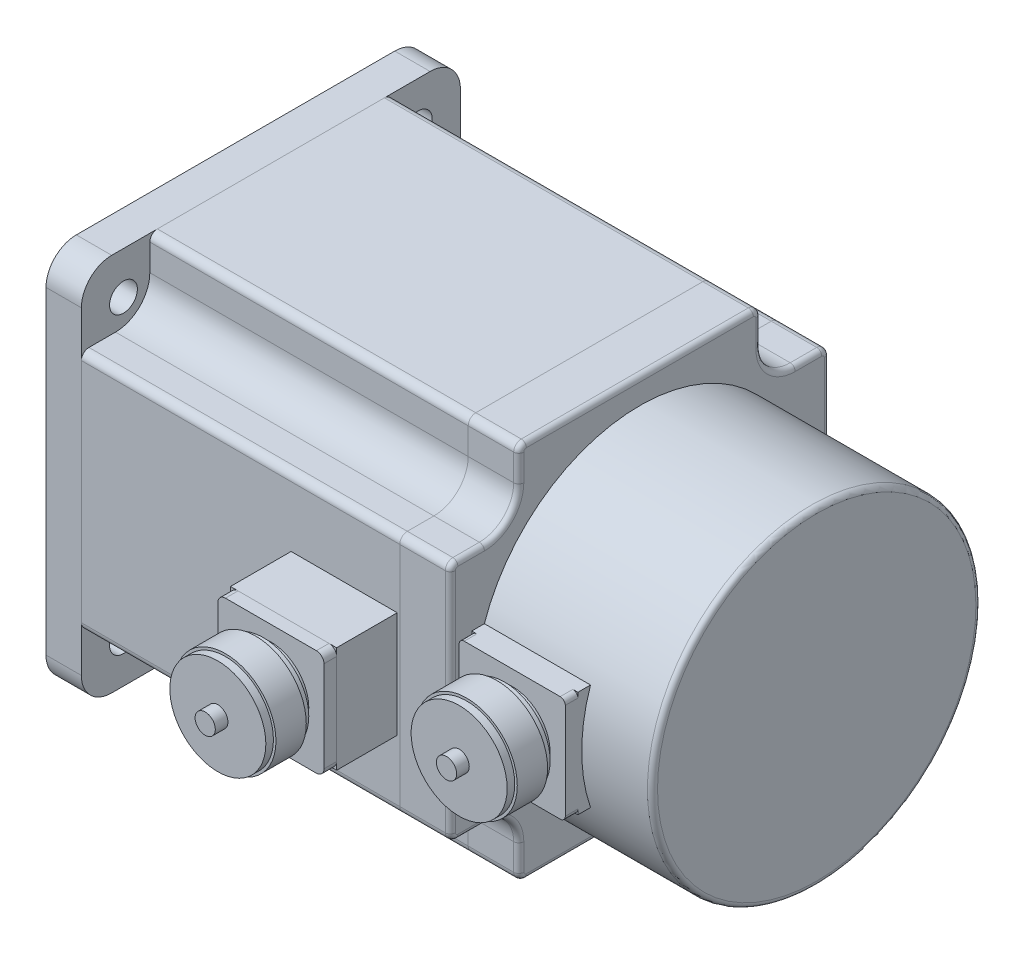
ISO-10303-21;
HEADER;
FILE_DESCRIPTION(('STEP AP214'),'2;1');
FILE_NAME('part.step','',(''),(''),'','','');
FILE_SCHEMA(('AUTOMOTIVE_DESIGN { 1 0 10303 214 1 1 1 1 }'));
ENDSEC;
DATA;
#1=APPLICATION_CONTEXT('core data for automotive mechanical design processes');
#2=APPLICATION_PROTOCOL_DEFINITION('international standard','automotive_design',2000,#1);
#3=PRODUCT_CONTEXT('',#1,'mechanical');
#4=PRODUCT('Part','Part','',(#3));
#5=PRODUCT_RELATED_PRODUCT_CATEGORY('part','',(#4));
#6=PRODUCT_DEFINITION_FORMATION('','',#4);
#7=PRODUCT_DEFINITION_CONTEXT('part definition',#1,'design');
#8=PRODUCT_DEFINITION('design','',#6,#7);
#9=PRODUCT_DEFINITION_SHAPE('','',#8);
#10=(LENGTH_UNIT() NAMED_UNIT(*) SI_UNIT(.MILLI.,.METRE.));
#11=(NAMED_UNIT(*) PLANE_ANGLE_UNIT() SI_UNIT($,.RADIAN.));
#12=(NAMED_UNIT(*) SI_UNIT($,.STERADIAN.) SOLID_ANGLE_UNIT());
#13=UNCERTAINTY_MEASURE_WITH_UNIT(LENGTH_MEASURE(1.E-05),#10,'distance_accuracy_value','');
#14=(GEOMETRIC_REPRESENTATION_CONTEXT(3) GLOBAL_UNCERTAINTY_ASSIGNED_CONTEXT((#13)) GLOBAL_UNIT_ASSIGNED_CONTEXT((#10,
#11,#12)) REPRESENTATION_CONTEXT('',''));
#15=CARTESIAN_POINT('',(0.,0.,0.));
#16=DIRECTION('',(0.,0.,1.));
#17=DIRECTION('',(1.,0.,0.));
#18=AXIS2_PLACEMENT_3D('',#15,#16,#17);
#19=CARTESIAN_POINT('',(-190.,-17.,0.));
#20=DIRECTION('',(0.,1.,0.));
#21=DIRECTION('',(0.,0.,1.));
#22=AXIS2_PLACEMENT_3D('',#19,#20,#21);
#23=CYLINDRICAL_SURFACE('',#22,3.99999999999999);
#24=CARTESIAN_POINT('',(-190.,-9.,0.));
#25=DIRECTION('',(0.,-1.,0.));
#26=DIRECTION('',(0.,0.,-1.));
#27=AXIS2_PLACEMENT_3D('',#24,#25,#26);
#28=CIRCLE('',#27,3.99999999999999);
#29=CARTESIAN_POINT('',(-190.,-9.,3.99999999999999));
#30=VERTEX_POINT('',#29);
#31=CARTESIAN_POINT('',(-190.,-9.,-3.99999999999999));
#32=VERTEX_POINT('',#31);
#33=EDGE_CURVE('E109',#30,#32,#28,.T.);
#34=ORIENTED_EDGE('',*,*,#33,.T.);
#35=DIRECTION('',(0.,1.,0.));
#36=VECTOR('',#35,1.);
#37=CARTESIAN_POINT('',(-190.,-17.,-3.99999999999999));
#38=LINE('',#37,#36);
#39=CARTESIAN_POINT('',(-190.,-17.,-3.99999999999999));
#40=VERTEX_POINT('',#39);
#41=EDGE_CURVE('E12',#40,#32,#38,.T.);
#42=ORIENTED_EDGE('',*,*,#41,.F.);
#43=CARTESIAN_POINT('',(-190.,-17.,0.));
#44=DIRECTION('',(0.,-1.,0.));
#45=DIRECTION('',(0.,0.,-1.));
#46=AXIS2_PLACEMENT_3D('',#43,#44,#45);
#47=CIRCLE('',#46,3.99999999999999);
#48=CARTESIAN_POINT('',(-190.,-17.,3.99999999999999));
#49=VERTEX_POINT('',#48);
#50=EDGE_CURVE('E97',#49,#40,#47,.T.);
#51=ORIENTED_EDGE('',*,*,#50,.F.);
#52=DIRECTION('',(0.,1.,0.));
#53=VECTOR('',#52,1.);
#54=CARTESIAN_POINT('',(-190.,-17.,3.99999999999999));
#55=LINE('',#54,#53);
#56=EDGE_CURVE('E105',#49,#30,#55,.T.);
#57=ORIENTED_EDGE('',*,*,#56,.T.);
#58=EDGE_LOOP('',(#34,#42,#51,#57));
#59=FACE_BOUND('',#58,.T.);
#60=ADVANCED_FACE('F46',(#59),#23,.T.);
#61=CARTESIAN_POINT('',(-153.,-17.,-3.99999999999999));
#62=DIRECTION('',(0.,0.,1.));
#63=DIRECTION('',(1.,0.,0.));
#64=AXIS2_PLACEMENT_3D('',#61,#62,#63);
#65=PLANE('',#64);
#66=DIRECTION('',(1.,0.,0.));
#67=VECTOR('',#66,1.);
#68=CARTESIAN_POINT('',(-153.,-9.,-3.99999999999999));
#69=LINE('',#68,#67);
#70=CARTESIAN_POINT('',(-153.,-9.,-3.99999999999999));
#71=VERTEX_POINT('',#70);
#72=EDGE_CURVE('E101',#32,#71,#69,.T.);
#73=ORIENTED_EDGE('',*,*,#72,.T.);
#74=DIRECTION('',(0.,1.,0.));
#75=VECTOR('',#74,1.);
#76=CARTESIAN_POINT('',(-153.,-17.,-3.99999999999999));
#77=LINE('',#76,#75);
#78=CARTESIAN_POINT('',(-153.,-17.,-3.99999999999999));
#79=VERTEX_POINT('',#78);
#80=EDGE_CURVE('E54',#79,#71,#77,.T.);
#81=ORIENTED_EDGE('',*,*,#80,.F.);
#82=DIRECTION('',(1.,0.,0.));
#83=VECTOR('',#82,1.);
#84=CARTESIAN_POINT('',(-153.,-17.,-3.99999999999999));
#85=LINE('',#84,#83);
#86=EDGE_CURVE('E92',#40,#79,#85,.T.);
#87=ORIENTED_EDGE('',*,*,#86,.F.);
#88=ORIENTED_EDGE('',*,*,#41,.T.);
#89=EDGE_LOOP('',(#73,#81,#87,#88));
#90=FACE_BOUND('',#89,.T.);
#91=ADVANCED_FACE('F100',(#90),#65,.F.);
#92=CARTESIAN_POINT('',(-153.,-17.,0.));
#93=DIRECTION('',(0.,1.,0.));
#94=DIRECTION('',(0.,0.,1.));
#95=AXIS2_PLACEMENT_3D('',#92,#93,#94);
#96=CYLINDRICAL_SURFACE('',#95,3.99999999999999);
#97=CARTESIAN_POINT('',(-153.,-9.,0.));
#98=DIRECTION('',(0.,-1.,0.));
#99=DIRECTION('',(0.,0.,-1.));
#100=AXIS2_PLACEMENT_3D('',#97,#98,#99);
#101=CIRCLE('',#100,3.99999999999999);
#102=CARTESIAN_POINT('',(-153.,-9.,3.99999999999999));
#103=VERTEX_POINT('',#102);
#104=EDGE_CURVE('E79',#71,#103,#101,.T.);
#105=ORIENTED_EDGE('',*,*,#104,.T.);
#106=DIRECTION('',(0.,1.,0.));
#107=VECTOR('',#106,1.);
#108=CARTESIAN_POINT('',(-153.,-17.,3.99999999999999));
#109=LINE('',#108,#107);
#110=CARTESIAN_POINT('',(-153.,-17.,3.99999999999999));
#111=VERTEX_POINT('',#110);
#112=EDGE_CURVE('E102',#111,#103,#109,.T.);
#113=ORIENTED_EDGE('',*,*,#112,.F.);
#114=CARTESIAN_POINT('',(-153.,-17.,0.));
#115=DIRECTION('',(0.,-1.,0.));
#116=DIRECTION('',(0.,0.,-1.));
#117=AXIS2_PLACEMENT_3D('',#114,#115,#116);
#118=CIRCLE('',#117,3.99999999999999);
#119=EDGE_CURVE('E95',#79,#111,#118,.T.);
#120=ORIENTED_EDGE('',*,*,#119,.F.);
#121=ORIENTED_EDGE('',*,*,#80,.T.);
#122=EDGE_LOOP('',(#105,#113,#120,#121));
#123=FACE_BOUND('',#122,.T.);
#124=ADVANCED_FACE('F103',(#123),#96,.T.);
#125=CARTESIAN_POINT('',(-190.,-17.,3.99999999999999));
#126=DIRECTION('',(0.,0.,-1.));
#127=DIRECTION('',(-1.,0.,0.));
#128=AXIS2_PLACEMENT_3D('',#125,#126,#127);
#129=PLANE('',#128);
#130=DIRECTION('',(-1.,0.,0.));
#131=VECTOR('',#130,1.);
#132=CARTESIAN_POINT('',(-190.,-9.,3.99999999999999));
#133=LINE('',#132,#131);
#134=EDGE_CURVE('E85',#103,#30,#133,.T.);
#135=ORIENTED_EDGE('',*,*,#134,.T.);
#136=ORIENTED_EDGE('',*,*,#56,.F.);
#137=DIRECTION('',(-1.,0.,0.));
#138=VECTOR('',#137,1.);
#139=CARTESIAN_POINT('',(-190.,-17.,3.99999999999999));
#140=LINE('',#139,#138);
#141=EDGE_CURVE('E62',#111,#49,#140,.T.);
#142=ORIENTED_EDGE('',*,*,#141,.F.);
#143=ORIENTED_EDGE('',*,*,#112,.T.);
#144=EDGE_LOOP('',(#135,#136,#142,#143));
#145=FACE_BOUND('',#144,.T.);
#146=ADVANCED_FACE('F116',(#145),#129,.F.);
#147=CARTESIAN_POINT('',(-190.,-17.,0.));
#148=DIRECTION('',(0.,-1.,0.));
#149=DIRECTION('',(0.,0.,-1.));
#150=AXIS2_PLACEMENT_3D('',#147,#148,#149);
#151=PLANE('',#150);
#152=ORIENTED_EDGE('',*,*,#50,.T.);
#153=ORIENTED_EDGE('',*,*,#86,.T.);
#154=ORIENTED_EDGE('',*,*,#119,.T.);
#155=ORIENTED_EDGE('',*,*,#141,.T.);
#156=EDGE_LOOP('',(#152,#153,#154,#155));
#157=FACE_BOUND('',#156,.T.);
#158=ADVANCED_FACE('F93',(#157),#151,.T.);
#159=CARTESIAN_POINT('',(-190.,-9.,0.));
#160=DIRECTION('',(0.,-1.,0.));
#161=DIRECTION('',(0.,0.,-1.));
#162=AXIS2_PLACEMENT_3D('',#159,#160,#161);
#163=PLANE('',#162);
#164=ORIENTED_EDGE('',*,*,#33,.F.);
#165=ORIENTED_EDGE('',*,*,#134,.F.);
#166=ORIENTED_EDGE('',*,*,#104,.F.);
#167=ORIENTED_EDGE('',*,*,#72,.F.);
#168=EDGE_LOOP('',(#164,#165,#166,#167));
#169=FACE_BOUND('',#168,.T.);
#170=ADVANCED_FACE('F119',(#169),#163,.F.);
#171=CLOSED_SHELL('',(#60,#91,#124,#146,#158,#170));
#172=MANIFOLD_SOLID_BREP('B2',#171);
#173=CARTESIAN_POINT('',(-198.,0.,0.));
#174=DIRECTION('',(1.,0.,0.));
#175=DIRECTION('',(0.,0.,-1.));
#176=AXIS2_PLACEMENT_3D('',#173,#174,#175);
#177=CYLINDRICAL_SURFACE('',#176,14.);
#178=CARTESIAN_POINT('',(-197.5,0.,0.));
#179=DIRECTION('',(-1.,0.,0.));
#180=DIRECTION('',(0.,0.,1.));
#181=AXIS2_PLACEMENT_3D('',#178,#179,#180);
#182=CIRCLE('',#181,14.);
#183=CARTESIAN_POINT('',(-197.5,0.,14.));
#184=VERTEX_POINT('',#183);
#185=EDGE_CURVE('E255',#184,#184,#182,.F.);
#186=ORIENTED_EDGE('',*,*,#185,.T.);
#187=EDGE_LOOP('',(#186));
#188=FACE_BOUND('',#187,.T.);
#189=CARTESIAN_POINT('',(-145.5,0.,0.));
#190=DIRECTION('',(-1.,0.,0.));
#191=DIRECTION('',(0.,0.,1.));
#192=AXIS2_PLACEMENT_3D('',#189,#190,#191);
#193=CIRCLE('',#192,14.);
#194=CARTESIAN_POINT('',(-145.5,0.,14.));
#195=VERTEX_POINT('',#194);
#196=EDGE_CURVE('E237',#195,#195,#193,.T.);
#197=ORIENTED_EDGE('',*,*,#196,.T.);
#198=EDGE_LOOP('',(#197));
#199=FACE_BOUND('',#198,.T.);
#200=CARTESIAN_POINT('',(-153.,-13.4164078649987,-3.99999999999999));
#201=CARTESIAN_POINT('',(-152.889963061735,-13.4163934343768,-4.00001343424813));
#202=CARTESIAN_POINT('',(-152.779934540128,-13.417761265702,-3.99545969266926));
#203=CARTESIAN_POINT('',(-152.560712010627,-13.4231542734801,-3.97732232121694));
#204=CARTESIAN_POINT('',(-152.451517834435,-13.4271788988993,-3.96374056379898));
#205=CARTESIAN_POINT('',(-152.234991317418,-13.4377658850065,-3.9276941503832));
#206=CARTESIAN_POINT('',(-152.127655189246,-13.4443222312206,-3.90525054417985));
#207=CARTESIAN_POINT('',(-151.915366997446,-13.4597622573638,-3.85169716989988));
#208=CARTESIAN_POINT('',(-151.810414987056,-13.4686459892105,-3.82058720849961));
#209=CARTESIAN_POINT('',(-151.500282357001,-13.4984072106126,-3.71462722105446));
#210=CARTESIAN_POINT('',(-151.299567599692,-13.5224082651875,-3.62710377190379));
#211=CARTESIAN_POINT('',(-150.915683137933,-13.5760110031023,-3.4209933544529));
#212=CARTESIAN_POINT('',(-150.732520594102,-13.6056149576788,-3.30239378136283));
#213=CARTESIAN_POINT('',(-150.383630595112,-13.6680345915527,-3.03385514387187));
#214=CARTESIAN_POINT('',(-150.21847497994,-13.7009134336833,-2.88318637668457));
#215=CARTESIAN_POINT('',(-149.91539864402,-13.7656378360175,-2.55635049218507));
#216=CARTESIAN_POINT('',(-149.777482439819,-13.7974832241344,-2.38017915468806));
#217=CARTESIAN_POINT('',(-149.53034061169,-13.8572672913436,-2.00328797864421));
#218=CARTESIAN_POINT('',(-149.42169609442,-13.885122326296,-1.80217262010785));
#219=CARTESIAN_POINT('',(-149.239992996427,-13.9330517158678,-1.38360719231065));
#220=CARTESIAN_POINT('',(-149.166925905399,-13.9531279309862,-1.16616104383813));
#221=CARTESIAN_POINT('',(-149.060331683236,-13.9827902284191,-0.727119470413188));
#222=CARTESIAN_POINT('',(-149.025822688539,-13.9926363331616,-0.505780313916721));
#223=CARTESIAN_POINT('',(-148.994226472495,-14.0016419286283,-0.0602449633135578));
#224=CARTESIAN_POINT('',(-148.997132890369,-14.0008032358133,0.163950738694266));
#225=CARTESIAN_POINT('',(-149.039612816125,-13.9887201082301,0.601961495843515));
#226=CARTESIAN_POINT('',(-149.078123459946,-13.9777773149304,0.815889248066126));
#227=CARTESIAN_POINT('',(-149.188991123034,-13.9470775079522,1.2341066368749));
#228=CARTESIAN_POINT('',(-149.261349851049,-13.9273200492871,1.43839578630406));
#229=CARTESIAN_POINT('',(-149.438618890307,-13.8807804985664,1.83414901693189));
#230=CARTESIAN_POINT('',(-149.543876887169,-13.853923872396,2.02544821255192));
#231=CARTESIAN_POINT('',(-149.783693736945,-13.7960546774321,2.38801825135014));
#232=CARTESIAN_POINT('',(-149.918258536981,-13.7650412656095,2.55928501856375));
#233=CARTESIAN_POINT('',(-150.218386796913,-13.7009177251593,2.88324485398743));
#234=CARTESIAN_POINT('',(-150.384870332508,-13.6677722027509,3.03507809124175));
#235=CARTESIAN_POINT('',(-150.741426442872,-13.6040627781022,3.30897556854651));
#236=CARTESIAN_POINT('',(-150.931505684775,-13.573499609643,3.43103136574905));
#237=CARTESIAN_POINT('',(-151.231158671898,-13.5321405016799,3.58945338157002));
#238=CARTESIAN_POINT('',(-151.333989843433,-13.5190503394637,3.63832313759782));
#239=CARTESIAN_POINT('',(-151.543626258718,-13.4948216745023,3.72718558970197));
#240=CARTESIAN_POINT('',(-151.650429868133,-13.4836823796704,3.76718189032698));
#241=CARTESIAN_POINT('',(-151.867138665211,-13.463719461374,3.83791732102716));
#242=CARTESIAN_POINT('',(-151.977040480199,-13.4548934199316,3.86866612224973));
#243=CARTESIAN_POINT('',(-152.199195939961,-13.4398293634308,3.92067829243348));
#244=CARTESIAN_POINT('',(-152.311448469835,-13.4335901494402,3.94194605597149));
#245=CARTESIAN_POINT('',(-152.519732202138,-13.4246640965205,3.97223001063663));
#246=CARTESIAN_POINT('',(-152.615545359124,-13.4215735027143,3.98264484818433));
#247=CARTESIAN_POINT('',(-152.807569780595,-13.4174428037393,3.99652828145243));
#248=CARTESIAN_POINT('',(-152.903780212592,-13.4163995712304,4.0000074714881));
#249=CARTESIAN_POINT('',(-153.,-13.4164078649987,3.99999999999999));
#250=B_SPLINE_CURVE_WITH_KNOTS('',3,(#200,#201,#202,#203,#204,#205,#206,#207,#208,#209,#210,
#211,#212,#213,#214,#215,#216,#217,#218,#219,#220,#221,#222,#223,#224,#225,#226,#227,#228,#229,
#230,#231,#232,#233,#234,#235,#236,#237,#238,#239,#240,#241,#242,#243,#244,#245,#246,#247,#248,
#249),.UNSPECIFIED.,.F.,.F.,(4,2,2,2,2,2,2,2,2,2,2,2,2,2,2,2,2,2,2,2,2,2,2,2,4),(0.,
0.329993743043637,0.65991906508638,0.98906537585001,1.31821902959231,1.97575167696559,
2.6335514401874,3.30832474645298,3.98320984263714,4.67064278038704,5.35791119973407,
6.02724874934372,6.6964725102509,7.34634193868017,7.99624417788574,8.65326120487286,
9.31041168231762,9.99056134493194,10.6709036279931,11.0143588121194,11.357674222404,
11.700629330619,12.0434253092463,12.3324405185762,12.6210139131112),.UNSPECIFIED.);
#251=CARTESIAN_POINT('',(-153.,-13.4164078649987,-3.99999999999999));
#252=VERTEX_POINT('',#251);
#253=CARTESIAN_POINT('',(-153.,-13.4164078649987,3.99999999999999));
#254=VERTEX_POINT('',#253);
#255=EDGE_CURVE('E258',#252,#254,#250,.T.);
#256=ORIENTED_EDGE('',*,*,#255,.F.);
#257=DIRECTION('',(1.,0.,0.));
#258=VECTOR('',#257,1.);
#259=CARTESIAN_POINT('',(-198.,-13.4164078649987,-3.99999999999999));
#260=LINE('',#259,#258);
#261=CARTESIAN_POINT('',(-190.,-13.4164078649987,-3.99999999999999));
#262=VERTEX_POINT('',#261);
#263=EDGE_CURVE('E44',#262,#252,#260,.T.);
#264=ORIENTED_EDGE('',*,*,#263,.F.);
#265=CARTESIAN_POINT('',(-190.,-13.4164078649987,3.99999999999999));
#266=CARTESIAN_POINT('',(-190.110036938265,-13.4163934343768,4.00001343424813));
#267=CARTESIAN_POINT('',(-190.220065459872,-13.417761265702,3.99545969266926));
#268=CARTESIAN_POINT('',(-190.439287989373,-13.4231542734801,3.97732232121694));
#269=CARTESIAN_POINT('',(-190.548482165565,-13.4271788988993,3.96374056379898));
#270=CARTESIAN_POINT('',(-190.765008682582,-13.4377658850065,3.92769415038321));
#271=CARTESIAN_POINT('',(-190.872344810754,-13.4443222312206,3.90525054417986));
#272=CARTESIAN_POINT('',(-191.084633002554,-13.4597622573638,3.85169716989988));
#273=CARTESIAN_POINT('',(-191.189585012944,-13.4686459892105,3.82058720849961));
#274=CARTESIAN_POINT('',(-191.499717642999,-13.4984072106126,3.71462722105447));
#275=CARTESIAN_POINT('',(-191.700432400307,-13.5224082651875,3.62710377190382));
#276=CARTESIAN_POINT('',(-192.084316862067,-13.5760110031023,3.42099335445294));
#277=CARTESIAN_POINT('',(-192.267479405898,-13.6056149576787,3.30239378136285));
#278=CARTESIAN_POINT('',(-192.616369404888,-13.6680345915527,3.03385514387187));
#279=CARTESIAN_POINT('',(-192.78152502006,-13.7009134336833,2.88318637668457));
#280=CARTESIAN_POINT('',(-193.08460135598,-13.7656378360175,2.55635049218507));
#281=CARTESIAN_POINT('',(-193.222517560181,-13.7974832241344,2.38017915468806));
#282=CARTESIAN_POINT('',(-193.46965938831,-13.8572672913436,2.00328797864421));
#283=CARTESIAN_POINT('',(-193.57830390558,-13.885122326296,1.80217262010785));
#284=CARTESIAN_POINT('',(-193.760007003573,-13.9330517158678,1.38360719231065));
#285=CARTESIAN_POINT('',(-193.833074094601,-13.9531279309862,1.16616104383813));
#286=CARTESIAN_POINT('',(-193.939668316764,-13.9827902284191,0.727119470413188));
#287=CARTESIAN_POINT('',(-193.974177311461,-13.9926363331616,0.505780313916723));
#288=CARTESIAN_POINT('',(-194.005773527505,-14.0016419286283,0.0602449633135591));
#289=CARTESIAN_POINT('',(-194.002867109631,-14.0008032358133,-0.163950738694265));
#290=CARTESIAN_POINT('',(-193.960387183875,-13.9887201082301,-0.601961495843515));
#291=CARTESIAN_POINT('',(-193.921876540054,-13.9777773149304,-0.815889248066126));
#292=CARTESIAN_POINT('',(-193.811008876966,-13.9470775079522,-1.2341066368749));
#293=CARTESIAN_POINT('',(-193.738650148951,-13.9273200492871,-1.43839578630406));
#294=CARTESIAN_POINT('',(-193.561381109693,-13.8807804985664,-1.83414901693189));
#295=CARTESIAN_POINT('',(-193.456123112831,-13.853923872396,-2.02544821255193));
#296=CARTESIAN_POINT('',(-193.216306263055,-13.7960546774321,-2.38801825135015));
#297=CARTESIAN_POINT('',(-193.081741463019,-13.7650412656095,-2.55928501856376));
#298=CARTESIAN_POINT('',(-192.781613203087,-13.7009177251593,-2.88324485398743));
#299=CARTESIAN_POINT('',(-192.615129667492,-13.6677722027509,-3.03507809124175));
#300=CARTESIAN_POINT('',(-192.258573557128,-13.6040627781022,-3.30897556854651));
#301=CARTESIAN_POINT('',(-192.068494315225,-13.573499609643,-3.43103136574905));
#302=CARTESIAN_POINT('',(-191.768841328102,-13.5321405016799,-3.58945338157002));
#303=CARTESIAN_POINT('',(-191.666010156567,-13.5190503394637,-3.63832313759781));
#304=CARTESIAN_POINT('',(-191.456373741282,-13.4948216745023,-3.72718558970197));
#305=CARTESIAN_POINT('',(-191.349570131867,-13.4836823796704,-3.76718189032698));
#306=CARTESIAN_POINT('',(-191.132861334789,-13.463719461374,-3.83791732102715));
#307=CARTESIAN_POINT('',(-191.022959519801,-13.4548934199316,-3.86866612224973));
#308=CARTESIAN_POINT('',(-190.800804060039,-13.4398293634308,-3.92067829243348));
#309=CARTESIAN_POINT('',(-190.688551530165,-13.4335901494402,-3.94194605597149));
#310=CARTESIAN_POINT('',(-190.480267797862,-13.4246640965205,-3.97223001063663));
#311=CARTESIAN_POINT('',(-190.384454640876,-13.4215735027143,-3.98264484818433));
#312=CARTESIAN_POINT('',(-190.192430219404,-13.4174428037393,-3.99652828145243));
#313=CARTESIAN_POINT('',(-190.096219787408,-13.4163995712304,-4.0000074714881));
#314=CARTESIAN_POINT('',(-190.,-13.4164078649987,-3.99999999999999));
#315=B_SPLINE_CURVE_WITH_KNOTS('',3,(#265,#266,#267,#268,#269,#270,#271,#272,#273,#274,#275,
#276,#277,#278,#279,#280,#281,#282,#283,#284,#285,#286,#287,#288,#289,#290,#291,#292,#293,#294,
#295,#296,#297,#298,#299,#300,#301,#302,#303,#304,#305,#306,#307,#308,#309,#310,#311,#312,#313,
#314),.UNSPECIFIED.,.F.,.F.,(4,2,2,2,2,2,2,2,2,2,2,2,2,2,2,2,2,2,2,2,2,2,2,2,4),(0.,
0.329993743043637,0.659919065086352,0.98906537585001,1.31821902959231,1.97575167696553,
2.6335514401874,3.30832474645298,3.98320984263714,4.67064278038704,5.35791119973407,
6.02724874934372,6.69647251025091,7.34634193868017,7.99624417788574,8.65326120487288,
9.31041168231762,9.99056134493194,10.6709036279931,11.0143588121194,11.357674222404,
11.700629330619,12.0434253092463,12.3324405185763,12.6210139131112),.UNSPECIFIED.);
#316=CARTESIAN_POINT('',(-190.,-13.4164078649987,3.99999999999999));
#317=VERTEX_POINT('',#316);
#318=EDGE_CURVE('E186',#317,#262,#315,.T.);
#319=ORIENTED_EDGE('',*,*,#318,.F.);
#320=DIRECTION('',(1.,0.,0.));
#321=VECTOR('',#320,1.);
#322=CARTESIAN_POINT('',(-198.,-13.4164078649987,3.99999999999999));
#323=LINE('',#322,#321);
#324=EDGE_CURVE('E236',#254,#317,#323,.F.);
#325=ORIENTED_EDGE('',*,*,#324,.F.);
#326=EDGE_LOOP('',(#256,#264,#319,#325));
#327=FACE_BOUND('',#326,.T.);
#328=ADVANCED_FACE('F178',(#188,#199,#327),#177,.T.);
#329=CARTESIAN_POINT('',(-145.5,0.,0.));
#330=DIRECTION('',(-1.,0.,0.));
#331=DIRECTION('',(0.,0.,1.));
#332=AXIS2_PLACEMENT_3D('',#329,#330,#331);
#333=PLANE('',#332);
#334=CARTESIAN_POINT('',(-145.5,0.,0.));
#335=DIRECTION('',(-1.,0.,0.));
#336=DIRECTION('',(0.,0.,1.));
#337=AXIS2_PLACEMENT_3D('',#334,#335,#336);
#338=CIRCLE('',#337,17.);
#339=CARTESIAN_POINT('',(-145.5,0.,17.));
#340=VERTEX_POINT('',#339);
#341=EDGE_CURVE('E249',#340,#340,#338,.T.);
#342=ORIENTED_EDGE('',*,*,#341,.T.);
#343=EDGE_LOOP('',(#342));
#344=FACE_BOUND('',#343,.T.);
#345=ORIENTED_EDGE('',*,*,#196,.F.);
#346=EDGE_LOOP('',(#345));
#347=FACE_BOUND('',#346,.T.);
#348=ADVANCED_FACE('F295',(#344,#347),#333,.T.);
#349=CARTESIAN_POINT('',(-145.,0.,0.));
#350=DIRECTION('',(-1.,0.,0.));
#351=DIRECTION('',(0.,0.,1.));
#352=AXIS2_PLACEMENT_3D('',#349,#350,#351);
#353=PLANE('',#352);
#354=CARTESIAN_POINT('',(-145.,0.,0.));
#355=DIRECTION('',(-1.,0.,0.));
#356=DIRECTION('',(0.,0.,1.));
#357=AXIS2_PLACEMENT_3D('',#354,#355,#356);
#358=CIRCLE('',#357,17.5);
#359=CARTESIAN_POINT('',(-145.,0.,17.5));
#360=VERTEX_POINT('',#359);
#361=EDGE_CURVE('E241',#360,#360,#358,.T.);
#362=ORIENTED_EDGE('',*,*,#361,.F.);
#363=EDGE_LOOP('',(#362));
#364=FACE_BOUND('',#363,.T.);
#365=ADVANCED_FACE('F300',(#364),#353,.F.);
#366=CARTESIAN_POINT('',(-145.,0.,0.));
#367=DIRECTION('',(-1.,0.,0.));
#368=DIRECTION('',(0.,0.,1.));
#369=AXIS2_PLACEMENT_3D('',#366,#367,#368);
#370=TOROIDAL_SURFACE('',#369,17.,0.5);
#371=ORIENTED_EDGE('',*,*,#361,.T.);
#372=EDGE_LOOP('',(#371));
#373=FACE_BOUND('',#372,.T.);
#374=ORIENTED_EDGE('',*,*,#341,.F.);
#375=EDGE_LOOP('',(#374));
#376=FACE_BOUND('',#375,.T.);
#377=ADVANCED_FACE('F312',(#373,#376),#370,.T.);
#378=CARTESIAN_POINT('',(-198.,0.,0.));
#379=DIRECTION('',(-1.,0.,0.));
#380=DIRECTION('',(0.,0.,1.));
#381=AXIS2_PLACEMENT_3D('',#378,#379,#380);
#382=PLANE('',#381);
#383=CARTESIAN_POINT('',(-198.,0.,0.));
#384=DIRECTION('',(-1.,0.,0.));
#385=DIRECTION('',(0.,0.,1.));
#386=AXIS2_PLACEMENT_3D('',#383,#384,#385);
#387=CIRCLE('',#386,13.5);
#388=CARTESIAN_POINT('',(-198.,0.,13.5));
#389=VERTEX_POINT('',#388);
#390=EDGE_CURVE('E252',#389,#389,#387,.T.);
#391=ORIENTED_EDGE('',*,*,#390,.T.);
#392=EDGE_LOOP('',(#391));
#393=FACE_BOUND('',#392,.T.);
#394=ADVANCED_FACE('F280',(#393),#382,.T.);
#395=CARTESIAN_POINT('',(-198.,0.,0.));
#396=DIRECTION('',(1.,0.,0.));
#397=DIRECTION('',(0.,0.,-1.));
#398=AXIS2_PLACEMENT_3D('',#395,#396,#397);
#399=CONICAL_SURFACE('',#398,13.5,0.785398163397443);
#400=ORIENTED_EDGE('',*,*,#185,.F.);
#401=EDGE_LOOP('',(#400));
#402=FACE_BOUND('',#401,.T.);
#403=ORIENTED_EDGE('',*,*,#390,.F.);
#404=EDGE_LOOP('',(#403));
#405=FACE_BOUND('',#404,.T.);
#406=ADVANCED_FACE('F180',(#402,#405),#399,.T.);
#407=CARTESIAN_POINT('',(-190.,-9.,0.));
#408=DIRECTION('',(0.,-1.,0.));
#409=DIRECTION('',(0.,0.,-1.));
#410=AXIS2_PLACEMENT_3D('',#407,#408,#409);
#411=CYLINDRICAL_SURFACE('',#410,3.99999999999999);
#412=DIRECTION('',(0.,-1.,0.));
#413=VECTOR('',#412,1.);
#414=CARTESIAN_POINT('',(-190.,-9.,3.99999999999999));
#415=LINE('',#414,#413);
#416=CARTESIAN_POINT('',(-190.,-9.,3.99999999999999));
#417=VERTEX_POINT('',#416);
#418=EDGE_CURVE('E233',#417,#317,#415,.T.);
#419=ORIENTED_EDGE('',*,*,#418,.T.);
#420=ORIENTED_EDGE('',*,*,#318,.T.);
#421=DIRECTION('',(0.,-1.,0.));
#422=VECTOR('',#421,1.);
#423=CARTESIAN_POINT('',(-190.,-9.,-3.99999999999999));
#424=LINE('',#423,#422);
#425=CARTESIAN_POINT('',(-190.,-9.,-3.99999999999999));
#426=VERTEX_POINT('',#425);
#427=EDGE_CURVE('E192',#426,#262,#424,.T.);
#428=ORIENTED_EDGE('',*,*,#427,.F.);
#429=CARTESIAN_POINT('',(-190.,-9.,0.));
#430=DIRECTION('',(0.,1.,0.));
#431=DIRECTION('',(0.,0.,1.));
#432=AXIS2_PLACEMENT_3D('',#429,#430,#431);
#433=CIRCLE('',#432,3.99999999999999);
#434=EDGE_CURVE('E223',#426,#417,#433,.T.);
#435=ORIENTED_EDGE('',*,*,#434,.T.);
#436=EDGE_LOOP('',(#419,#420,#428,#435));
#437=FACE_BOUND('',#436,.T.);
#438=ADVANCED_FACE('F232',(#437),#411,.F.);
#439=CARTESIAN_POINT('',(-190.,-9.,3.99999999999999));
#440=DIRECTION('',(0.,0.,-1.));
#441=DIRECTION('',(-1.,0.,0.));
#442=AXIS2_PLACEMENT_3D('',#439,#440,#441);
#443=PLANE('',#442);
#444=ORIENTED_EDGE('',*,*,#324,.T.);
#445=ORIENTED_EDGE('',*,*,#418,.F.);
#446=DIRECTION('',(1.,0.,0.));
#447=VECTOR('',#446,1.);
#448=CARTESIAN_POINT('',(-190.,-9.,3.99999999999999));
#449=LINE('',#448,#447);
#450=CARTESIAN_POINT('',(-153.,-9.,3.99999999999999));
#451=VERTEX_POINT('',#450);
#452=EDGE_CURVE('E219',#417,#451,#449,.T.);
#453=ORIENTED_EDGE('',*,*,#452,.T.);
#454=DIRECTION('',(0.,-1.,0.));
#455=VECTOR('',#454,1.);
#456=CARTESIAN_POINT('',(-153.,-9.,3.99999999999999));
#457=LINE('',#456,#455);
#458=EDGE_CURVE('E238',#451,#254,#457,.T.);
#459=ORIENTED_EDGE('',*,*,#458,.T.);
#460=EDGE_LOOP('',(#444,#445,#453,#459));
#461=FACE_BOUND('',#460,.T.);
#462=ADVANCED_FACE('F235',(#461),#443,.T.);
#463=CARTESIAN_POINT('',(-153.,-9.,0.));
#464=DIRECTION('',(0.,-1.,0.));
#465=DIRECTION('',(0.,0.,-1.));
#466=AXIS2_PLACEMENT_3D('',#463,#464,#465);
#467=CYLINDRICAL_SURFACE('',#466,3.99999999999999);
#468=DIRECTION('',(0.,-1.,0.));
#469=VECTOR('',#468,1.);
#470=CARTESIAN_POINT('',(-153.,-9.,-3.99999999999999));
#471=LINE('',#470,#469);
#472=CARTESIAN_POINT('',(-153.,-9.,-3.99999999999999));
#473=VERTEX_POINT('',#472);
#474=EDGE_CURVE('E243',#473,#252,#471,.T.);
#475=ORIENTED_EDGE('',*,*,#474,.T.);
#476=ORIENTED_EDGE('',*,*,#255,.T.);
#477=ORIENTED_EDGE('',*,*,#458,.F.);
#478=CARTESIAN_POINT('',(-153.,-9.,0.));
#479=DIRECTION('',(0.,1.,0.));
#480=DIRECTION('',(0.,0.,1.));
#481=AXIS2_PLACEMENT_3D('',#478,#479,#480);
#482=CIRCLE('',#481,3.99999999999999);
#483=EDGE_CURVE('E224',#451,#473,#482,.T.);
#484=ORIENTED_EDGE('',*,*,#483,.T.);
#485=EDGE_LOOP('',(#475,#476,#477,#484));
#486=FACE_BOUND('',#485,.T.);
#487=ADVANCED_FACE('F268',(#486),#467,.F.);
#488=CARTESIAN_POINT('',(-153.,-9.,-3.99999999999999));
#489=DIRECTION('',(0.,0.,1.));
#490=DIRECTION('',(1.,0.,0.));
#491=AXIS2_PLACEMENT_3D('',#488,#489,#490);
#492=PLANE('',#491);
#493=ORIENTED_EDGE('',*,*,#263,.T.);
#494=ORIENTED_EDGE('',*,*,#474,.F.);
#495=DIRECTION('',(-1.,0.,0.));
#496=VECTOR('',#495,1.);
#497=CARTESIAN_POINT('',(-153.,-9.,-3.99999999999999));
#498=LINE('',#497,#496);
#499=EDGE_CURVE('E286',#473,#426,#498,.T.);
#500=ORIENTED_EDGE('',*,*,#499,.T.);
#501=ORIENTED_EDGE('',*,*,#427,.T.);
#502=EDGE_LOOP('',(#493,#494,#500,#501));
#503=FACE_BOUND('',#502,.T.);
#504=ADVANCED_FACE('F273',(#503),#492,.T.);
#505=CARTESIAN_POINT('',(-190.,-9.,0.));
#506=DIRECTION('',(0.,1.,0.));
#507=DIRECTION('',(0.,0.,1.));
#508=AXIS2_PLACEMENT_3D('',#505,#506,#507);
#509=PLANE('',#508);
#510=ORIENTED_EDGE('',*,*,#434,.F.);
#511=ORIENTED_EDGE('',*,*,#499,.F.);
#512=ORIENTED_EDGE('',*,*,#483,.F.);
#513=ORIENTED_EDGE('',*,*,#452,.F.);
#514=EDGE_LOOP('',(#510,#511,#512,#513));
#515=FACE_BOUND('',#514,.T.);
#516=ADVANCED_FACE('F221',(#515),#509,.F.);
#517=CLOSED_SHELL('',(#328,#348,#365,#377,#394,#406,#438,#462,#487,#504,#516));
#518=MANIFOLD_SOLID_BREP('B6',#517);
#519=CARTESIAN_POINT('',(-22.,0.,125.));
#520=DIRECTION('',(0.,0.,1.));
#521=DIRECTION('',(1.,0.,0.));
#522=AXIS2_PLACEMENT_3D('',#519,#520,#521);
#523=PLANE('',#522);
#524=CARTESIAN_POINT('',(-22.,0.,125.));
#525=DIRECTION('',(0.,0.,1.));
#526=DIRECTION('',(1.,0.,0.));
#527=AXIS2_PLACEMENT_3D('',#524,#525,#526);
#528=CIRCLE('',#527,19.);
#529=CARTESIAN_POINT('',(-3.,0.,125.));
#530=VERTEX_POINT('',#529);
#531=EDGE_CURVE('E406',#530,#530,#528,.T.);
#532=ORIENTED_EDGE('',*,*,#531,.T.);
#533=EDGE_LOOP('',(#532));
#534=FACE_BOUND('',#533,.T.);
#535=CARTESIAN_POINT('',(-22.,0.,125.));
#536=DIRECTION('',(0.,0.,1.));
#537=DIRECTION('',(1.,0.,0.));
#538=AXIS2_PLACEMENT_3D('',#535,#536,#537);
#539=CIRCLE('',#538,4.);
#540=CARTESIAN_POINT('',(-18.,0.,125.));
#541=VERTEX_POINT('',#540);
#542=EDGE_CURVE('E414',#541,#541,#539,.T.);
#543=ORIENTED_EDGE('',*,*,#542,.F.);
#544=EDGE_LOOP('',(#543));
#545=FACE_BOUND('',#544,.T.);
#546=ADVANCED_FACE('F395',(#534,#545),#523,.T.);
#547=CARTESIAN_POINT('',(-22.,0.,122.));
#548=DIRECTION('',(0.,0.,1.));
#549=DIRECTION('',(1.,0.,0.));
#550=AXIS2_PLACEMENT_3D('',#547,#548,#549);
#551=PLANE('',#550);
#552=CARTESIAN_POINT('',(-22.,0.,122.));
#553=DIRECTION('',(0.,0.,1.));
#554=DIRECTION('',(1.,0.,0.));
#555=AXIS2_PLACEMENT_3D('',#552,#553,#554);
#556=CIRCLE('',#555,20.);
#557=CARTESIAN_POINT('',(-2.,0.,122.));
#558=VERTEX_POINT('',#557);
#559=EDGE_CURVE('E177',#558,#558,#556,.T.);
#560=ORIENTED_EDGE('',*,*,#559,.T.);
#561=EDGE_LOOP('',(#560));
#562=FACE_BOUND('',#561,.T.);
#563=CARTESIAN_POINT('',(-22.,0.,122.));
#564=DIRECTION('',(0.,0.,1.));
#565=DIRECTION('',(1.,0.,0.));
#566=AXIS2_PLACEMENT_3D('',#563,#564,#565);
#567=CIRCLE('',#566,19.);
#568=CARTESIAN_POINT('',(-3.,0.,122.));
#569=VERTEX_POINT('',#568);
#570=EDGE_CURVE('E408',#569,#569,#567,.T.);
#571=ORIENTED_EDGE('',*,*,#570,.F.);
#572=EDGE_LOOP('',(#571));
#573=FACE_BOUND('',#572,.T.);
#574=ADVANCED_FACE('F430',(#562,#573),#551,.T.);
#575=CARTESIAN_POINT('',(-22.,0.,122.));
#576=DIRECTION('',(0.,0.,-1.));
#577=DIRECTION('',(-1.,0.,0.));
#578=AXIS2_PLACEMENT_3D('',#575,#576,#577);
#579=CYLINDRICAL_SURFACE('',#578,20.);
#580=ORIENTED_EDGE('',*,*,#559,.F.);
#581=EDGE_LOOP('',(#580));
#582=FACE_BOUND('',#581,.T.);
#583=CARTESIAN_POINT('',(-22.,0.,110.));
#584=DIRECTION('',(0.,0.,1.));
#585=DIRECTION('',(1.,0.,0.));
#586=AXIS2_PLACEMENT_3D('',#583,#584,#585);
#587=CIRCLE('',#586,20.);
#588=CARTESIAN_POINT('',(-2.,0.,110.));
#589=VERTEX_POINT('',#588);
#590=EDGE_CURVE('E399',#589,#589,#587,.T.);
#591=ORIENTED_EDGE('',*,*,#590,.T.);
#592=EDGE_LOOP('',(#591));
#593=FACE_BOUND('',#592,.T.);
#594=ADVANCED_FACE('F397',(#582,#593),#579,.T.);
#595=CARTESIAN_POINT('',(-22.,0.,110.));
#596=DIRECTION('',(0.,0.,1.));
#597=DIRECTION('',(1.,0.,0.));
#598=AXIS2_PLACEMENT_3D('',#595,#596,#597);
#599=PLANE('',#598);
#600=ORIENTED_EDGE('',*,*,#590,.F.);
#601=EDGE_LOOP('',(#600));
#602=FACE_BOUND('',#601,.T.);
#603=ADVANCED_FACE('F440',(#602),#599,.F.);
#604=CARTESIAN_POINT('',(-22.,0.,125.));
#605=DIRECTION('',(0.,0.,-1.));
#606=DIRECTION('',(-1.,0.,0.));
#607=AXIS2_PLACEMENT_3D('',#604,#605,#606);
#608=CYLINDRICAL_SURFACE('',#607,19.);
#609=ORIENTED_EDGE('',*,*,#531,.F.);
#610=EDGE_LOOP('',(#609));
#611=FACE_BOUND('',#610,.T.);
#612=ORIENTED_EDGE('',*,*,#570,.T.);
#613=EDGE_LOOP('',(#612));
#614=FACE_BOUND('',#613,.T.);
#615=ADVANCED_FACE('F425',(#611,#614),#608,.T.);
#616=CARTESIAN_POINT('',(-22.,0.,130.));
#617=DIRECTION('',(0.,0.,-1.));
#618=DIRECTION('',(-1.,0.,0.));
#619=AXIS2_PLACEMENT_3D('',#616,#617,#618);
#620=CYLINDRICAL_SURFACE('',#619,4.);
#621=CARTESIAN_POINT('',(-22.,0.,130.));
#622=DIRECTION('',(0.,0.,1.));
#623=DIRECTION('',(1.,0.,0.));
#624=AXIS2_PLACEMENT_3D('',#621,#622,#623);
#625=CIRCLE('',#624,4.);
#626=CARTESIAN_POINT('',(-18.,0.,130.));
#627=VERTEX_POINT('',#626);
#628=EDGE_CURVE('E411',#627,#627,#625,.T.);
#629=ORIENTED_EDGE('',*,*,#628,.F.);
#630=EDGE_LOOP('',(#629));
#631=FACE_BOUND('',#630,.T.);
#632=ORIENTED_EDGE('',*,*,#542,.T.);
#633=EDGE_LOOP('',(#632));
#634=FACE_BOUND('',#633,.T.);
#635=ADVANCED_FACE('F422',(#631,#634),#620,.T.);
#636=CARTESIAN_POINT('',(-22.,0.,130.));
#637=DIRECTION('',(0.,0.,1.));
#638=DIRECTION('',(1.,0.,0.));
#639=AXIS2_PLACEMENT_3D('',#636,#637,#638);
#640=PLANE('',#639);
#641=ORIENTED_EDGE('',*,*,#628,.T.);
#642=EDGE_LOOP('',(#641));
#643=FACE_BOUND('',#642,.T.);
#644=ADVANCED_FACE('F420',(#643),#640,.T.);
#645=CLOSED_SHELL('',(#546,#574,#594,#603,#615,#635,#644));
#646=MANIFOLD_SOLID_BREP('B38',#645);
#647=CARTESIAN_POINT('',(-22.,0.,110.));
#648=DIRECTION('',(0.,0.,-1.));
#649=DIRECTION('',(-1.,0.,0.));
#650=AXIS2_PLACEMENT_3D('',#647,#648,#649);
#651=CYLINDRICAL_SURFACE('',#650,18.);
#652=CARTESIAN_POINT('',(-22.,0.,110.));
#653=DIRECTION('',(0.,0.,1.));
#654=DIRECTION('',(1.,0.,0.));
#655=AXIS2_PLACEMENT_3D('',#652,#653,#654);
#656=CIRCLE('',#655,18.);
#657=CARTESIAN_POINT('',(-4.,0.,110.));
#658=VERTEX_POINT('',#657);
#659=EDGE_CURVE('E394',#658,#658,#656,.T.);
#660=ORIENTED_EDGE('',*,*,#659,.F.);
#661=EDGE_LOOP('',(#660));
#662=FACE_BOUND('',#661,.T.);
#663=CARTESIAN_POINT('',(-22.,0.,107.));
#664=DIRECTION('',(0.,0.,1.));
#665=DIRECTION('',(1.,0.,0.));
#666=AXIS2_PLACEMENT_3D('',#663,#664,#665);
#667=CIRCLE('',#666,18.);
#668=CARTESIAN_POINT('',(-4.,0.,107.));
#669=VERTEX_POINT('',#668);
#670=EDGE_CURVE('E507',#669,#669,#667,.T.);
#671=ORIENTED_EDGE('',*,*,#670,.T.);
#672=EDGE_LOOP('',(#671));
#673=FACE_BOUND('',#672,.T.);
#674=ADVANCED_FACE('F504',(#662,#673),#651,.T.);
#675=CARTESIAN_POINT('',(-22.,0.,110.));
#676=DIRECTION('',(0.,0.,1.));
#677=DIRECTION('',(1.,0.,0.));
#678=AXIS2_PLACEMENT_3D('',#675,#676,#677);
#679=PLANE('',#678);
#680=ORIENTED_EDGE('',*,*,#659,.T.);
#681=EDGE_LOOP('',(#680));
#682=FACE_BOUND('',#681,.T.);
#683=ADVANCED_FACE('F519',(#682),#679,.T.);
#684=CARTESIAN_POINT('',(-22.,0.,107.));
#685=DIRECTION('',(0.,0.,1.));
#686=DIRECTION('',(1.,0.,0.));
#687=AXIS2_PLACEMENT_3D('',#684,#685,#686);
#688=PLANE('',#687);
#689=ORIENTED_EDGE('',*,*,#670,.F.);
#690=EDGE_LOOP('',(#689));
#691=FACE_BOUND('',#690,.T.);
#692=ADVANCED_FACE('F517',(#691),#688,.F.);
#693=CLOSED_SHELL('',(#674,#683,#692));
#694=MANIFOLD_SOLID_BREP('B172',#693);
#695=CARTESIAN_POINT('',(-22.,0.,107.));
#696=DIRECTION('',(0.,0.,-1.));
#697=DIRECTION('',(-1.,0.,0.));
#698=AXIS2_PLACEMENT_3D('',#695,#696,#697);
#699=CYLINDRICAL_SURFACE('',#698,15.);
#700=CARTESIAN_POINT('',(-22.,0.,107.));
#701=DIRECTION('',(0.,0.,1.));
#702=DIRECTION('',(1.,0.,0.));
#703=AXIS2_PLACEMENT_3D('',#700,#701,#702);
#704=CIRCLE('',#703,15.);
#705=CARTESIAN_POINT('',(-7.,0.,107.));
#706=VERTEX_POINT('',#705);
#707=EDGE_CURVE('E503',#706,#706,#704,.T.);
#708=ORIENTED_EDGE('',*,*,#707,.F.);
#709=EDGE_LOOP('',(#708));
#710=FACE_BOUND('',#709,.T.);
#711=CARTESIAN_POINT('',(-22.,0.,104.));
#712=DIRECTION('',(0.,0.,1.));
#713=DIRECTION('',(1.,0.,0.));
#714=AXIS2_PLACEMENT_3D('',#711,#712,#713);
#715=CIRCLE('',#714,15.);
#716=CARTESIAN_POINT('',(-7.,0.,104.));
#717=VERTEX_POINT('',#716);
#718=EDGE_CURVE('E558',#717,#717,#715,.T.);
#719=ORIENTED_EDGE('',*,*,#718,.T.);
#720=EDGE_LOOP('',(#719));
#721=FACE_BOUND('',#720,.T.);
#722=ADVANCED_FACE('F555',(#710,#721),#699,.T.);
#723=CARTESIAN_POINT('',(-22.,0.,107.));
#724=DIRECTION('',(0.,0.,1.));
#725=DIRECTION('',(1.,0.,0.));
#726=AXIS2_PLACEMENT_3D('',#723,#724,#725);
#727=PLANE('',#726);
#728=ORIENTED_EDGE('',*,*,#707,.T.);
#729=EDGE_LOOP('',(#728));
#730=FACE_BOUND('',#729,.T.);
#731=ADVANCED_FACE('F570',(#730),#727,.T.);
#732=CARTESIAN_POINT('',(-22.,0.,104.));
#733=DIRECTION('',(0.,0.,1.));
#734=DIRECTION('',(1.,0.,0.));
#735=AXIS2_PLACEMENT_3D('',#732,#733,#734);
#736=PLANE('',#735);
#737=ORIENTED_EDGE('',*,*,#718,.F.);
#738=EDGE_LOOP('',(#737));
#739=FACE_BOUND('',#738,.T.);
#740=ADVANCED_FACE('F568',(#739),#736,.F.);
#741=CLOSED_SHELL('',(#722,#731,#740));
#742=MANIFOLD_SOLID_BREP('B389',#741);
#743=CARTESIAN_POINT('',(-40.,-18.,104.));
#744=DIRECTION('',(0.,0.,-1.));
#745=DIRECTION('',(-1.,0.,0.));
#746=AXIS2_PLACEMENT_3D('',#743,#744,#745);
#747=CYLINDRICAL_SURFACE('',#746,3.);
#748=CARTESIAN_POINT('',(-40.,-18.,99.));
#749=DIRECTION('',(0.,0.,1.));
#750=DIRECTION('',(-1.,0.,0.));
#751=AXIS2_PLACEMENT_3D('',#748,#749,#750);
#752=CIRCLE('',#751,3.);
#753=CARTESIAN_POINT('',(-43.,-18.,99.));
#754=VERTEX_POINT('',#753);
#755=CARTESIAN_POINT('',(-40.,-21.,99.));
#756=VERTEX_POINT('',#755);
#757=EDGE_CURVE('E702',#754,#756,#752,.T.);
#758=ORIENTED_EDGE('',*,*,#757,.T.);
#759=DIRECTION('',(0.,0.,-1.));
#760=VECTOR('',#759,1.);
#761=CARTESIAN_POINT('',(-40.,-21.,104.));
#762=LINE('',#761,#760);
#763=CARTESIAN_POINT('',(-40.,-21.,104.));
#764=VERTEX_POINT('',#763);
#765=EDGE_CURVE('E553',#764,#756,#762,.T.);
#766=ORIENTED_EDGE('',*,*,#765,.F.);
#767=CARTESIAN_POINT('',(-40.,-18.,104.));
#768=DIRECTION('',(0.,0.,1.));
#769=DIRECTION('',(-1.,0.,0.));
#770=AXIS2_PLACEMENT_3D('',#767,#768,#769);
#771=CIRCLE('',#770,3.);
#772=CARTESIAN_POINT('',(-43.,-18.,104.));
#773=VERTEX_POINT('',#772);
#774=EDGE_CURVE('E716',#773,#764,#771,.T.);
#775=ORIENTED_EDGE('',*,*,#774,.F.);
#776=DIRECTION('',(0.,0.,-1.));
#777=VECTOR('',#776,1.);
#778=CARTESIAN_POINT('',(-43.,-18.,104.));
#779=LINE('',#778,#777);
#780=EDGE_CURVE('E698',#773,#754,#779,.T.);
#781=ORIENTED_EDGE('',*,*,#780,.T.);
#782=EDGE_LOOP('',(#758,#766,#775,#781));
#783=FACE_BOUND('',#782,.T.);
#784=ADVANCED_FACE('F606',(#783),#747,.T.);
#785=CARTESIAN_POINT('',(-40.,-21.,104.));
#786=DIRECTION('',(0.,1.,0.));
#787=DIRECTION('',(0.,0.,1.));
#788=AXIS2_PLACEMENT_3D('',#785,#786,#787);
#789=PLANE('',#788);
#790=DIRECTION('',(1.,0.,0.));
#791=VECTOR('',#790,1.);
#792=CARTESIAN_POINT('',(-40.,-21.,99.));
#793=LINE('',#792,#791);
#794=CARTESIAN_POINT('',(-4.00000000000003,-21.,99.));
#795=VERTEX_POINT('',#794);
#796=EDGE_CURVE('E705',#756,#795,#793,.T.);
#797=ORIENTED_EDGE('',*,*,#796,.T.);
#798=DIRECTION('',(0.,0.,-1.));
#799=VECTOR('',#798,1.);
#800=CARTESIAN_POINT('',(-4.00000000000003,-21.,104.));
#801=LINE('',#800,#799);
#802=CARTESIAN_POINT('',(-4.00000000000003,-21.,104.));
#803=VERTEX_POINT('',#802);
#804=EDGE_CURVE('E614',#803,#795,#801,.T.);
#805=ORIENTED_EDGE('',*,*,#804,.F.);
#806=DIRECTION('',(1.,0.,0.));
#807=VECTOR('',#806,1.);
#808=CARTESIAN_POINT('',(-40.,-21.,104.));
#809=LINE('',#808,#807);
#810=EDGE_CURVE('E665',#764,#803,#809,.T.);
#811=ORIENTED_EDGE('',*,*,#810,.F.);
#812=ORIENTED_EDGE('',*,*,#765,.T.);
#813=EDGE_LOOP('',(#797,#805,#811,#812));
#814=FACE_BOUND('',#813,.T.);
#815=ADVANCED_FACE('F751',(#814),#789,.F.);
#816=CARTESIAN_POINT('',(-4.00000000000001,-18.,104.));
#817=DIRECTION('',(0.,0.,-1.));
#818=DIRECTION('',(-1.,0.,0.));
#819=AXIS2_PLACEMENT_3D('',#816,#817,#818);
#820=CYLINDRICAL_SURFACE('',#819,3.);
#821=CARTESIAN_POINT('',(-4.00000000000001,-18.,99.));
#822=DIRECTION('',(0.,0.,1.));
#823=DIRECTION('',(1.,0.,0.));
#824=AXIS2_PLACEMENT_3D('',#821,#822,#823);
#825=CIRCLE('',#824,3.);
#826=CARTESIAN_POINT('',(-1.00000000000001,-18.,99.));
#827=VERTEX_POINT('',#826);
#828=EDGE_CURVE('E707',#795,#827,#825,.T.);
#829=ORIENTED_EDGE('',*,*,#828,.T.);
#830=DIRECTION('',(0.,0.,-1.));
#831=VECTOR('',#830,1.);
#832=CARTESIAN_POINT('',(-1.00000000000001,-18.,104.));
#833=LINE('',#832,#831);
#834=CARTESIAN_POINT('',(-1.00000000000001,-18.,104.));
#835=VERTEX_POINT('',#834);
#836=EDGE_CURVE('E723',#835,#827,#833,.T.);
#837=ORIENTED_EDGE('',*,*,#836,.F.);
#838=CARTESIAN_POINT('',(-4.00000000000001,-18.,104.));
#839=DIRECTION('',(0.,0.,1.));
#840=DIRECTION('',(1.,0.,0.));
#841=AXIS2_PLACEMENT_3D('',#838,#839,#840);
#842=CIRCLE('',#841,3.);
#843=EDGE_CURVE('E731',#803,#835,#842,.T.);
#844=ORIENTED_EDGE('',*,*,#843,.F.);
#845=ORIENTED_EDGE('',*,*,#804,.T.);
#846=EDGE_LOOP('',(#829,#837,#844,#845));
#847=FACE_BOUND('',#846,.T.);
#848=ADVANCED_FACE('F729',(#847),#820,.T.);
#849=CARTESIAN_POINT('',(-1.00000000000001,-18.,104.));
#850=DIRECTION('',(-1.,0.,0.));
#851=DIRECTION('',(0.,0.,1.));
#852=AXIS2_PLACEMENT_3D('',#849,#850,#851);
#853=PLANE('',#852);
#854=DIRECTION('',(0.,1.,0.));
#855=VECTOR('',#854,1.);
#856=CARTESIAN_POINT('',(-1.00000000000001,-18.,99.));
#857=LINE('',#856,#855);
#858=CARTESIAN_POINT('',(-1.00000000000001,18.,99.));
#859=VERTEX_POINT('',#858);
#860=EDGE_CURVE('E709',#827,#859,#857,.T.);
#861=ORIENTED_EDGE('',*,*,#860,.T.);
#862=DIRECTION('',(0.,0.,-1.));
#863=VECTOR('',#862,1.);
#864=CARTESIAN_POINT('',(-1.00000000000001,18.,104.));
#865=LINE('',#864,#863);
#866=CARTESIAN_POINT('',(-1.00000000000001,18.,104.));
#867=VERTEX_POINT('',#866);
#868=EDGE_CURVE('E720',#867,#859,#865,.T.);
#869=ORIENTED_EDGE('',*,*,#868,.F.);
#870=DIRECTION('',(0.,1.,0.));
#871=VECTOR('',#870,1.);
#872=CARTESIAN_POINT('',(-1.00000000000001,-18.,104.));
#873=LINE('',#872,#871);
#874=EDGE_CURVE('E743',#835,#867,#873,.T.);
#875=ORIENTED_EDGE('',*,*,#874,.F.);
#876=ORIENTED_EDGE('',*,*,#836,.T.);
#877=EDGE_LOOP('',(#861,#869,#875,#876));
#878=FACE_BOUND('',#877,.T.);
#879=ADVANCED_FACE('F739',(#878),#853,.F.);
#880=CARTESIAN_POINT('',(-4.00000000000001,18.,104.));
#881=DIRECTION('',(0.,0.,-1.));
#882=DIRECTION('',(-1.,0.,0.));
#883=AXIS2_PLACEMENT_3D('',#880,#881,#882);
#884=CYLINDRICAL_SURFACE('',#883,3.);
#885=CARTESIAN_POINT('',(-4.00000000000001,18.,99.));
#886=DIRECTION('',(0.,0.,1.));
#887=DIRECTION('',(-1.,0.,0.));
#888=AXIS2_PLACEMENT_3D('',#885,#886,#887);
#889=CIRCLE('',#888,3.);
#890=CARTESIAN_POINT('',(-4.00000000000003,21.,99.));
#891=VERTEX_POINT('',#890);
#892=EDGE_CURVE('E711',#859,#891,#889,.T.);
#893=ORIENTED_EDGE('',*,*,#892,.T.);
#894=DIRECTION('',(0.,0.,-1.));
#895=VECTOR('',#894,1.);
#896=CARTESIAN_POINT('',(-4.00000000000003,21.,104.));
#897=LINE('',#896,#895);
#898=CARTESIAN_POINT('',(-4.00000000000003,21.,104.));
#899=VERTEX_POINT('',#898);
#900=EDGE_CURVE('E693',#899,#891,#897,.T.);
#901=ORIENTED_EDGE('',*,*,#900,.F.);
#902=CARTESIAN_POINT('',(-4.00000000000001,18.,104.));
#903=DIRECTION('',(0.,0.,1.));
#904=DIRECTION('',(-1.,0.,0.));
#905=AXIS2_PLACEMENT_3D('',#902,#903,#904);
#906=CIRCLE('',#905,3.);
#907=EDGE_CURVE('E684',#867,#899,#906,.T.);
#908=ORIENTED_EDGE('',*,*,#907,.F.);
#909=ORIENTED_EDGE('',*,*,#868,.T.);
#910=EDGE_LOOP('',(#893,#901,#908,#909));
#911=FACE_BOUND('',#910,.T.);
#912=ADVANCED_FACE('F742',(#911),#884,.T.);
#913=CARTESIAN_POINT('',(-40.,21.,104.));
#914=DIRECTION('',(0.,-1.,0.));
#915=DIRECTION('',(0.,0.,-1.));
#916=AXIS2_PLACEMENT_3D('',#913,#914,#915);
#917=PLANE('',#916);
#918=DIRECTION('',(-1.,0.,0.));
#919=VECTOR('',#918,1.);
#920=CARTESIAN_POINT('',(-40.,21.,99.));
#921=LINE('',#920,#919);
#922=CARTESIAN_POINT('',(-40.,21.,99.));
#923=VERTEX_POINT('',#922);
#924=EDGE_CURVE('E692',#891,#923,#921,.T.);
#925=ORIENTED_EDGE('',*,*,#924,.T.);
#926=DIRECTION('',(0.,0.,-1.));
#927=VECTOR('',#926,1.);
#928=CARTESIAN_POINT('',(-40.,21.,104.));
#929=LINE('',#928,#927);
#930=CARTESIAN_POINT('',(-40.,21.,104.));
#931=VERTEX_POINT('',#930);
#932=EDGE_CURVE('E689',#931,#923,#929,.T.);
#933=ORIENTED_EDGE('',*,*,#932,.F.);
#934=DIRECTION('',(-1.,0.,0.));
#935=VECTOR('',#934,1.);
#936=CARTESIAN_POINT('',(-40.,21.,104.));
#937=LINE('',#936,#935);
#938=EDGE_CURVE('E678',#899,#931,#937,.T.);
#939=ORIENTED_EDGE('',*,*,#938,.F.);
#940=ORIENTED_EDGE('',*,*,#900,.T.);
#941=EDGE_LOOP('',(#925,#933,#939,#940));
#942=FACE_BOUND('',#941,.T.);
#943=ADVANCED_FACE('F690',(#942),#917,.F.);
#944=CARTESIAN_POINT('',(-40.,18.,104.));
#945=DIRECTION('',(0.,0.,-1.));
#946=DIRECTION('',(-1.,0.,0.));
#947=AXIS2_PLACEMENT_3D('',#944,#945,#946);
#948=CYLINDRICAL_SURFACE('',#947,3.);
#949=CARTESIAN_POINT('',(-40.,18.,99.));
#950=DIRECTION('',(0.,0.,1.));
#951=DIRECTION('',(-1.,0.,0.));
#952=AXIS2_PLACEMENT_3D('',#949,#950,#951);
#953=CIRCLE('',#952,3.);
#954=CARTESIAN_POINT('',(-43.,18.,99.));
#955=VERTEX_POINT('',#954);
#956=EDGE_CURVE('E651',#923,#955,#953,.T.);
#957=ORIENTED_EDGE('',*,*,#956,.T.);
#958=DIRECTION('',(0.,0.,-1.));
#959=VECTOR('',#958,1.);
#960=CARTESIAN_POINT('',(-43.,18.,104.));
#961=LINE('',#960,#959);
#962=CARTESIAN_POINT('',(-43.,18.,104.));
#963=VERTEX_POINT('',#962);
#964=EDGE_CURVE('E694',#963,#955,#961,.T.);
#965=ORIENTED_EDGE('',*,*,#964,.F.);
#966=CARTESIAN_POINT('',(-40.,18.,104.));
#967=DIRECTION('',(0.,0.,1.));
#968=DIRECTION('',(-1.,0.,0.));
#969=AXIS2_PLACEMENT_3D('',#966,#967,#968);
#970=CIRCLE('',#969,3.);
#971=EDGE_CURVE('E682',#931,#963,#970,.T.);
#972=ORIENTED_EDGE('',*,*,#971,.F.);
#973=ORIENTED_EDGE('',*,*,#932,.T.);
#974=EDGE_LOOP('',(#957,#965,#972,#973));
#975=FACE_BOUND('',#974,.T.);
#976=ADVANCED_FACE('F696',(#975),#948,.T.);
#977=CARTESIAN_POINT('',(-43.,-18.,104.));
#978=DIRECTION('',(1.,0.,0.));
#979=DIRECTION('',(0.,0.,-1.));
#980=AXIS2_PLACEMENT_3D('',#977,#978,#979);
#981=PLANE('',#980);
#982=DIRECTION('',(0.,-1.,0.));
#983=VECTOR('',#982,1.);
#984=CARTESIAN_POINT('',(-43.,-18.,99.));
#985=LINE('',#984,#983);
#986=EDGE_CURVE('E657',#955,#754,#985,.T.);
#987=ORIENTED_EDGE('',*,*,#986,.T.);
#988=ORIENTED_EDGE('',*,*,#780,.F.);
#989=DIRECTION('',(0.,-1.,0.));
#990=VECTOR('',#989,1.);
#991=CARTESIAN_POINT('',(-43.,-18.,104.));
#992=LINE('',#991,#990);
#993=EDGE_CURVE('E622',#963,#773,#992,.T.);
#994=ORIENTED_EDGE('',*,*,#993,.F.);
#995=ORIENTED_EDGE('',*,*,#964,.T.);
#996=EDGE_LOOP('',(#987,#988,#994,#995));
#997=FACE_BOUND('',#996,.T.);
#998=ADVANCED_FACE('F767',(#997),#981,.F.);
#999=CARTESIAN_POINT('',(-40.,-18.,104.));
#1000=DIRECTION('',(0.,0.,-1.));
#1001=DIRECTION('',(-1.,0.,0.));
#1002=AXIS2_PLACEMENT_3D('',#999,#1000,#1001);
#1003=PLANE('',#1002);
#1004=ORIENTED_EDGE('',*,*,#774,.T.);
#1005=ORIENTED_EDGE('',*,*,#810,.T.);
#1006=ORIENTED_EDGE('',*,*,#843,.T.);
#1007=ORIENTED_EDGE('',*,*,#874,.T.);
#1008=ORIENTED_EDGE('',*,*,#907,.T.);
#1009=ORIENTED_EDGE('',*,*,#938,.T.);
#1010=ORIENTED_EDGE('',*,*,#971,.T.);
#1011=ORIENTED_EDGE('',*,*,#993,.T.);
#1012=EDGE_LOOP('',(#1004,#1005,#1006,#1007,#1008,#1009,#1010,#1011));
#1013=FACE_BOUND('',#1012,.T.);
#1014=ADVANCED_FACE('F680',(#1013),#1003,.F.);
#1015=CARTESIAN_POINT('',(-40.,-18.,99.));
#1016=DIRECTION('',(0.,0.,-1.));
#1017=DIRECTION('',(-1.,0.,0.));
#1018=AXIS2_PLACEMENT_3D('',#1015,#1016,#1017);
#1019=PLANE('',#1018);
#1020=ORIENTED_EDGE('',*,*,#757,.F.);
#1021=ORIENTED_EDGE('',*,*,#986,.F.);
#1022=ORIENTED_EDGE('',*,*,#956,.F.);
#1023=ORIENTED_EDGE('',*,*,#924,.F.);
#1024=ORIENTED_EDGE('',*,*,#892,.F.);
#1025=ORIENTED_EDGE('',*,*,#860,.F.);
#1026=ORIENTED_EDGE('',*,*,#828,.F.);
#1027=ORIENTED_EDGE('',*,*,#796,.F.);
#1028=EDGE_LOOP('',(#1020,#1021,#1022,#1023,#1024,#1025,#1026,#1027));
#1029=FACE_BOUND('',#1028,.T.);
#1030=ADVANCED_FACE('F735',(#1029),#1019,.T.);
#1031=CLOSED_SHELL('',(#784,#815,#848,#879,#912,#943,#976,#998,#1014,#1030));
#1032=MANIFOLD_SOLID_BREP('B498',#1031);
#1033=CARTESIAN_POINT('',(-0.999999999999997,-21.,99.));
#1034=DIRECTION('',(-1.,0.,0.));
#1035=DIRECTION('',(0.,-1.,0.));
#1036=AXIS2_PLACEMENT_3D('',#1033,#1034,#1035);
#1037=PLANE('',#1036);
#1038=DIRECTION('',(0.,1.,0.));
#1039=VECTOR('',#1038,1.);
#1040=CARTESIAN_POINT('',(-0.999999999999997,-21.,75.));
#1041=LINE('',#1040,#1039);
#1042=CARTESIAN_POINT('',(-0.999999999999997,-21.,75.));
#1043=VERTEX_POINT('',#1042);
#1044=CARTESIAN_POINT('',(-1.00000000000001,21.,75.));
#1045=VERTEX_POINT('',#1044);
#1046=EDGE_CURVE('E907',#1043,#1045,#1041,.T.);
#1047=ORIENTED_EDGE('',*,*,#1046,.T.);
#1048=DIRECTION('',(0.,0.,-1.));
#1049=VECTOR('',#1048,1.);
#1050=CARTESIAN_POINT('',(-1.00000000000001,21.,99.));
#1051=LINE('',#1050,#1049);
#1052=CARTESIAN_POINT('',(-1.00000000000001,21.,99.));
#1053=VERTEX_POINT('',#1052);
#1054=EDGE_CURVE('E604',#1053,#1045,#1051,.T.);
#1055=ORIENTED_EDGE('',*,*,#1054,.F.);
#1056=DIRECTION('',(0.,1.,0.));
#1057=VECTOR('',#1056,1.);
#1058=CARTESIAN_POINT('',(-0.999999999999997,-21.,99.));
#1059=LINE('',#1058,#1057);
#1060=CARTESIAN_POINT('',(-0.999999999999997,-21.,99.));
#1061=VERTEX_POINT('',#1060);
#1062=EDGE_CURVE('E895',#1061,#1053,#1059,.T.);
#1063=ORIENTED_EDGE('',*,*,#1062,.F.);
#1064=DIRECTION('',(0.,0.,-1.));
#1065=VECTOR('',#1064,1.);
#1066=CARTESIAN_POINT('',(-0.999999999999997,-21.,99.));
#1067=LINE('',#1066,#1065);
#1068=EDGE_CURVE('E903',#1061,#1043,#1067,.T.);
#1069=ORIENTED_EDGE('',*,*,#1068,.T.);
#1070=EDGE_LOOP('',(#1047,#1055,#1063,#1069));
#1071=FACE_BOUND('',#1070,.T.);
#1072=ADVANCED_FACE('F844',(#1071),#1037,.F.);
#1073=CARTESIAN_POINT('',(-43.,21.,99.));
#1074=DIRECTION('',(0.,-1.,0.));
#1075=DIRECTION('',(0.,0.,-1.));
#1076=AXIS2_PLACEMENT_3D('',#1073,#1074,#1075);
#1077=PLANE('',#1076);
#1078=DIRECTION('',(-1.,0.,0.));
#1079=VECTOR('',#1078,1.);
#1080=CARTESIAN_POINT('',(-43.,21.,75.));
#1081=LINE('',#1080,#1079);
#1082=CARTESIAN_POINT('',(-43.,21.,75.));
#1083=VERTEX_POINT('',#1082);
#1084=EDGE_CURVE('E899',#1045,#1083,#1081,.T.);
#1085=ORIENTED_EDGE('',*,*,#1084,.T.);
#1086=DIRECTION('',(0.,0.,-1.));
#1087=VECTOR('',#1086,1.);
#1088=CARTESIAN_POINT('',(-43.,21.,99.));
#1089=LINE('',#1088,#1087);
#1090=CARTESIAN_POINT('',(-43.,21.,99.));
#1091=VERTEX_POINT('',#1090);
#1092=EDGE_CURVE('E852',#1091,#1083,#1089,.T.);
#1093=ORIENTED_EDGE('',*,*,#1092,.F.);
#1094=DIRECTION('',(-1.,0.,0.));
#1095=VECTOR('',#1094,1.);
#1096=CARTESIAN_POINT('',(-43.,21.,99.));
#1097=LINE('',#1096,#1095);
#1098=EDGE_CURVE('E890',#1053,#1091,#1097,.T.);
#1099=ORIENTED_EDGE('',*,*,#1098,.F.);
#1100=ORIENTED_EDGE('',*,*,#1054,.T.);
#1101=EDGE_LOOP('',(#1085,#1093,#1099,#1100));
#1102=FACE_BOUND('',#1101,.T.);
#1103=ADVANCED_FACE('F898',(#1102),#1077,.F.);
#1104=CARTESIAN_POINT('',(-43.,-21.,99.));
#1105=DIRECTION('',(1.,0.,0.));
#1106=DIRECTION('',(0.,1.,0.));
#1107=AXIS2_PLACEMENT_3D('',#1104,#1105,#1106);
#1108=PLANE('',#1107);
#1109=DIRECTION('',(0.,-1.,0.));
#1110=VECTOR('',#1109,1.);
#1111=CARTESIAN_POINT('',(-43.,-21.,75.));
#1112=LINE('',#1111,#1110);
#1113=CARTESIAN_POINT('',(-43.,-21.,75.));
#1114=VERTEX_POINT('',#1113);
#1115=EDGE_CURVE('E877',#1083,#1114,#1112,.T.);
#1116=ORIENTED_EDGE('',*,*,#1115,.T.);
#1117=DIRECTION('',(0.,0.,-1.));
#1118=VECTOR('',#1117,1.);
#1119=CARTESIAN_POINT('',(-43.,-21.,99.));
#1120=LINE('',#1119,#1118);
#1121=CARTESIAN_POINT('',(-43.,-21.,99.));
#1122=VERTEX_POINT('',#1121);
#1123=EDGE_CURVE('E900',#1122,#1114,#1120,.T.);
#1124=ORIENTED_EDGE('',*,*,#1123,.F.);
#1125=DIRECTION('',(0.,-1.,0.));
#1126=VECTOR('',#1125,1.);
#1127=CARTESIAN_POINT('',(-43.,-21.,99.));
#1128=LINE('',#1127,#1126);
#1129=EDGE_CURVE('E893',#1091,#1122,#1128,.T.);
#1130=ORIENTED_EDGE('',*,*,#1129,.F.);
#1131=ORIENTED_EDGE('',*,*,#1092,.T.);
#1132=EDGE_LOOP('',(#1116,#1124,#1130,#1131));
#1133=FACE_BOUND('',#1132,.T.);
#1134=ADVANCED_FACE('F901',(#1133),#1108,.F.);
#1135=CARTESIAN_POINT('',(-43.,-21.,99.));
#1136=DIRECTION('',(0.,1.,0.));
#1137=DIRECTION('',(0.,0.,1.));
#1138=AXIS2_PLACEMENT_3D('',#1135,#1136,#1137);
#1139=PLANE('',#1138);
#1140=DIRECTION('',(1.,0.,0.));
#1141=VECTOR('',#1140,1.);
#1142=CARTESIAN_POINT('',(-43.,-21.,75.));
#1143=LINE('',#1142,#1141);
#1144=EDGE_CURVE('E883',#1114,#1043,#1143,.T.);
#1145=ORIENTED_EDGE('',*,*,#1144,.T.);
#1146=ORIENTED_EDGE('',*,*,#1068,.F.);
#1147=DIRECTION('',(1.,0.,0.));
#1148=VECTOR('',#1147,1.);
#1149=CARTESIAN_POINT('',(-43.,-21.,99.));
#1150=LINE('',#1149,#1148);
#1151=EDGE_CURVE('E860',#1122,#1061,#1150,.T.);
#1152=ORIENTED_EDGE('',*,*,#1151,.F.);
#1153=ORIENTED_EDGE('',*,*,#1123,.T.);
#1154=EDGE_LOOP('',(#1145,#1146,#1152,#1153));
#1155=FACE_BOUND('',#1154,.T.);
#1156=ADVANCED_FACE('F914',(#1155),#1139,.F.);
#1157=CARTESIAN_POINT('',(0.,0.,99.));
#1158=DIRECTION('',(0.,0.,-1.));
#1159=DIRECTION('',(-1.,0.,0.));
#1160=AXIS2_PLACEMENT_3D('',#1157,#1158,#1159);
#1161=PLANE('',#1160);
#1162=ORIENTED_EDGE('',*,*,#1062,.T.);
#1163=ORIENTED_EDGE('',*,*,#1098,.T.);
#1164=ORIENTED_EDGE('',*,*,#1129,.T.);
#1165=ORIENTED_EDGE('',*,*,#1151,.T.);
#1166=EDGE_LOOP('',(#1162,#1163,#1164,#1165));
#1167=FACE_BOUND('',#1166,.T.);
#1168=ADVANCED_FACE('F891',(#1167),#1161,.F.);
#1169=CARTESIAN_POINT('',(0.,0.,75.));
#1170=DIRECTION('',(0.,0.,-1.));
#1171=DIRECTION('',(-1.,0.,0.));
#1172=AXIS2_PLACEMENT_3D('',#1169,#1170,#1171);
#1173=PLANE('',#1172);
#1174=ORIENTED_EDGE('',*,*,#1046,.F.);
#1175=ORIENTED_EDGE('',*,*,#1144,.F.);
#1176=ORIENTED_EDGE('',*,*,#1115,.F.);
#1177=ORIENTED_EDGE('',*,*,#1084,.F.);
#1178=EDGE_LOOP('',(#1174,#1175,#1176,#1177));
#1179=FACE_BOUND('',#1178,.T.);
#1180=ADVANCED_FACE('F917',(#1179),#1173,.T.);
#1181=CLOSED_SHELL('',(#1072,#1103,#1134,#1156,#1168,#1180));
#1182=MANIFOLD_SOLID_BREP('B547',#1181);
#1183=CARTESIAN_POINT('',(-140.,-63.,-63.));
#1184=DIRECTION('',(1.,0.,0.));
#1185=DIRECTION('',(0.,0.,-1.));
#1186=AXIS2_PLACEMENT_3D('',#1183,#1184,#1185);
#1187=PLANE('',#1186);
#1188=CARTESIAN_POINT('',(-140.,-63.,-63.));
#1189=DIRECTION('',(-1.,0.,0.));
#1190=DIRECTION('',(0.,0.,-1.));
#1191=AXIS2_PLACEMENT_3D('',#1188,#1189,#1190);
#1192=CIRCLE('',#1191,12.);
#1193=CARTESIAN_POINT('',(-140.,-62.9999999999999,-75.));
#1194=VERTEX_POINT('',#1193);
#1195=CARTESIAN_POINT('',(-140.,-75.,-62.9999999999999));
#1196=VERTEX_POINT('',#1195);
#1197=EDGE_CURVE('E1091',#1194,#1196,#1192,.T.);
#1198=ORIENTED_EDGE('',*,*,#1197,.T.);
#1199=DIRECTION('',(0.,0.,1.));
#1200=VECTOR('',#1199,1.);
#1201=CARTESIAN_POINT('',(-140.,-75.,-62.9999999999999));
#1202=LINE('',#1201,#1200);
#1203=CARTESIAN_POINT('',(-140.,-75.,62.9999999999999));
#1204=VERTEX_POINT('',#1203);
#1205=EDGE_CURVE('E1039',#1196,#1204,#1202,.T.);
#1206=ORIENTED_EDGE('',*,*,#1205,.T.);
#1207=CARTESIAN_POINT('',(-140.,-63.,63.));
#1208=DIRECTION('',(-1.,0.,0.));
#1209=DIRECTION('',(0.,0.,1.));
#1210=AXIS2_PLACEMENT_3D('',#1207,#1208,#1209);
#1211=CIRCLE('',#1210,12.);
#1212=CARTESIAN_POINT('',(-140.,-62.9999999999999,75.));
#1213=VERTEX_POINT('',#1212);
#1214=EDGE_CURVE('E1143',#1204,#1213,#1211,.T.);
#1215=ORIENTED_EDGE('',*,*,#1214,.T.);
#1216=DIRECTION('',(0.,1.,0.));
#1217=VECTOR('',#1216,1.);
#1218=CARTESIAN_POINT('',(-140.,-62.9999999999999,75.));
#1219=LINE('',#1218,#1217);
#1220=CARTESIAN_POINT('',(-140.,62.9999999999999,75.));
#1221=VERTEX_POINT('',#1220);
#1222=EDGE_CURVE('E1145',#1213,#1221,#1219,.T.);
#1223=ORIENTED_EDGE('',*,*,#1222,.T.);
#1224=CARTESIAN_POINT('',(-140.,63.,63.));
#1225=DIRECTION('',(-1.,0.,0.));
#1226=DIRECTION('',(0.,0.,-1.));
#1227=AXIS2_PLACEMENT_3D('',#1224,#1225,#1226);
#1228=CIRCLE('',#1227,12.);
#1229=CARTESIAN_POINT('',(-140.,75.,62.9999999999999));
#1230=VERTEX_POINT('',#1229);
#1231=EDGE_CURVE('E1058',#1221,#1230,#1228,.T.);
#1232=ORIENTED_EDGE('',*,*,#1231,.T.);
#1233=DIRECTION('',(0.,0.,-1.));
#1234=VECTOR('',#1233,1.);
#1235=CARTESIAN_POINT('',(-140.,75.,-62.9999999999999));
#1236=LINE('',#1235,#1234);
#1237=CARTESIAN_POINT('',(-140.,75.,-62.9999999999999));
#1238=VERTEX_POINT('',#1237);
#1239=EDGE_CURVE('E1052',#1230,#1238,#1236,.T.);
#1240=ORIENTED_EDGE('',*,*,#1239,.T.);
#1241=CARTESIAN_POINT('',(-140.,63.,-63.));
#1242=DIRECTION('',(-1.,0.,0.));
#1243=DIRECTION('',(0.,0.,-1.));
#1244=AXIS2_PLACEMENT_3D('',#1241,#1242,#1243);
#1245=CIRCLE('',#1244,12.);
#1246=CARTESIAN_POINT('',(-140.,62.9999999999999,-75.));
#1247=VERTEX_POINT('',#1246);
#1248=EDGE_CURVE('E1056',#1238,#1247,#1245,.T.);
#1249=ORIENTED_EDGE('',*,*,#1248,.T.);
#1250=DIRECTION('',(0.,-1.,0.));
#1251=VECTOR('',#1250,1.);
#1252=CARTESIAN_POINT('',(-140.,-62.9999999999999,-75.));
#1253=LINE('',#1252,#1251);
#1254=EDGE_CURVE('E995',#1247,#1194,#1253,.T.);
#1255=ORIENTED_EDGE('',*,*,#1254,.T.);
#1256=EDGE_LOOP('',(#1198,#1206,#1215,#1223,#1232,#1240,#1249,#1255));
#1257=FACE_BOUND('',#1256,.T.);
#1258=CARTESIAN_POINT('',(-140.,58.3363094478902,-58.3363094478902));
#1259=DIRECTION('',(-1.,0.,0.));
#1260=DIRECTION('',(0.,0.,1.));
#1261=AXIS2_PLACEMENT_3D('',#1258,#1259,#1260);
#1262=CIRCLE('',#1261,5.5);
#1263=CARTESIAN_POINT('',(-140.,58.3363094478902,-52.8363094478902));
#1264=VERTEX_POINT('',#1263);
#1265=EDGE_CURVE('E1151',#1264,#1264,#1262,.T.);
#1266=ORIENTED_EDGE('',*,*,#1265,.F.);
#1267=EDGE_LOOP('',(#1266));
#1268=FACE_BOUND('',#1267,.T.);
#1269=CARTESIAN_POINT('',(-140.,58.3363094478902,58.3363094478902));
#1270=DIRECTION('',(-1.,0.,0.));
#1271=DIRECTION('',(0.,0.,1.));
#1272=AXIS2_PLACEMENT_3D('',#1269,#1270,#1271);
#1273=CIRCLE('',#1272,5.5);
#1274=CARTESIAN_POINT('',(-140.,58.3363094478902,63.8363094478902));
#1275=VERTEX_POINT('',#1274);
#1276=EDGE_CURVE('E1157',#1275,#1275,#1273,.T.);
#1277=ORIENTED_EDGE('',*,*,#1276,.F.);
#1278=EDGE_LOOP('',(#1277));
#1279=FACE_BOUND('',#1278,.T.);
#1280=CARTESIAN_POINT('',(-140.,-58.3363094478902,58.3363094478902));
#1281=DIRECTION('',(-1.,0.,0.));
#1282=DIRECTION('',(0.,0.,1.));
#1283=AXIS2_PLACEMENT_3D('',#1280,#1281,#1282);
#1284=CIRCLE('',#1283,5.5);
#1285=CARTESIAN_POINT('',(-140.,-58.3363094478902,63.8363094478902));
#1286=VERTEX_POINT('',#1285);
#1287=EDGE_CURVE('E1163',#1286,#1286,#1284,.T.);
#1288=ORIENTED_EDGE('',*,*,#1287,.F.);
#1289=EDGE_LOOP('',(#1288));
#1290=FACE_BOUND('',#1289,.T.);
#1291=CARTESIAN_POINT('',(-140.,-58.3363094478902,-58.3363094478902));
#1292=DIRECTION('',(-1.,0.,0.));
#1293=DIRECTION('',(0.,0.,1.));
#1294=AXIS2_PLACEMENT_3D('',#1291,#1292,#1293);
#1295=CIRCLE('',#1294,5.5);
#1296=CARTESIAN_POINT('',(-140.,-58.3363094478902,-52.8363094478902));
#1297=VERTEX_POINT('',#1296);
#1298=EDGE_CURVE('E1169',#1297,#1297,#1295,.T.);
#1299=ORIENTED_EDGE('',*,*,#1298,.F.);
#1300=EDGE_LOOP('',(#1299));
#1301=FACE_BOUND('',#1300,.T.);
#1302=CARTESIAN_POINT('',(-140.,0.,0.));
#1303=DIRECTION('',(1.,0.,0.));
#1304=DIRECTION('',(0.,0.,-1.));
#1305=AXIS2_PLACEMENT_3D('',#1302,#1303,#1304);
#1306=CIRCLE('',#1305,65.);
#1307=CARTESIAN_POINT('',(-140.,0.,-65.));
#1308=VERTEX_POINT('',#1307);
#1309=EDGE_CURVE('E842',#1308,#1308,#1306,.F.);
#1310=ORIENTED_EDGE('',*,*,#1309,.F.);
#1311=EDGE_LOOP('',(#1310));
#1312=FACE_BOUND('',#1311,.T.);
#1313=ADVANCED_FACE('F978',(#1257,#1268,#1279,#1290,#1301,#1312),#1187,.F.);
#1314=CARTESIAN_POINT('',(-140.,-63.,-63.));
#1315=DIRECTION('',(1.,0.,0.));
#1316=DIRECTION('',(0.,0.,-1.));
#1317=AXIS2_PLACEMENT_3D('',#1314,#1315,#1316);
#1318=CYLINDRICAL_SURFACE('',#1317,12.);
#1319=CARTESIAN_POINT('',(-126.,-63.,-63.));
#1320=DIRECTION('',(-1.,0.,0.));
#1321=DIRECTION('',(0.,0.,-1.));
#1322=AXIS2_PLACEMENT_3D('',#1319,#1320,#1321);
#1323=CIRCLE('',#1322,12.);
#1324=CARTESIAN_POINT('',(-126.,-62.9999999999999,-75.));
#1325=VERTEX_POINT('',#1324);
#1326=CARTESIAN_POINT('',(-126.,-75.,-62.9999999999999));
#1327=VERTEX_POINT('',#1326);
#1328=EDGE_CURVE('E1076',#1325,#1327,#1323,.T.);
#1329=ORIENTED_EDGE('',*,*,#1328,.T.);
#1330=DIRECTION('',(1.,0.,0.));
#1331=VECTOR('',#1330,1.);
#1332=CARTESIAN_POINT('',(-140.,-75.,-62.9999999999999));
#1333=LINE('',#1332,#1331);
#1334=EDGE_CURVE('E1104',#1196,#1327,#1333,.T.);
#1335=ORIENTED_EDGE('',*,*,#1334,.F.);
#1336=ORIENTED_EDGE('',*,*,#1197,.F.);
#1337=DIRECTION('',(1.,0.,0.));
#1338=VECTOR('',#1337,1.);
#1339=CARTESIAN_POINT('',(-140.,-62.9999999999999,-75.));
#1340=LINE('',#1339,#1338);
#1341=EDGE_CURVE('E1072',#1194,#1325,#1340,.T.);
#1342=ORIENTED_EDGE('',*,*,#1341,.T.);
#1343=EDGE_LOOP('',(#1329,#1335,#1336,#1342));
#1344=FACE_BOUND('',#1343,.T.);
#1345=ADVANCED_FACE('F980',(#1344),#1318,.T.);
#1346=CARTESIAN_POINT('',(-140.,-75.,-62.9999999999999));
#1347=DIRECTION('',(0.,1.,0.));
#1348=DIRECTION('',(0.,0.,1.));
#1349=AXIS2_PLACEMENT_3D('',#1346,#1347,#1348);
#1350=PLANE('',#1349);
#1351=DIRECTION('',(0.,0.,1.));
#1352=VECTOR('',#1351,1.);
#1353=CARTESIAN_POINT('',(-126.,-75.,-62.9999999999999));
#1354=LINE('',#1353,#1352);
#1355=CARTESIAN_POINT('',(-126.,-75.,62.9999999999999));
#1356=VERTEX_POINT('',#1355);
#1357=EDGE_CURVE('E1079',#1327,#1356,#1354,.T.);
#1358=ORIENTED_EDGE('',*,*,#1357,.T.);
#1359=DIRECTION('',(1.,0.,0.));
#1360=VECTOR('',#1359,1.);
#1361=CARTESIAN_POINT('',(-140.,-75.,62.9999999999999));
#1362=LINE('',#1361,#1360);
#1363=EDGE_CURVE('E1101',#1204,#1356,#1362,.T.);
#1364=ORIENTED_EDGE('',*,*,#1363,.F.);
#1365=ORIENTED_EDGE('',*,*,#1205,.F.);
#1366=ORIENTED_EDGE('',*,*,#1334,.T.);
#1367=EDGE_LOOP('',(#1358,#1364,#1365,#1366));
#1368=FACE_BOUND('',#1367,.T.);
#1369=ADVANCED_FACE('F1127',(#1368),#1350,.F.);
#1370=CARTESIAN_POINT('',(-140.,-63.,63.));
#1371=DIRECTION('',(1.,0.,0.));
#1372=DIRECTION('',(0.,0.,-1.));
#1373=AXIS2_PLACEMENT_3D('',#1370,#1371,#1372);
#1374=CYLINDRICAL_SURFACE('',#1373,12.);
#1375=CARTESIAN_POINT('',(-126.,-63.,63.));
#1376=DIRECTION('',(-1.,0.,0.));
#1377=DIRECTION('',(0.,0.,1.));
#1378=AXIS2_PLACEMENT_3D('',#1375,#1376,#1377);
#1379=CIRCLE('',#1378,12.);
#1380=CARTESIAN_POINT('',(-126.,-62.9999999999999,75.));
#1381=VERTEX_POINT('',#1380);
#1382=EDGE_CURVE('E1082',#1356,#1381,#1379,.T.);
#1383=ORIENTED_EDGE('',*,*,#1382,.T.);
#1384=DIRECTION('',(1.,0.,0.));
#1385=VECTOR('',#1384,1.);
#1386=CARTESIAN_POINT('',(-140.,-62.9999999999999,75.));
#1387=LINE('',#1386,#1385);
#1388=EDGE_CURVE('E1098',#1213,#1381,#1387,.T.);
#1389=ORIENTED_EDGE('',*,*,#1388,.F.);
#1390=ORIENTED_EDGE('',*,*,#1214,.F.);
#1391=ORIENTED_EDGE('',*,*,#1363,.T.);
#1392=EDGE_LOOP('',(#1383,#1389,#1390,#1391));
#1393=FACE_BOUND('',#1392,.T.);
#1394=ADVANCED_FACE('F1132',(#1393),#1374,.T.);
#1395=CARTESIAN_POINT('',(-140.,-62.9999999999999,75.));
#1396=DIRECTION('',(0.,0.,-1.));
#1397=DIRECTION('',(-1.,0.,0.));
#1398=AXIS2_PLACEMENT_3D('',#1395,#1396,#1397);
#1399=PLANE('',#1398);
#1400=DIRECTION('',(0.,1.,0.));
#1401=VECTOR('',#1400,1.);
#1402=CARTESIAN_POINT('',(-126.,-62.9999999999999,75.));
#1403=LINE('',#1402,#1401);
#1404=CARTESIAN_POINT('',(-126.,62.9999999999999,75.));
#1405=VERTEX_POINT('',#1404);
#1406=EDGE_CURVE('E1084',#1381,#1405,#1403,.T.);
#1407=ORIENTED_EDGE('',*,*,#1406,.T.);
#1408=DIRECTION('',(1.,0.,0.));
#1409=VECTOR('',#1408,1.);
#1410=CARTESIAN_POINT('',(-140.,62.9999999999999,75.));
#1411=LINE('',#1410,#1409);
#1412=EDGE_CURVE('E1095',#1221,#1405,#1411,.T.);
#1413=ORIENTED_EDGE('',*,*,#1412,.F.);
#1414=ORIENTED_EDGE('',*,*,#1222,.F.);
#1415=ORIENTED_EDGE('',*,*,#1388,.T.);
#1416=EDGE_LOOP('',(#1407,#1413,#1414,#1415));
#1417=FACE_BOUND('',#1416,.T.);
#1418=ADVANCED_FACE('F1252',(#1417),#1399,.F.);
#1419=CARTESIAN_POINT('',(-140.,63.,63.));
#1420=DIRECTION('',(1.,0.,0.));
#1421=DIRECTION('',(0.,0.,-1.));
#1422=AXIS2_PLACEMENT_3D('',#1419,#1420,#1421);
#1423=CYLINDRICAL_SURFACE('',#1422,12.);
#1424=CARTESIAN_POINT('',(-126.,63.,63.));
#1425=DIRECTION('',(-1.,0.,0.));
#1426=DIRECTION('',(0.,0.,-1.));
#1427=AXIS2_PLACEMENT_3D('',#1424,#1425,#1426);
#1428=CIRCLE('',#1427,12.);
#1429=CARTESIAN_POINT('',(-126.,75.,62.9999999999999));
#1430=VERTEX_POINT('',#1429);
#1431=EDGE_CURVE('E1086',#1405,#1430,#1428,.T.);
#1432=ORIENTED_EDGE('',*,*,#1431,.T.);
#1433=DIRECTION('',(1.,0.,0.));
#1434=VECTOR('',#1433,1.);
#1435=CARTESIAN_POINT('',(-140.,75.,62.9999999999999));
#1436=LINE('',#1435,#1434);
#1437=EDGE_CURVE('E1067',#1230,#1430,#1436,.T.);
#1438=ORIENTED_EDGE('',*,*,#1437,.F.);
#1439=ORIENTED_EDGE('',*,*,#1231,.F.);
#1440=ORIENTED_EDGE('',*,*,#1412,.T.);
#1441=EDGE_LOOP('',(#1432,#1438,#1439,#1440));
#1442=FACE_BOUND('',#1441,.T.);
#1443=ADVANCED_FACE('F1249',(#1442),#1423,.T.);
#1444=CARTESIAN_POINT('',(-140.,75.,-62.9999999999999));
#1445=DIRECTION('',(0.,-1.,0.));
#1446=DIRECTION('',(0.,0.,-1.));
#1447=AXIS2_PLACEMENT_3D('',#1444,#1445,#1446);
#1448=PLANE('',#1447);
#1449=DIRECTION('',(0.,0.,-1.));
#1450=VECTOR('',#1449,1.);
#1451=CARTESIAN_POINT('',(-126.,75.,-62.9999999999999));
#1452=LINE('',#1451,#1450);
#1453=CARTESIAN_POINT('',(-126.,75.,-62.9999999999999));
#1454=VERTEX_POINT('',#1453);
#1455=EDGE_CURVE('E1066',#1430,#1454,#1452,.T.);
#1456=ORIENTED_EDGE('',*,*,#1455,.T.);
#1457=DIRECTION('',(1.,0.,0.));
#1458=VECTOR('',#1457,1.);
#1459=CARTESIAN_POINT('',(-140.,75.,-62.9999999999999));
#1460=LINE('',#1459,#1458);
#1461=EDGE_CURVE('E1063',#1238,#1454,#1460,.T.);
#1462=ORIENTED_EDGE('',*,*,#1461,.F.);
#1463=ORIENTED_EDGE('',*,*,#1239,.F.);
#1464=ORIENTED_EDGE('',*,*,#1437,.T.);
#1465=EDGE_LOOP('',(#1456,#1462,#1463,#1464));
#1466=FACE_BOUND('',#1465,.T.);
#1467=ADVANCED_FACE('F1064',(#1466),#1448,.F.);
#1468=CARTESIAN_POINT('',(-140.,63.,-63.));
#1469=DIRECTION('',(1.,0.,0.));
#1470=DIRECTION('',(0.,0.,-1.));
#1471=AXIS2_PLACEMENT_3D('',#1468,#1469,#1470);
#1472=CYLINDRICAL_SURFACE('',#1471,12.);
#1473=CARTESIAN_POINT('',(-126.,63.,-63.));
#1474=DIRECTION('',(-1.,0.,0.));
#1475=DIRECTION('',(0.,0.,-1.));
#1476=AXIS2_PLACEMENT_3D('',#1473,#1474,#1475);
#1477=CIRCLE('',#1476,12.);
#1478=CARTESIAN_POINT('',(-126.,62.9999999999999,-75.));
#1479=VERTEX_POINT('',#1478);
#1480=EDGE_CURVE('E1024',#1454,#1479,#1477,.T.);
#1481=ORIENTED_EDGE('',*,*,#1480,.T.);
#1482=DIRECTION('',(1.,0.,0.));
#1483=VECTOR('',#1482,1.);
#1484=CARTESIAN_POINT('',(-140.,62.9999999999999,-75.));
#1485=LINE('',#1484,#1483);
#1486=EDGE_CURVE('E1068',#1247,#1479,#1485,.T.);
#1487=ORIENTED_EDGE('',*,*,#1486,.F.);
#1488=ORIENTED_EDGE('',*,*,#1248,.F.);
#1489=ORIENTED_EDGE('',*,*,#1461,.T.);
#1490=EDGE_LOOP('',(#1481,#1487,#1488,#1489));
#1491=FACE_BOUND('',#1490,.T.);
#1492=ADVANCED_FACE('F1070',(#1491),#1472,.T.);
#1493=CARTESIAN_POINT('',(-140.,-62.9999999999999,-75.));
#1494=DIRECTION('',(0.,0.,1.));
#1495=DIRECTION('',(1.,0.,0.));
#1496=AXIS2_PLACEMENT_3D('',#1493,#1494,#1495);
#1497=PLANE('',#1496);
#1498=DIRECTION('',(0.,-1.,0.));
#1499=VECTOR('',#1498,1.);
#1500=CARTESIAN_POINT('',(-126.,-62.9999999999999,-75.));
#1501=LINE('',#1500,#1499);
#1502=EDGE_CURVE('E1030',#1479,#1325,#1501,.T.);
#1503=ORIENTED_EDGE('',*,*,#1502,.T.);
#1504=ORIENTED_EDGE('',*,*,#1341,.F.);
#1505=ORIENTED_EDGE('',*,*,#1254,.F.);
#1506=ORIENTED_EDGE('',*,*,#1486,.T.);
#1507=EDGE_LOOP('',(#1503,#1504,#1505,#1506));
#1508=FACE_BOUND('',#1507,.T.);
#1509=ADVANCED_FACE('F1221',(#1508),#1497,.F.);
#1510=CARTESIAN_POINT('',(-126.,-63.,-63.));
#1511=DIRECTION('',(1.,0.,0.));
#1512=DIRECTION('',(0.,0.,-1.));
#1513=AXIS2_PLACEMENT_3D('',#1510,#1511,#1512);
#1514=PLANE('',#1513);
#1515=CARTESIAN_POINT('',(-126.,-58.3363094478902,-58.3363094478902));
#1516=DIRECTION('',(-1.,0.,0.));
#1517=DIRECTION('',(0.,0.,1.));
#1518=AXIS2_PLACEMENT_3D('',#1515,#1516,#1517);
#1519=CIRCLE('',#1518,5.5);
#1520=CARTESIAN_POINT('',(-126.,-58.3363094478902,-52.8363094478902));
#1521=VERTEX_POINT('',#1520);
#1522=EDGE_CURVE('E1166',#1521,#1521,#1519,.T.);
#1523=ORIENTED_EDGE('',*,*,#1522,.T.);
#1524=EDGE_LOOP('',(#1523));
#1525=FACE_BOUND('',#1524,.T.);
#1526=CARTESIAN_POINT('',(-126.,-58.3363094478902,58.3363094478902));
#1527=DIRECTION('',(-1.,0.,0.));
#1528=DIRECTION('',(0.,0.,1.));
#1529=AXIS2_PLACEMENT_3D('',#1526,#1527,#1528);
#1530=CIRCLE('',#1529,5.5);
#1531=CARTESIAN_POINT('',(-126.,-58.3363094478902,63.8363094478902));
#1532=VERTEX_POINT('',#1531);
#1533=EDGE_CURVE('E1160',#1532,#1532,#1530,.T.);
#1534=ORIENTED_EDGE('',*,*,#1533,.T.);
#1535=EDGE_LOOP('',(#1534));
#1536=FACE_BOUND('',#1535,.T.);
#1537=CARTESIAN_POINT('',(-126.,58.3363094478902,58.3363094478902));
#1538=DIRECTION('',(-1.,0.,0.));
#1539=DIRECTION('',(0.,0.,1.));
#1540=AXIS2_PLACEMENT_3D('',#1537,#1538,#1539);
#1541=CIRCLE('',#1540,5.5);
#1542=CARTESIAN_POINT('',(-126.,58.3363094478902,63.8363094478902));
#1543=VERTEX_POINT('',#1542);
#1544=EDGE_CURVE('E1154',#1543,#1543,#1541,.T.);
#1545=ORIENTED_EDGE('',*,*,#1544,.T.);
#1546=EDGE_LOOP('',(#1545));
#1547=FACE_BOUND('',#1546,.T.);
#1548=CARTESIAN_POINT('',(-126.,58.3363094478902,-58.3363094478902));
#1549=DIRECTION('',(-1.,0.,0.));
#1550=DIRECTION('',(0.,0.,1.));
#1551=AXIS2_PLACEMENT_3D('',#1548,#1549,#1550);
#1552=CIRCLE('',#1551,5.5);
#1553=CARTESIAN_POINT('',(-126.,58.3363094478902,-52.8363094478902));
#1554=VERTEX_POINT('',#1553);
#1555=EDGE_CURVE('E1080',#1554,#1554,#1552,.T.);
#1556=ORIENTED_EDGE('',*,*,#1555,.T.);
#1557=EDGE_LOOP('',(#1556));
#1558=FACE_BOUND('',#1557,.T.);
#1559=ORIENTED_EDGE('',*,*,#1328,.F.);
#1560=ORIENTED_EDGE('',*,*,#1502,.F.);
#1561=ORIENTED_EDGE('',*,*,#1480,.F.);
#1562=ORIENTED_EDGE('',*,*,#1455,.F.);
#1563=ORIENTED_EDGE('',*,*,#1431,.F.);
#1564=ORIENTED_EDGE('',*,*,#1406,.F.);
#1565=ORIENTED_EDGE('',*,*,#1382,.F.);
#1566=ORIENTED_EDGE('',*,*,#1357,.F.);
#1567=EDGE_LOOP('',(#1559,#1560,#1561,#1562,#1563,#1564,#1565,#1566));
#1568=FACE_BOUND('',#1567,.T.);
#1569=ADVANCED_FACE('F1137',(#1525,#1536,#1547,#1558,#1568),#1514,.T.);
#1570=CARTESIAN_POINT('',(-126.,58.3363094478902,-58.3363094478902));
#1571=DIRECTION('',(-1.,0.,0.));
#1572=DIRECTION('',(0.,0.,1.));
#1573=AXIS2_PLACEMENT_3D('',#1570,#1571,#1572);
#1574=CYLINDRICAL_SURFACE('',#1573,5.5);
#1575=ORIENTED_EDGE('',*,*,#1555,.F.);
#1576=EDGE_LOOP('',(#1575));
#1577=FACE_BOUND('',#1576,.T.);
#1578=ORIENTED_EDGE('',*,*,#1265,.T.);
#1579=EDGE_LOOP('',(#1578));
#1580=FACE_BOUND('',#1579,.T.);
#1581=ADVANCED_FACE('F1214',(#1577,#1580),#1574,.F.);
#1582=CARTESIAN_POINT('',(-126.,58.3363094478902,58.3363094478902));
#1583=DIRECTION('',(-1.,0.,0.));
#1584=DIRECTION('',(0.,0.,1.));
#1585=AXIS2_PLACEMENT_3D('',#1582,#1583,#1584);
#1586=CYLINDRICAL_SURFACE('',#1585,5.5);
#1587=ORIENTED_EDGE('',*,*,#1544,.F.);
#1588=EDGE_LOOP('',(#1587));
#1589=FACE_BOUND('',#1588,.T.);
#1590=ORIENTED_EDGE('',*,*,#1276,.T.);
#1591=EDGE_LOOP('',(#1590));
#1592=FACE_BOUND('',#1591,.T.);
#1593=ADVANCED_FACE('F1211',(#1589,#1592),#1586,.F.);
#1594=CARTESIAN_POINT('',(-126.,-58.3363094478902,58.3363094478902));
#1595=DIRECTION('',(-1.,0.,0.));
#1596=DIRECTION('',(0.,0.,1.));
#1597=AXIS2_PLACEMENT_3D('',#1594,#1595,#1596);
#1598=CYLINDRICAL_SURFACE('',#1597,5.5);
#1599=ORIENTED_EDGE('',*,*,#1533,.F.);
#1600=EDGE_LOOP('',(#1599));
#1601=FACE_BOUND('',#1600,.T.);
#1602=ORIENTED_EDGE('',*,*,#1287,.T.);
#1603=EDGE_LOOP('',(#1602));
#1604=FACE_BOUND('',#1603,.T.);
#1605=ADVANCED_FACE('F1201',(#1601,#1604),#1598,.F.);
#1606=CARTESIAN_POINT('',(-126.,-58.3363094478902,-58.3363094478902));
#1607=DIRECTION('',(-1.,0.,0.));
#1608=DIRECTION('',(0.,0.,1.));
#1609=AXIS2_PLACEMENT_3D('',#1606,#1607,#1608);
#1610=CYLINDRICAL_SURFACE('',#1609,5.5);
#1611=ORIENTED_EDGE('',*,*,#1522,.F.);
#1612=EDGE_LOOP('',(#1611));
#1613=FACE_BOUND('',#1612,.T.);
#1614=ORIENTED_EDGE('',*,*,#1298,.T.);
#1615=EDGE_LOOP('',(#1614));
#1616=FACE_BOUND('',#1615,.T.);
#1617=ADVANCED_FACE('F1192',(#1613,#1616),#1610,.F.);
#1618=CARTESIAN_POINT('',(-145.,0.,0.));
#1619=DIRECTION('',(-1.,0.,0.));
#1620=DIRECTION('',(0.,0.,1.));
#1621=AXIS2_PLACEMENT_3D('',#1618,#1619,#1620);
#1622=PLANE('',#1621);
#1623=CARTESIAN_POINT('',(-145.,0.,0.));
#1624=DIRECTION('',(-1.,0.,0.));
#1625=DIRECTION('',(0.,0.,1.));
#1626=AXIS2_PLACEMENT_3D('',#1623,#1624,#1625);
#1627=CIRCLE('',#1626,65.);
#1628=CARTESIAN_POINT('',(-145.,0.,65.));
#1629=VERTEX_POINT('',#1628);
#1630=EDGE_CURVE('E1177',#1629,#1629,#1627,.T.);
#1631=ORIENTED_EDGE('',*,*,#1630,.T.);
#1632=EDGE_LOOP('',(#1631));
#1633=FACE_BOUND('',#1632,.T.);
#1634=CARTESIAN_POINT('',(-145.,0.,0.));
#1635=DIRECTION('',(-1.,0.,0.));
#1636=DIRECTION('',(0.,0.,1.));
#1637=AXIS2_PLACEMENT_3D('',#1634,#1635,#1636);
#1638=CIRCLE('',#1637,57.5);
#1639=CARTESIAN_POINT('',(-145.,0.,57.5));
#1640=VERTEX_POINT('',#1639);
#1641=EDGE_CURVE('E1180',#1640,#1640,#1638,.T.);
#1642=ORIENTED_EDGE('',*,*,#1641,.F.);
#1643=EDGE_LOOP('',(#1642));
#1644=FACE_BOUND('',#1643,.T.);
#1645=ADVANCED_FACE('F1189',(#1633,#1644),#1622,.T.);
#1646=CARTESIAN_POINT('',(-145.,0.,0.));
#1647=DIRECTION('',(1.,0.,0.));
#1648=DIRECTION('',(0.,0.,-1.));
#1649=AXIS2_PLACEMENT_3D('',#1646,#1647,#1648);
#1650=CYLINDRICAL_SURFACE('',#1649,65.);
#1651=ORIENTED_EDGE('',*,*,#1630,.F.);
#1652=EDGE_LOOP('',(#1651));
#1653=FACE_BOUND('',#1652,.T.);
#1654=ORIENTED_EDGE('',*,*,#1309,.T.);
#1655=EDGE_LOOP('',(#1654));
#1656=FACE_BOUND('',#1655,.T.);
#1657=ADVANCED_FACE('F1191',(#1653,#1656),#1650,.T.);
#1658=CARTESIAN_POINT('',(-145.,0.,0.));
#1659=DIRECTION('',(1.,0.,0.));
#1660=DIRECTION('',(0.,0.,-1.));
#1661=AXIS2_PLACEMENT_3D('',#1658,#1659,#1660);
#1662=CYLINDRICAL_SURFACE('',#1661,57.5);
#1663=ORIENTED_EDGE('',*,*,#1641,.T.);
#1664=EDGE_LOOP('',(#1663));
#1665=FACE_BOUND('',#1664,.T.);
#1666=CARTESIAN_POINT('',(-140.,0.,0.));
#1667=DIRECTION('',(-1.,0.,0.));
#1668=DIRECTION('',(0.,0.,1.));
#1669=AXIS2_PLACEMENT_3D('',#1666,#1667,#1668);
#1670=CIRCLE('',#1669,57.5);
#1671=CARTESIAN_POINT('',(-140.,0.,57.5));
#1672=VERTEX_POINT('',#1671);
#1673=EDGE_CURVE('E1181',#1672,#1672,#1670,.T.);
#1674=ORIENTED_EDGE('',*,*,#1673,.F.);
#1675=EDGE_LOOP('',(#1674));
#1676=FACE_BOUND('',#1675,.T.);
#1677=ADVANCED_FACE('F1186',(#1665,#1676),#1662,.F.);
#1678=CARTESIAN_POINT('',(-145.,0.,0.));
#1679=DIRECTION('',(-1.,0.,0.));
#1680=DIRECTION('',(0.,0.,1.));
#1681=AXIS2_PLACEMENT_3D('',#1678,#1679,#1680);
#1682=PLANE('',#1681);
#1683=CARTESIAN_POINT('',(-145.,0.,0.));
#1684=DIRECTION('',(-1.,0.,0.));
#1685=DIRECTION('',(0.,0.,1.));
#1686=AXIS2_PLACEMENT_3D('',#1683,#1684,#1685);
#1687=CIRCLE('',#1686,35.);
#1688=CARTESIAN_POINT('',(-145.,0.,35.));
#1689=VERTEX_POINT('',#1688);
#1690=EDGE_CURVE('E1172',#1689,#1689,#1687,.T.);
#1691=ORIENTED_EDGE('',*,*,#1690,.T.);
#1692=EDGE_LOOP('',(#1691));
#1693=FACE_BOUND('',#1692,.T.);
#1694=ADVANCED_FACE('F1117',(#1693),#1682,.T.);
#1695=CARTESIAN_POINT('',(-145.,0.,0.));
#1696=DIRECTION('',(1.,0.,0.));
#1697=DIRECTION('',(0.,0.,-1.));
#1698=AXIS2_PLACEMENT_3D('',#1695,#1696,#1697);
#1699=CYLINDRICAL_SURFACE('',#1698,35.);
#1700=ORIENTED_EDGE('',*,*,#1690,.F.);
#1701=EDGE_LOOP('',(#1700));
#1702=FACE_BOUND('',#1701,.T.);
#1703=CARTESIAN_POINT('',(-140.,0.,0.));
#1704=DIRECTION('',(1.,0.,0.));
#1705=DIRECTION('',(0.,0.,-1.));
#1706=AXIS2_PLACEMENT_3D('',#1703,#1704,#1705);
#1707=CIRCLE('',#1706,35.);
#1708=CARTESIAN_POINT('',(-140.,0.,-35.));
#1709=VERTEX_POINT('',#1708);
#1710=EDGE_CURVE('E987',#1709,#1709,#1707,.F.);
#1711=ORIENTED_EDGE('',*,*,#1710,.T.);
#1712=EDGE_LOOP('',(#1711));
#1713=FACE_BOUND('',#1712,.T.);
#1714=ADVANCED_FACE('F1108',(#1702,#1713),#1699,.T.);
#1715=ORIENTED_EDGE('',*,*,#1673,.T.);
#1716=EDGE_LOOP('',(#1715));
#1717=FACE_BOUND('',#1716,.T.);
#1718=ORIENTED_EDGE('',*,*,#1710,.F.);
#1719=EDGE_LOOP('',(#1718));
#1720=FACE_BOUND('',#1719,.T.);
#1721=ADVANCED_FACE('F1110',(#1717,#1720),#1187,.F.);
#1722=CLOSED_SHELL('',(#1313,#1345,#1369,#1394,#1418,#1443,#1467,#1492,#1509,#1569,#1581,#1593,
#1605,#1617,#1645,#1657,#1677,#1694,#1714,#1721));
#1723=MANIFOLD_SOLID_BREP('B598',#1722);
#1724=CARTESIAN_POINT('',(-126.,75.,-62.9999999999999));
#1725=DIRECTION('',(0.,-1.,0.));
#1726=DIRECTION('',(0.,0.,-1.));
#1727=AXIS2_PLACEMENT_3D('',#1724,#1725,#1726);
#1728=PLANE('',#1727);
#1729=DIRECTION('',(1.,0.,0.));
#1730=VECTOR('',#1729,1.);
#1731=CARTESIAN_POINT('',(-126.,75.,44.9169222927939));
#1732=LINE('',#1731,#1730);
#1733=CARTESIAN_POINT('',(-126.,75.,44.9169222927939));
#1734=VERTEX_POINT('',#1733);
#1735=CARTESIAN_POINT('',(0.,75.,44.9169222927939));
#1736=VERTEX_POINT('',#1735);
#1737=EDGE_CURVE('E1646',#1734,#1736,#1732,.T.);
#1738=ORIENTED_EDGE('',*,*,#1737,.T.);
#1739=DIRECTION('',(0.,0.,-1.));
#1740=VECTOR('',#1739,1.);
#1741=CARTESIAN_POINT('',(0.,75.,-62.9999999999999));
#1742=LINE('',#1741,#1740);
#1743=CARTESIAN_POINT('',(0.,75.,-44.9169222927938));
#1744=VERTEX_POINT('',#1743);
#1745=EDGE_CURVE('E1584',#1736,#1744,#1742,.T.);
#1746=ORIENTED_EDGE('',*,*,#1745,.T.);
#1747=DIRECTION('',(1.,0.,0.));
#1748=VECTOR('',#1747,1.);
#1749=CARTESIAN_POINT('',(-126.,75.,-44.9169222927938));
#1750=LINE('',#1749,#1748);
#1751=CARTESIAN_POINT('',(-126.,75.,-44.9169222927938));
#1752=VERTEX_POINT('',#1751);
#1753=EDGE_CURVE('E1689',#1752,#1744,#1750,.T.);
#1754=ORIENTED_EDGE('',*,*,#1753,.F.);
#1755=DIRECTION('',(0.,0.,-1.));
#1756=VECTOR('',#1755,1.);
#1757=CARTESIAN_POINT('',(-126.,75.,-62.9999999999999));
#1758=LINE('',#1757,#1756);
#1759=EDGE_CURVE('E1595',#1734,#1752,#1758,.T.);
#1760=ORIENTED_EDGE('',*,*,#1759,.F.);
#1761=EDGE_LOOP('',(#1738,#1746,#1754,#1760));
#1762=FACE_BOUND('',#1761,.T.);
#1763=ADVANCED_FACE('F1388',(#1762),#1728,.F.);
#1764=CARTESIAN_POINT('',(-126.,-62.9999999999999,-75.));
#1765=DIRECTION('',(0.,0.,1.));
#1766=DIRECTION('',(1.,0.,0.));
#1767=AXIS2_PLACEMENT_3D('',#1764,#1765,#1766);
#1768=PLANE('',#1767);
#1769=DIRECTION('',(0.,-1.,0.));
#1770=VECTOR('',#1769,1.);
#1771=CARTESIAN_POINT('',(0.,-62.9999999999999,-75.));
#1772=LINE('',#1771,#1770);
#1773=CARTESIAN_POINT('',(0.,44.9169222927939,-75.));
#1774=VERTEX_POINT('',#1773);
#1775=CARTESIAN_POINT('',(0.,-44.9169222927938,-75.));
#1776=VERTEX_POINT('',#1775);
#1777=EDGE_CURVE('E1587',#1774,#1776,#1772,.T.);
#1778=ORIENTED_EDGE('',*,*,#1777,.T.);
#1779=DIRECTION('',(1.,0.,0.));
#1780=VECTOR('',#1779,1.);
#1781=CARTESIAN_POINT('',(-126.,-44.9169222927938,-75.));
#1782=LINE('',#1781,#1780);
#1783=CARTESIAN_POINT('',(-126.,-44.9169222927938,-75.));
#1784=VERTEX_POINT('',#1783);
#1785=EDGE_CURVE('E1709',#1784,#1776,#1782,.T.);
#1786=ORIENTED_EDGE('',*,*,#1785,.F.);
#1787=DIRECTION('',(0.,-1.,0.));
#1788=VECTOR('',#1787,1.);
#1789=CARTESIAN_POINT('',(-126.,-62.9999999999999,-75.));
#1790=LINE('',#1789,#1788);
#1791=CARTESIAN_POINT('',(-126.,44.9169222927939,-75.));
#1792=VERTEX_POINT('',#1791);
#1793=EDGE_CURVE('E1580',#1792,#1784,#1790,.T.);
#1794=ORIENTED_EDGE('',*,*,#1793,.F.);
#1795=DIRECTION('',(1.,0.,0.));
#1796=VECTOR('',#1795,1.);
#1797=CARTESIAN_POINT('',(-126.,44.9169222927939,-75.));
#1798=LINE('',#1797,#1796);
#1799=EDGE_CURVE('E1691',#1792,#1774,#1798,.T.);
#1800=ORIENTED_EDGE('',*,*,#1799,.T.);
#1801=EDGE_LOOP('',(#1778,#1786,#1794,#1800));
#1802=FACE_BOUND('',#1801,.T.);
#1803=ADVANCED_FACE('F1707',(#1802),#1768,.F.);
#1804=CARTESIAN_POINT('',(-126.,-75.,-62.9999999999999));
#1805=DIRECTION('',(0.,1.,0.));
#1806=DIRECTION('',(0.,0.,1.));
#1807=AXIS2_PLACEMENT_3D('',#1804,#1805,#1806);
#1808=PLANE('',#1807);
#1809=DIRECTION('',(0.,0.,1.));
#1810=VECTOR('',#1809,1.);
#1811=CARTESIAN_POINT('',(0.,-75.,-62.9999999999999));
#1812=LINE('',#1811,#1810);
#1813=CARTESIAN_POINT('',(0.,-75.,-44.9169222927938));
#1814=VERTEX_POINT('',#1813);
#1815=CARTESIAN_POINT('',(0.,-75.,44.9169222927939));
#1816=VERTEX_POINT('',#1815);
#1817=EDGE_CURVE('E1591',#1814,#1816,#1812,.T.);
#1818=ORIENTED_EDGE('',*,*,#1817,.T.);
#1819=DIRECTION('',(1.,0.,0.));
#1820=VECTOR('',#1819,1.);
#1821=CARTESIAN_POINT('',(-126.,-75.,44.9169222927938));
#1822=LINE('',#1821,#1820);
#1823=CARTESIAN_POINT('',(-126.,-75.,44.9169222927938));
#1824=VERTEX_POINT('',#1823);
#1825=EDGE_CURVE('E1558',#1824,#1816,#1822,.T.);
#1826=ORIENTED_EDGE('',*,*,#1825,.F.);
#1827=DIRECTION('',(0.,0.,1.));
#1828=VECTOR('',#1827,1.);
#1829=CARTESIAN_POINT('',(-126.,-75.,-62.9999999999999));
#1830=LINE('',#1829,#1828);
#1831=CARTESIAN_POINT('',(-126.,-75.,-44.9169222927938));
#1832=VERTEX_POINT('',#1831);
#1833=EDGE_CURVE('E1575',#1832,#1824,#1830,.T.);
#1834=ORIENTED_EDGE('',*,*,#1833,.F.);
#1835=DIRECTION('',(1.,0.,0.));
#1836=VECTOR('',#1835,1.);
#1837=CARTESIAN_POINT('',(-126.,-75.,-44.9169222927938));
#1838=LINE('',#1837,#1836);
#1839=EDGE_CURVE('E1713',#1832,#1814,#1838,.T.);
#1840=ORIENTED_EDGE('',*,*,#1839,.T.);
#1841=EDGE_LOOP('',(#1818,#1826,#1834,#1840));
#1842=FACE_BOUND('',#1841,.T.);
#1843=ADVANCED_FACE('F1808',(#1842),#1808,.F.);
#1844=CARTESIAN_POINT('',(-126.,-62.9999999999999,75.));
#1845=DIRECTION('',(0.,0.,-1.));
#1846=DIRECTION('',(-1.,0.,0.));
#1847=AXIS2_PLACEMENT_3D('',#1844,#1845,#1846);
#1848=PLANE('',#1847);
#1849=DIRECTION('',(1.,0.,0.));
#1850=VECTOR('',#1849,1.);
#1851=CARTESIAN_POINT('',(-126.,-44.9169222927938,75.));
#1852=LINE('',#1851,#1850);
#1853=CARTESIAN_POINT('',(-126.,-44.9169222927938,75.));
#1854=VERTEX_POINT('',#1853);
#1855=CARTESIAN_POINT('',(0.,-44.9169222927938,75.));
#1856=VERTEX_POINT('',#1855);
#1857=EDGE_CURVE('E1547',#1854,#1856,#1852,.T.);
#1858=ORIENTED_EDGE('',*,*,#1857,.T.);
#1859=DIRECTION('',(0.,1.,0.));
#1860=VECTOR('',#1859,1.);
#1861=CARTESIAN_POINT('',(0.,-62.9999999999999,75.));
#1862=LINE('',#1861,#1860);
#1863=CARTESIAN_POINT('',(0.,44.9169222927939,75.));
#1864=VERTEX_POINT('',#1863);
#1865=EDGE_CURVE('E1594',#1856,#1864,#1862,.T.);
#1866=ORIENTED_EDGE('',*,*,#1865,.T.);
#1867=DIRECTION('',(1.,0.,0.));
#1868=VECTOR('',#1867,1.);
#1869=CARTESIAN_POINT('',(-126.,44.9169222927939,75.));
#1870=LINE('',#1869,#1868);
#1871=CARTESIAN_POINT('',(-126.,44.9169222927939,75.));
#1872=VERTEX_POINT('',#1871);
#1873=EDGE_CURVE('E1573',#1872,#1864,#1870,.T.);
#1874=ORIENTED_EDGE('',*,*,#1873,.F.);
#1875=DIRECTION('',(0.,1.,0.));
#1876=VECTOR('',#1875,1.);
#1877=CARTESIAN_POINT('',(-126.,-62.9999999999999,75.));
#1878=LINE('',#1877,#1876);
#1879=EDGE_CURVE('E1565',#1854,#1872,#1878,.T.);
#1880=ORIENTED_EDGE('',*,*,#1879,.F.);
#1881=EDGE_LOOP('',(#1858,#1866,#1874,#1880));
#1882=FACE_BOUND('',#1881,.T.);
#1883=ADVANCED_FACE('F1572',(#1882),#1848,.F.);
#1884=CARTESIAN_POINT('',(-126.,63.,63.));
#1885=DIRECTION('',(1.,0.,0.));
#1886=DIRECTION('',(0.,0.,-1.));
#1887=AXIS2_PLACEMENT_3D('',#1884,#1885,#1886);
#1888=PLANE('',#1887);
#1889=DIRECTION('',(0.,0.,1.));
#1890=VECTOR('',#1889,1.);
#1891=CARTESIAN_POINT('',(-126.,-47.9169222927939,61.5));
#1892=LINE('',#1891,#1890);
#1893=CARTESIAN_POINT('',(-126.,-47.9169222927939,61.5));
#1894=VERTEX_POINT('',#1893);
#1895=CARTESIAN_POINT('',(-126.,-47.9169222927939,72.));
#1896=VERTEX_POINT('',#1895);
#1897=EDGE_CURVE('E1559',#1894,#1896,#1892,.T.);
#1898=ORIENTED_EDGE('',*,*,#1897,.T.);
#1899=CARTESIAN_POINT('',(-126.,-44.9169222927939,72.));
#1900=DIRECTION('',(-1.,0.,0.));
#1901=DIRECTION('',(0.,0.,1.));
#1902=AXIS2_PLACEMENT_3D('',#1899,#1900,#1901);
#1903=CIRCLE('',#1902,3.);
#1904=EDGE_CURVE('E1551',#1896,#1854,#1903,.T.);
#1905=ORIENTED_EDGE('',*,*,#1904,.T.);
#1906=ORIENTED_EDGE('',*,*,#1879,.T.);
#1907=CARTESIAN_POINT('',(-126.,44.9169222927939,72.));
#1908=DIRECTION('',(-1.,0.,0.));
#1909=DIRECTION('',(0.,0.,1.));
#1910=AXIS2_PLACEMENT_3D('',#1907,#1908,#1909);
#1911=CIRCLE('',#1910,3.);
#1912=CARTESIAN_POINT('',(-126.,47.9169222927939,72.));
#1913=VERTEX_POINT('',#1912);
#1914=EDGE_CURVE('E1644',#1872,#1913,#1911,.T.);
#1915=ORIENTED_EDGE('',*,*,#1914,.T.);
#1916=DIRECTION('',(0.,0.,-1.));
#1917=VECTOR('',#1916,1.);
#1918=CARTESIAN_POINT('',(-126.,47.9169222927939,72.));
#1919=LINE('',#1918,#1917);
#1920=CARTESIAN_POINT('',(-126.,47.9169222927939,61.5));
#1921=VERTEX_POINT('',#1920);
#1922=EDGE_CURVE('E1727',#1913,#1921,#1919,.T.);
#1923=ORIENTED_EDGE('',*,*,#1922,.T.);
#1924=CARTESIAN_POINT('',(-126.,61.5,61.5));
#1925=DIRECTION('',(1.,0.,0.));
#1926=DIRECTION('',(0.,0.,-1.));
#1927=AXIS2_PLACEMENT_3D('',#1924,#1925,#1926);
#1928=CIRCLE('',#1927,13.5830777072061);
#1929=CARTESIAN_POINT('',(-126.,61.5,47.9169222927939));
#1930=VERTEX_POINT('',#1929);
#1931=EDGE_CURVE('E1730',#1921,#1930,#1928,.T.);
#1932=ORIENTED_EDGE('',*,*,#1931,.T.);
#1933=DIRECTION('',(0.,1.,0.));
#1934=VECTOR('',#1933,1.);
#1935=CARTESIAN_POINT('',(-126.,61.5,47.9169222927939));
#1936=LINE('',#1935,#1934);
#1937=CARTESIAN_POINT('',(-126.,72.,47.9169222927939));
#1938=VERTEX_POINT('',#1937);
#1939=EDGE_CURVE('E1732',#1930,#1938,#1936,.T.);
#1940=ORIENTED_EDGE('',*,*,#1939,.T.);
#1941=CARTESIAN_POINT('',(-126.,72.,44.9169222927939));
#1942=DIRECTION('',(-1.,0.,0.));
#1943=DIRECTION('',(0.,0.,1.));
#1944=AXIS2_PLACEMENT_3D('',#1941,#1942,#1943);
#1945=CIRCLE('',#1944,3.);
#1946=EDGE_CURVE('E1655',#1938,#1734,#1945,.T.);
#1947=ORIENTED_EDGE('',*,*,#1946,.T.);
#1948=ORIENTED_EDGE('',*,*,#1759,.T.);
#1949=CARTESIAN_POINT('',(-126.,72.,-44.9169222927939));
#1950=DIRECTION('',(-1.,0.,0.));
#1951=DIRECTION('',(0.,0.,1.));
#1952=AXIS2_PLACEMENT_3D('',#1949,#1950,#1951);
#1953=CIRCLE('',#1952,3.);
#1954=CARTESIAN_POINT('',(-126.,72.,-47.9169222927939));
#1955=VERTEX_POINT('',#1954);
#1956=EDGE_CURVE('E1676',#1752,#1955,#1953,.T.);
#1957=ORIENTED_EDGE('',*,*,#1956,.T.);
#1958=DIRECTION('',(0.,-1.,0.));
#1959=VECTOR('',#1958,1.);
#1960=CARTESIAN_POINT('',(-126.,72.,-47.9169222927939));
#1961=LINE('',#1960,#1959);
#1962=CARTESIAN_POINT('',(-126.,61.5,-47.9169222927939));
#1963=VERTEX_POINT('',#1962);
#1964=EDGE_CURVE('E1679',#1955,#1963,#1961,.T.);
#1965=ORIENTED_EDGE('',*,*,#1964,.T.);
#1966=CARTESIAN_POINT('',(-126.,61.5,-61.5));
#1967=DIRECTION('',(1.,0.,0.));
#1968=DIRECTION('',(0.,0.,-1.));
#1969=AXIS2_PLACEMENT_3D('',#1966,#1967,#1968);
#1970=CIRCLE('',#1969,13.5830777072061);
#1971=CARTESIAN_POINT('',(-126.,47.9169222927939,-61.5));
#1972=VERTEX_POINT('',#1971);
#1973=EDGE_CURVE('E1667',#1963,#1972,#1970,.T.);
#1974=ORIENTED_EDGE('',*,*,#1973,.T.);
#1975=DIRECTION('',(0.,0.,-1.));
#1976=VECTOR('',#1975,1.);
#1977=CARTESIAN_POINT('',(-126.,47.9169222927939,-61.5));
#1978=LINE('',#1977,#1976);
#1979=CARTESIAN_POINT('',(-126.,47.9169222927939,-72.));
#1980=VERTEX_POINT('',#1979);
#1981=EDGE_CURVE('E1670',#1972,#1980,#1978,.T.);
#1982=ORIENTED_EDGE('',*,*,#1981,.T.);
#1983=CARTESIAN_POINT('',(-126.,44.9169222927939,-72.));
#1984=DIRECTION('',(-1.,0.,0.));
#1985=DIRECTION('',(0.,0.,1.));
#1986=AXIS2_PLACEMENT_3D('',#1983,#1984,#1985);
#1987=CIRCLE('',#1986,3.);
#1988=EDGE_CURVE('E1673',#1980,#1792,#1987,.T.);
#1989=ORIENTED_EDGE('',*,*,#1988,.T.);
#1990=ORIENTED_EDGE('',*,*,#1793,.T.);
#1991=CARTESIAN_POINT('',(-126.,-44.9169222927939,-72.));
#1992=DIRECTION('',(-1.,0.,0.));
#1993=DIRECTION('',(0.,0.,1.));
#1994=AXIS2_PLACEMENT_3D('',#1991,#1992,#1993);
#1995=CIRCLE('',#1994,3.);
#1996=CARTESIAN_POINT('',(-126.,-47.9169222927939,-72.));
#1997=VERTEX_POINT('',#1996);
#1998=EDGE_CURVE('E1703',#1784,#1997,#1995,.T.);
#1999=ORIENTED_EDGE('',*,*,#1998,.T.);
#2000=DIRECTION('',(0.,0.,1.));
#2001=VECTOR('',#2000,1.);
#2002=CARTESIAN_POINT('',(-126.,-47.9169222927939,-72.));
#2003=LINE('',#2002,#2001);
#2004=CARTESIAN_POINT('',(-126.,-47.9169222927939,-61.5));
#2005=VERTEX_POINT('',#2004);
#2006=EDGE_CURVE('E1725',#1997,#2005,#2003,.T.);
#2007=ORIENTED_EDGE('',*,*,#2006,.T.);
#2008=CARTESIAN_POINT('',(-126.,-61.5,-61.5));
#2009=DIRECTION('',(1.,0.,0.));
#2010=DIRECTION('',(0.,0.,-1.));
#2011=AXIS2_PLACEMENT_3D('',#2008,#2009,#2010);
#2012=CIRCLE('',#2011,13.5830777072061);
#2013=CARTESIAN_POINT('',(-126.,-61.5,-47.9169222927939));
#2014=VERTEX_POINT('',#2013);
#2015=EDGE_CURVE('E1645',#2005,#2014,#2012,.T.);
#2016=ORIENTED_EDGE('',*,*,#2015,.T.);
#2017=DIRECTION('',(0.,-1.,0.));
#2018=VECTOR('',#2017,1.);
#2019=CARTESIAN_POINT('',(-126.,-61.5,-47.9169222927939));
#2020=LINE('',#2019,#2018);
#2021=CARTESIAN_POINT('',(-126.,-72.,-47.9169222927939));
#2022=VERTEX_POINT('',#2021);
#2023=EDGE_CURVE('E1649',#2014,#2022,#2020,.T.);
#2024=ORIENTED_EDGE('',*,*,#2023,.T.);
#2025=CARTESIAN_POINT('',(-126.,-72.,-44.9169222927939));
#2026=DIRECTION('',(-1.,0.,0.));
#2027=DIRECTION('',(0.,0.,1.));
#2028=AXIS2_PLACEMENT_3D('',#2025,#2026,#2027);
#2029=CIRCLE('',#2028,3.);
#2030=EDGE_CURVE('E1770',#2022,#1832,#2029,.T.);
#2031=ORIENTED_EDGE('',*,*,#2030,.T.);
#2032=ORIENTED_EDGE('',*,*,#1833,.T.);
#2033=CARTESIAN_POINT('',(-126.,-72.,44.9169222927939));
#2034=DIRECTION('',(-1.,0.,0.));
#2035=DIRECTION('',(0.,0.,1.));
#2036=AXIS2_PLACEMENT_3D('',#2033,#2034,#2035);
#2037=CIRCLE('',#2036,3.);
#2038=CARTESIAN_POINT('',(-126.,-72.,47.9169222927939));
#2039=VERTEX_POINT('',#2038);
#2040=EDGE_CURVE('E1568',#1824,#2039,#2037,.T.);
#2041=ORIENTED_EDGE('',*,*,#2040,.T.);
#2042=DIRECTION('',(0.,1.,0.));
#2043=VECTOR('',#2042,1.);
#2044=CARTESIAN_POINT('',(-126.,-72.,47.9169222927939));
#2045=LINE('',#2044,#2043);
#2046=CARTESIAN_POINT('',(-126.,-61.5,47.9169222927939));
#2047=VERTEX_POINT('',#2046);
#2048=EDGE_CURVE('E1798',#2039,#2047,#2045,.T.);
#2049=ORIENTED_EDGE('',*,*,#2048,.T.);
#2050=CARTESIAN_POINT('',(-126.,-61.5,61.5));
#2051=DIRECTION('',(1.,0.,0.));
#2052=DIRECTION('',(0.,0.,-1.));
#2053=AXIS2_PLACEMENT_3D('',#2050,#2051,#2052);
#2054=CIRCLE('',#2053,13.5830777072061);
#2055=EDGE_CURVE('E1796',#2047,#1894,#2054,.T.);
#2056=ORIENTED_EDGE('',*,*,#2055,.T.);
#2057=EDGE_LOOP('',(#1898,#1905,#1906,#1915,#1923,#1932,#1940,#1947,#1948,#1957,#1965,#1974,
#1982,#1989,#1990,#1999,#2007,#2016,#2024,#2031,#2032,#2041,#2049,#2056));
#2058=FACE_BOUND('',#2057,.T.);
#2059=ADVANCED_FACE('F1563',(#2058),#1888,.F.);
#2060=CARTESIAN_POINT('',(0.,63.,63.));
#2061=DIRECTION('',(1.,0.,0.));
#2062=DIRECTION('',(0.,0.,-1.));
#2063=AXIS2_PLACEMENT_3D('',#2060,#2061,#2062);
#2064=PLANE('',#2063);
#2065=CARTESIAN_POINT('',(0.,-44.9169222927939,72.));
#2066=DIRECTION('',(1.,0.,0.));
#2067=DIRECTION('',(0.,0.,-1.));
#2068=AXIS2_PLACEMENT_3D('',#2065,#2066,#2067);
#2069=CIRCLE('',#2068,3.);
#2070=CARTESIAN_POINT('',(0.,-47.9169222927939,72.));
#2071=VERTEX_POINT('',#2070);
#2072=EDGE_CURVE('E976',#2071,#1856,#2069,.F.);
#2073=ORIENTED_EDGE('',*,*,#2072,.F.);
#2074=DIRECTION('',(0.,0.,1.));
#2075=VECTOR('',#2074,1.);
#2076=CARTESIAN_POINT('',(0.,-47.9169222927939,63.0000000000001));
#2077=LINE('',#2076,#2075);
#2078=CARTESIAN_POINT('',(0.,-47.9169222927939,61.5));
#2079=VERTEX_POINT('',#2078);
#2080=EDGE_CURVE('E1395',#2079,#2071,#2077,.T.);
#2081=ORIENTED_EDGE('',*,*,#2080,.F.);
#2082=CARTESIAN_POINT('',(0.,-61.5,61.5));
#2083=DIRECTION('',(1.,0.,0.));
#2084=DIRECTION('',(0.,0.,-1.));
#2085=AXIS2_PLACEMENT_3D('',#2082,#2083,#2084);
#2086=CIRCLE('',#2085,13.5830777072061);
#2087=CARTESIAN_POINT('',(0.,-61.5,47.9169222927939));
#2088=VERTEX_POINT('',#2087);
#2089=EDGE_CURVE('E1629',#2088,#2079,#2086,.T.);
#2090=ORIENTED_EDGE('',*,*,#2089,.F.);
#2091=DIRECTION('',(0.,1.,0.));
#2092=VECTOR('',#2091,1.);
#2093=CARTESIAN_POINT('',(0.,63.,47.9169222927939));
#2094=LINE('',#2093,#2092);
#2095=CARTESIAN_POINT('',(0.,-72.,47.9169222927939));
#2096=VERTEX_POINT('',#2095);
#2097=EDGE_CURVE('E1627',#2096,#2088,#2094,.T.);
#2098=ORIENTED_EDGE('',*,*,#2097,.F.);
#2099=CARTESIAN_POINT('',(0.,-72.,44.9169222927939));
#2100=DIRECTION('',(1.,0.,0.));
#2101=DIRECTION('',(0.,0.,-1.));
#2102=AXIS2_PLACEMENT_3D('',#2099,#2100,#2101);
#2103=CIRCLE('',#2102,3.);
#2104=EDGE_CURVE('E1625',#1816,#2096,#2103,.F.);
#2105=ORIENTED_EDGE('',*,*,#2104,.F.);
#2106=ORIENTED_EDGE('',*,*,#1817,.F.);
#2107=CARTESIAN_POINT('',(0.,-72.,-44.9169222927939));
#2108=DIRECTION('',(1.,0.,0.));
#2109=DIRECTION('',(0.,0.,-1.));
#2110=AXIS2_PLACEMENT_3D('',#2107,#2108,#2109);
#2111=CIRCLE('',#2110,3.);
#2112=CARTESIAN_POINT('',(0.,-72.,-47.9169222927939));
#2113=VERTEX_POINT('',#2112);
#2114=EDGE_CURVE('E1617',#2113,#1814,#2111,.F.);
#2115=ORIENTED_EDGE('',*,*,#2114,.F.);
#2116=DIRECTION('',(0.,-1.,0.));
#2117=VECTOR('',#2116,1.);
#2118=CARTESIAN_POINT('',(0.,63.,-47.9169222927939));
#2119=LINE('',#2118,#2117);
#2120=CARTESIAN_POINT('',(0.,-61.5,-47.9169222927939));
#2121=VERTEX_POINT('',#2120);
#2122=EDGE_CURVE('E1615',#2121,#2113,#2119,.T.);
#2123=ORIENTED_EDGE('',*,*,#2122,.F.);
#2124=CARTESIAN_POINT('',(0.,-61.5,-61.5));
#2125=DIRECTION('',(1.,0.,0.));
#2126=DIRECTION('',(0.,0.,-1.));
#2127=AXIS2_PLACEMENT_3D('',#2124,#2125,#2126);
#2128=CIRCLE('',#2127,13.5830777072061);
#2129=CARTESIAN_POINT('',(0.,-47.9169222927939,-61.5));
#2130=VERTEX_POINT('',#2129);
#2131=EDGE_CURVE('E1619',#2130,#2121,#2128,.T.);
#2132=ORIENTED_EDGE('',*,*,#2131,.F.);
#2133=DIRECTION('',(0.,0.,1.));
#2134=VECTOR('',#2133,1.);
#2135=CARTESIAN_POINT('',(0.,-47.9169222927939,63.));
#2136=LINE('',#2135,#2134);
#2137=CARTESIAN_POINT('',(0.,-47.9169222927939,-72.));
#2138=VERTEX_POINT('',#2137);
#2139=EDGE_CURVE('E1621',#2138,#2130,#2136,.T.);
#2140=ORIENTED_EDGE('',*,*,#2139,.F.);
#2141=CARTESIAN_POINT('',(0.,-44.9169222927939,-72.));
#2142=DIRECTION('',(1.,0.,0.));
#2143=DIRECTION('',(0.,0.,-1.));
#2144=AXIS2_PLACEMENT_3D('',#2141,#2142,#2143);
#2145=CIRCLE('',#2144,3.);
#2146=EDGE_CURVE('E1623',#1776,#2138,#2145,.F.);
#2147=ORIENTED_EDGE('',*,*,#2146,.F.);
#2148=ORIENTED_EDGE('',*,*,#1777,.F.);
#2149=CARTESIAN_POINT('',(0.,44.9169222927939,-72.));
#2150=DIRECTION('',(1.,0.,0.));
#2151=DIRECTION('',(0.,0.,-1.));
#2152=AXIS2_PLACEMENT_3D('',#2149,#2150,#2151);
#2153=CIRCLE('',#2152,3.);
#2154=CARTESIAN_POINT('',(0.,47.9169222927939,-72.));
#2155=VERTEX_POINT('',#2154);
#2156=EDGE_CURVE('E1577',#2155,#1774,#2153,.F.);
#2157=ORIENTED_EDGE('',*,*,#2156,.F.);
#2158=DIRECTION('',(0.,0.,-1.));
#2159=VECTOR('',#2158,1.);
#2160=CARTESIAN_POINT('',(0.,47.9169222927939,63.));
#2161=LINE('',#2160,#2159);
#2162=CARTESIAN_POINT('',(0.,47.9169222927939,-61.5));
#2163=VERTEX_POINT('',#2162);
#2164=EDGE_CURVE('E1574',#2163,#2155,#2161,.T.);
#2165=ORIENTED_EDGE('',*,*,#2164,.F.);
#2166=CARTESIAN_POINT('',(0.,61.5,-61.5));
#2167=DIRECTION('',(1.,0.,0.));
#2168=DIRECTION('',(0.,0.,-1.));
#2169=AXIS2_PLACEMENT_3D('',#2166,#2167,#2168);
#2170=CIRCLE('',#2169,13.5830777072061);
#2171=CARTESIAN_POINT('',(0.,61.5,-47.9169222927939));
#2172=VERTEX_POINT('',#2171);
#2173=EDGE_CURVE('E1598',#2172,#2163,#2170,.T.);
#2174=ORIENTED_EDGE('',*,*,#2173,.F.);
#2175=DIRECTION('',(0.,-1.,0.));
#2176=VECTOR('',#2175,1.);
#2177=CARTESIAN_POINT('',(0.,63.0000000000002,-47.9169222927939));
#2178=LINE('',#2177,#2176);
#2179=CARTESIAN_POINT('',(0.,72.,-47.9169222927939));
#2180=VERTEX_POINT('',#2179);
#2181=EDGE_CURVE('E1601',#2180,#2172,#2178,.T.);
#2182=ORIENTED_EDGE('',*,*,#2181,.F.);
#2183=CARTESIAN_POINT('',(0.,72.,-44.9169222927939));
#2184=DIRECTION('',(1.,0.,0.));
#2185=DIRECTION('',(0.,0.,-1.));
#2186=AXIS2_PLACEMENT_3D('',#2183,#2184,#2185);
#2187=CIRCLE('',#2186,3.);
#2188=EDGE_CURVE('E1603',#1744,#2180,#2187,.F.);
#2189=ORIENTED_EDGE('',*,*,#2188,.F.);
#2190=ORIENTED_EDGE('',*,*,#1745,.F.);
#2191=CARTESIAN_POINT('',(0.,72.,44.9169222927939));
#2192=DIRECTION('',(1.,0.,0.));
#2193=DIRECTION('',(0.,0.,-1.));
#2194=AXIS2_PLACEMENT_3D('',#2191,#2192,#2193);
#2195=CIRCLE('',#2194,3.);
#2196=CARTESIAN_POINT('',(0.,72.,47.9169222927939));
#2197=VERTEX_POINT('',#2196);
#2198=EDGE_CURVE('E1611',#2197,#1736,#2195,.F.);
#2199=ORIENTED_EDGE('',*,*,#2198,.F.);
#2200=DIRECTION('',(0.,1.,0.));
#2201=VECTOR('',#2200,1.);
#2202=CARTESIAN_POINT('',(0.,63.,47.9169222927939));
#2203=LINE('',#2202,#2201);
#2204=CARTESIAN_POINT('',(0.,61.5,47.9169222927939));
#2205=VERTEX_POINT('',#2204);
#2206=EDGE_CURVE('E1609',#2205,#2197,#2203,.T.);
#2207=ORIENTED_EDGE('',*,*,#2206,.F.);
#2208=CARTESIAN_POINT('',(0.,61.5,61.5));
#2209=DIRECTION('',(1.,0.,0.));
#2210=DIRECTION('',(0.,0.,-1.));
#2211=AXIS2_PLACEMENT_3D('',#2208,#2209,#2210);
#2212=CIRCLE('',#2211,13.5830777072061);
#2213=CARTESIAN_POINT('',(0.,47.9169222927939,61.5));
#2214=VERTEX_POINT('',#2213);
#2215=EDGE_CURVE('E1607',#2214,#2205,#2212,.T.);
#2216=ORIENTED_EDGE('',*,*,#2215,.F.);
#2217=DIRECTION('',(0.,0.,-1.));
#2218=VECTOR('',#2217,1.);
#2219=CARTESIAN_POINT('',(0.,47.9169222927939,63.));
#2220=LINE('',#2219,#2218);
#2221=CARTESIAN_POINT('',(0.,47.9169222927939,72.));
#2222=VERTEX_POINT('',#2221);
#2223=EDGE_CURVE('E1605',#2222,#2214,#2220,.T.);
#2224=ORIENTED_EDGE('',*,*,#2223,.F.);
#2225=CARTESIAN_POINT('',(0.,44.9169222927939,72.));
#2226=DIRECTION('',(1.,0.,0.));
#2227=DIRECTION('',(0.,0.,-1.));
#2228=AXIS2_PLACEMENT_3D('',#2225,#2226,#2227);
#2229=CIRCLE('',#2228,3.);
#2230=EDGE_CURVE('E1613',#1864,#2222,#2229,.F.);
#2231=ORIENTED_EDGE('',*,*,#2230,.F.);
#2232=ORIENTED_EDGE('',*,*,#1865,.F.);
#2233=EDGE_LOOP('',(#2073,#2081,#2090,#2098,#2105,#2106,#2115,#2123,#2132,#2140,#2147,#2148,
#2157,#2165,#2174,#2182,#2189,#2190,#2199,#2207,#2216,#2224,#2231,#2232));
#2234=FACE_BOUND('',#2233,.T.);
#2235=ADVANCED_FACE('F1638',(#2234),#2064,.T.);
#2236=CARTESIAN_POINT('',(-126.,61.5,-61.5));
#2237=DIRECTION('',(1.,0.,0.));
#2238=DIRECTION('',(0.,0.,-1.));
#2239=AXIS2_PLACEMENT_3D('',#2236,#2237,#2238);
#2240=CYLINDRICAL_SURFACE('',#2239,13.5830777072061);
#2241=ORIENTED_EDGE('',*,*,#2173,.T.);
#2242=DIRECTION('',(1.,0.,0.));
#2243=VECTOR('',#2242,1.);
#2244=CARTESIAN_POINT('',(-126.,47.9169222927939,-61.5));
#2245=LINE('',#2244,#2243);
#2246=EDGE_CURVE('E1682',#1972,#2163,#2245,.T.);
#2247=ORIENTED_EDGE('',*,*,#2246,.F.);
#2248=ORIENTED_EDGE('',*,*,#1973,.F.);
#2249=DIRECTION('',(1.,0.,0.));
#2250=VECTOR('',#2249,1.);
#2251=CARTESIAN_POINT('',(-126.,61.5,-47.9169222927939));
#2252=LINE('',#2251,#2250);
#2253=EDGE_CURVE('E1683',#1963,#2172,#2252,.T.);
#2254=ORIENTED_EDGE('',*,*,#2253,.T.);
#2255=EDGE_LOOP('',(#2241,#2247,#2248,#2254));
#2256=FACE_BOUND('',#2255,.T.);
#2257=ADVANCED_FACE('F1754',(#2256),#2240,.F.);
#2258=CARTESIAN_POINT('',(-126.,72.,-47.9169222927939));
#2259=DIRECTION('',(0.,0.,1.));
#2260=DIRECTION('',(0.,-1.,0.));
#2261=AXIS2_PLACEMENT_3D('',#2258,#2259,#2260);
#2262=PLANE('',#2261);
#2263=ORIENTED_EDGE('',*,*,#2181,.T.);
#2264=ORIENTED_EDGE('',*,*,#2253,.F.);
#2265=ORIENTED_EDGE('',*,*,#1964,.F.);
#2266=DIRECTION('',(1.,0.,0.));
#2267=VECTOR('',#2266,1.);
#2268=CARTESIAN_POINT('',(-126.,72.,-47.9169222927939));
#2269=LINE('',#2268,#2267);
#2270=EDGE_CURVE('E1686',#1955,#2180,#2269,.T.);
#2271=ORIENTED_EDGE('',*,*,#2270,.T.);
#2272=EDGE_LOOP('',(#2263,#2264,#2265,#2271));
#2273=FACE_BOUND('',#2272,.T.);
#2274=ADVANCED_FACE('F1750',(#2273),#2262,.F.);
#2275=CARTESIAN_POINT('',(-126.,72.,-44.9169222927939));
#2276=DIRECTION('',(1.,0.,0.));
#2277=DIRECTION('',(0.,0.,-1.));
#2278=AXIS2_PLACEMENT_3D('',#2275,#2276,#2277);
#2279=CYLINDRICAL_SURFACE('',#2278,3.);
#2280=ORIENTED_EDGE('',*,*,#2188,.T.);
#2281=ORIENTED_EDGE('',*,*,#2270,.F.);
#2282=ORIENTED_EDGE('',*,*,#1956,.F.);
#2283=ORIENTED_EDGE('',*,*,#1753,.T.);
#2284=EDGE_LOOP('',(#2280,#2281,#2282,#2283));
#2285=FACE_BOUND('',#2284,.T.);
#2286=ADVANCED_FACE('F1744',(#2285),#2279,.T.);
#2287=CARTESIAN_POINT('',(-126.,44.9169222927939,-72.));
#2288=DIRECTION('',(1.,0.,0.));
#2289=DIRECTION('',(0.,0.,-1.));
#2290=AXIS2_PLACEMENT_3D('',#2287,#2288,#2289);
#2291=CYLINDRICAL_SURFACE('',#2290,3.);
#2292=ORIENTED_EDGE('',*,*,#2156,.T.);
#2293=ORIENTED_EDGE('',*,*,#1799,.F.);
#2294=ORIENTED_EDGE('',*,*,#1988,.F.);
#2295=DIRECTION('',(1.,0.,0.));
#2296=VECTOR('',#2295,1.);
#2297=CARTESIAN_POINT('',(-126.,47.9169222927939,-72.));
#2298=LINE('',#2297,#2296);
#2299=EDGE_CURVE('E1694',#1980,#2155,#2298,.T.);
#2300=ORIENTED_EDGE('',*,*,#2299,.T.);
#2301=EDGE_LOOP('',(#2292,#2293,#2294,#2300));
#2302=FACE_BOUND('',#2301,.T.);
#2303=ADVANCED_FACE('F1760',(#2302),#2291,.T.);
#2304=CARTESIAN_POINT('',(-126.,47.9169222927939,-61.5));
#2305=DIRECTION('',(0.,-1.,0.));
#2306=DIRECTION('',(0.,0.,-1.));
#2307=AXIS2_PLACEMENT_3D('',#2304,#2305,#2306);
#2308=PLANE('',#2307);
#2309=ORIENTED_EDGE('',*,*,#2164,.T.);
#2310=ORIENTED_EDGE('',*,*,#2299,.F.);
#2311=ORIENTED_EDGE('',*,*,#1981,.F.);
#2312=ORIENTED_EDGE('',*,*,#2246,.T.);
#2313=EDGE_LOOP('',(#2309,#2310,#2311,#2312));
#2314=FACE_BOUND('',#2313,.T.);
#2315=ADVANCED_FACE('F1757',(#2314),#2308,.F.);
#2316=CARTESIAN_POINT('',(-126.,44.9169222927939,72.));
#2317=DIRECTION('',(1.,0.,0.));
#2318=DIRECTION('',(0.,0.,-1.));
#2319=AXIS2_PLACEMENT_3D('',#2316,#2317,#2318);
#2320=CYLINDRICAL_SURFACE('',#2319,3.);
#2321=ORIENTED_EDGE('',*,*,#2230,.T.);
#2322=DIRECTION('',(1.,0.,0.));
#2323=VECTOR('',#2322,1.);
#2324=CARTESIAN_POINT('',(-126.,47.9169222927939,72.));
#2325=LINE('',#2324,#2323);
#2326=EDGE_CURVE('E1410',#1913,#2222,#2325,.T.);
#2327=ORIENTED_EDGE('',*,*,#2326,.F.);
#2328=ORIENTED_EDGE('',*,*,#1914,.F.);
#2329=ORIENTED_EDGE('',*,*,#1873,.T.);
#2330=EDGE_LOOP('',(#2321,#2327,#2328,#2329));
#2331=FACE_BOUND('',#2330,.T.);
#2332=ADVANCED_FACE('F1643',(#2331),#2320,.T.);
#2333=CARTESIAN_POINT('',(-126.,72.,44.9169222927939));
#2334=DIRECTION('',(1.,0.,0.));
#2335=DIRECTION('',(0.,0.,-1.));
#2336=AXIS2_PLACEMENT_3D('',#2333,#2334,#2335);
#2337=CYLINDRICAL_SURFACE('',#2336,3.);
#2338=ORIENTED_EDGE('',*,*,#2198,.T.);
#2339=ORIENTED_EDGE('',*,*,#1737,.F.);
#2340=ORIENTED_EDGE('',*,*,#1946,.F.);
#2341=DIRECTION('',(1.,0.,0.));
#2342=VECTOR('',#2341,1.);
#2343=CARTESIAN_POINT('',(-126.,72.,47.9169222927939));
#2344=LINE('',#2343,#2342);
#2345=EDGE_CURVE('E1652',#1938,#2197,#2344,.T.);
#2346=ORIENTED_EDGE('',*,*,#2345,.T.);
#2347=EDGE_LOOP('',(#2338,#2339,#2340,#2346));
#2348=FACE_BOUND('',#2347,.T.);
#2349=ADVANCED_FACE('F1850',(#2348),#2337,.T.);
#2350=CARTESIAN_POINT('',(-126.,61.5,47.9169222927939));
#2351=DIRECTION('',(0.,0.,-1.));
#2352=DIRECTION('',(0.,1.,0.));
#2353=AXIS2_PLACEMENT_3D('',#2350,#2351,#2352);
#2354=PLANE('',#2353);
#2355=ORIENTED_EDGE('',*,*,#2206,.T.);
#2356=ORIENTED_EDGE('',*,*,#2345,.F.);
#2357=ORIENTED_EDGE('',*,*,#1939,.F.);
#2358=DIRECTION('',(1.,0.,0.));
#2359=VECTOR('',#2358,1.);
#2360=CARTESIAN_POINT('',(-126.,61.5,47.9169222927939));
#2361=LINE('',#2360,#2359);
#2362=EDGE_CURVE('E1660',#1930,#2205,#2361,.T.);
#2363=ORIENTED_EDGE('',*,*,#2362,.T.);
#2364=EDGE_LOOP('',(#2355,#2356,#2357,#2363));
#2365=FACE_BOUND('',#2364,.T.);
#2366=ADVANCED_FACE('F1857',(#2365),#2354,.F.);
#2367=CARTESIAN_POINT('',(-126.,61.5,61.5));
#2368=DIRECTION('',(1.,0.,0.));
#2369=DIRECTION('',(0.,0.,-1.));
#2370=AXIS2_PLACEMENT_3D('',#2367,#2368,#2369);
#2371=CYLINDRICAL_SURFACE('',#2370,13.5830777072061);
#2372=ORIENTED_EDGE('',*,*,#2215,.T.);
#2373=ORIENTED_EDGE('',*,*,#2362,.F.);
#2374=ORIENTED_EDGE('',*,*,#1931,.F.);
#2375=DIRECTION('',(1.,0.,0.));
#2376=VECTOR('',#2375,1.);
#2377=CARTESIAN_POINT('',(-126.,47.9169222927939,61.5));
#2378=LINE('',#2377,#2376);
#2379=EDGE_CURVE('E1663',#1921,#2214,#2378,.T.);
#2380=ORIENTED_EDGE('',*,*,#2379,.T.);
#2381=EDGE_LOOP('',(#2372,#2373,#2374,#2380));
#2382=FACE_BOUND('',#2381,.T.);
#2383=ADVANCED_FACE('F1854',(#2382),#2371,.F.);
#2384=CARTESIAN_POINT('',(-126.,47.9169222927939,72.));
#2385=DIRECTION('',(0.,-1.,0.));
#2386=DIRECTION('',(0.,0.,-1.));
#2387=AXIS2_PLACEMENT_3D('',#2384,#2385,#2386);
#2388=PLANE('',#2387);
#2389=ORIENTED_EDGE('',*,*,#2223,.T.);
#2390=ORIENTED_EDGE('',*,*,#2379,.F.);
#2391=ORIENTED_EDGE('',*,*,#1922,.F.);
#2392=ORIENTED_EDGE('',*,*,#2326,.T.);
#2393=EDGE_LOOP('',(#2389,#2390,#2391,#2392));
#2394=FACE_BOUND('',#2393,.T.);
#2395=ADVANCED_FACE('F1851',(#2394),#2388,.F.);
#2396=CARTESIAN_POINT('',(-126.,-61.5,-61.5));
#2397=DIRECTION('',(1.,0.,0.));
#2398=DIRECTION('',(0.,0.,-1.));
#2399=AXIS2_PLACEMENT_3D('',#2396,#2397,#2398);
#2400=CYLINDRICAL_SURFACE('',#2399,13.5830777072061);
#2401=ORIENTED_EDGE('',*,*,#2131,.T.);
#2402=DIRECTION('',(1.,0.,0.));
#2403=VECTOR('',#2402,1.);
#2404=CARTESIAN_POINT('',(-126.,-61.5,-47.9169222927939));
#2405=LINE('',#2404,#2403);
#2406=EDGE_CURVE('E1402',#2014,#2121,#2405,.T.);
#2407=ORIENTED_EDGE('',*,*,#2406,.F.);
#2408=ORIENTED_EDGE('',*,*,#2015,.F.);
#2409=DIRECTION('',(1.,0.,0.));
#2410=VECTOR('',#2409,1.);
#2411=CARTESIAN_POINT('',(-126.,-47.9169222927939,-61.5));
#2412=LINE('',#2411,#2410);
#2413=EDGE_CURVE('E1569',#2005,#2130,#2412,.T.);
#2414=ORIENTED_EDGE('',*,*,#2413,.T.);
#2415=EDGE_LOOP('',(#2401,#2407,#2408,#2414));
#2416=FACE_BOUND('',#2415,.T.);
#2417=ADVANCED_FACE('F1774',(#2416),#2400,.F.);
#2418=CARTESIAN_POINT('',(-126.,-47.9169222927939,-72.));
#2419=DIRECTION('',(0.,1.,0.));
#2420=DIRECTION('',(0.,0.,1.));
#2421=AXIS2_PLACEMENT_3D('',#2418,#2419,#2420);
#2422=PLANE('',#2421);
#2423=ORIENTED_EDGE('',*,*,#2139,.T.);
#2424=ORIENTED_EDGE('',*,*,#2413,.F.);
#2425=ORIENTED_EDGE('',*,*,#2006,.F.);
#2426=DIRECTION('',(1.,0.,0.));
#2427=VECTOR('',#2426,1.);
#2428=CARTESIAN_POINT('',(-126.,-47.9169222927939,-72.));
#2429=LINE('',#2428,#2427);
#2430=EDGE_CURVE('E1712',#1997,#2138,#2429,.T.);
#2431=ORIENTED_EDGE('',*,*,#2430,.T.);
#2432=EDGE_LOOP('',(#2423,#2424,#2425,#2431));
#2433=FACE_BOUND('',#2432,.T.);
#2434=ADVANCED_FACE('F1766',(#2433),#2422,.F.);
#2435=CARTESIAN_POINT('',(-126.,-44.9169222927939,-72.));
#2436=DIRECTION('',(1.,0.,0.));
#2437=DIRECTION('',(0.,0.,-1.));
#2438=AXIS2_PLACEMENT_3D('',#2435,#2436,#2437);
#2439=CYLINDRICAL_SURFACE('',#2438,3.);
#2440=ORIENTED_EDGE('',*,*,#2146,.T.);
#2441=ORIENTED_EDGE('',*,*,#2430,.F.);
#2442=ORIENTED_EDGE('',*,*,#1998,.F.);
#2443=ORIENTED_EDGE('',*,*,#1785,.T.);
#2444=EDGE_LOOP('',(#2440,#2441,#2442,#2443));
#2445=FACE_BOUND('',#2444,.T.);
#2446=ADVANCED_FACE('F1763',(#2445),#2439,.T.);
#2447=CARTESIAN_POINT('',(-126.,-72.,-44.9169222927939));
#2448=DIRECTION('',(1.,0.,0.));
#2449=DIRECTION('',(0.,0.,-1.));
#2450=AXIS2_PLACEMENT_3D('',#2447,#2448,#2449);
#2451=CYLINDRICAL_SURFACE('',#2450,3.);
#2452=ORIENTED_EDGE('',*,*,#2114,.T.);
#2453=ORIENTED_EDGE('',*,*,#1839,.F.);
#2454=ORIENTED_EDGE('',*,*,#2030,.F.);
#2455=DIRECTION('',(1.,0.,0.));
#2456=VECTOR('',#2455,1.);
#2457=CARTESIAN_POINT('',(-126.,-72.,-47.9169222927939));
#2458=LINE('',#2457,#2456);
#2459=EDGE_CURVE('E1718',#2022,#2113,#2458,.T.);
#2460=ORIENTED_EDGE('',*,*,#2459,.T.);
#2461=EDGE_LOOP('',(#2452,#2453,#2454,#2460));
#2462=FACE_BOUND('',#2461,.T.);
#2463=ADVANCED_FACE('F1781',(#2462),#2451,.T.);
#2464=CARTESIAN_POINT('',(-126.,-61.5,-47.9169222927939));
#2465=DIRECTION('',(0.,0.,1.));
#2466=DIRECTION('',(1.,0.,0.));
#2467=AXIS2_PLACEMENT_3D('',#2464,#2465,#2466);
#2468=PLANE('',#2467);
#2469=ORIENTED_EDGE('',*,*,#2122,.T.);
#2470=ORIENTED_EDGE('',*,*,#2459,.F.);
#2471=ORIENTED_EDGE('',*,*,#2023,.F.);
#2472=ORIENTED_EDGE('',*,*,#2406,.T.);
#2473=EDGE_LOOP('',(#2469,#2470,#2471,#2472));
#2474=FACE_BOUND('',#2473,.T.);
#2475=ADVANCED_FACE('F1778',(#2474),#2468,.F.);
#2476=CARTESIAN_POINT('',(-126.,-44.9169222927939,72.));
#2477=DIRECTION('',(1.,0.,0.));
#2478=DIRECTION('',(0.,0.,-1.));
#2479=AXIS2_PLACEMENT_3D('',#2476,#2477,#2478);
#2480=CYLINDRICAL_SURFACE('',#2479,3.);
#2481=ORIENTED_EDGE('',*,*,#2072,.T.);
#2482=ORIENTED_EDGE('',*,*,#1857,.F.);
#2483=ORIENTED_EDGE('',*,*,#1904,.F.);
#2484=DIRECTION('',(1.,0.,0.));
#2485=VECTOR('',#2484,1.);
#2486=CARTESIAN_POINT('',(-126.,-47.9169222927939,72.));
#2487=LINE('',#2486,#2485);
#2488=EDGE_CURVE('E1588',#1896,#2071,#2487,.T.);
#2489=ORIENTED_EDGE('',*,*,#2488,.T.);
#2490=EDGE_LOOP('',(#2481,#2482,#2483,#2489));
#2491=FACE_BOUND('',#2490,.T.);
#2492=ADVANCED_FACE('F1549',(#2491),#2480,.T.);
#2493=CARTESIAN_POINT('',(-126.,-47.9169222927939,61.5));
#2494=DIRECTION('',(0.,1.,0.));
#2495=DIRECTION('',(0.,0.,1.));
#2496=AXIS2_PLACEMENT_3D('',#2493,#2494,#2495);
#2497=PLANE('',#2496);
#2498=ORIENTED_EDGE('',*,*,#2080,.T.);
#2499=ORIENTED_EDGE('',*,*,#2488,.F.);
#2500=ORIENTED_EDGE('',*,*,#1897,.F.);
#2501=DIRECTION('',(1.,0.,0.));
#2502=VECTOR('',#2501,1.);
#2503=CARTESIAN_POINT('',(-126.,-47.9169222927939,61.5));
#2504=LINE('',#2503,#2502);
#2505=EDGE_CURVE('E1634',#1894,#2079,#2504,.T.);
#2506=ORIENTED_EDGE('',*,*,#2505,.T.);
#2507=EDGE_LOOP('',(#2498,#2499,#2500,#2506));
#2508=FACE_BOUND('',#2507,.T.);
#2509=ADVANCED_FACE('F1633',(#2508),#2497,.F.);
#2510=CARTESIAN_POINT('',(-126.,-61.5,61.5));
#2511=DIRECTION('',(1.,0.,0.));
#2512=DIRECTION('',(0.,0.,-1.));
#2513=AXIS2_PLACEMENT_3D('',#2510,#2511,#2512);
#2514=CYLINDRICAL_SURFACE('',#2513,13.5830777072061);
#2515=ORIENTED_EDGE('',*,*,#2089,.T.);
#2516=ORIENTED_EDGE('',*,*,#2505,.F.);
#2517=ORIENTED_EDGE('',*,*,#2055,.F.);
#2518=DIRECTION('',(1.,0.,0.));
#2519=VECTOR('',#2518,1.);
#2520=CARTESIAN_POINT('',(-126.,-61.5,47.9169222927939));
#2521=LINE('',#2520,#2519);
#2522=EDGE_CURVE('E1791',#2047,#2088,#2521,.T.);
#2523=ORIENTED_EDGE('',*,*,#2522,.T.);
#2524=EDGE_LOOP('',(#2515,#2516,#2517,#2523));
#2525=FACE_BOUND('',#2524,.T.);
#2526=ADVANCED_FACE('F1814',(#2525),#2514,.F.);
#2527=CARTESIAN_POINT('',(-126.,-72.,47.9169222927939));
#2528=DIRECTION('',(0.,0.,-1.));
#2529=DIRECTION('',(-1.,0.,0.));
#2530=AXIS2_PLACEMENT_3D('',#2527,#2528,#2529);
#2531=PLANE('',#2530);
#2532=ORIENTED_EDGE('',*,*,#2097,.T.);
#2533=ORIENTED_EDGE('',*,*,#2522,.F.);
#2534=ORIENTED_EDGE('',*,*,#2048,.F.);
#2535=DIRECTION('',(1.,0.,0.));
#2536=VECTOR('',#2535,1.);
#2537=CARTESIAN_POINT('',(-126.,-72.,47.9169222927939));
#2538=LINE('',#2537,#2536);
#2539=EDGE_CURVE('E1788',#2039,#2096,#2538,.T.);
#2540=ORIENTED_EDGE('',*,*,#2539,.T.);
#2541=EDGE_LOOP('',(#2532,#2533,#2534,#2540));
#2542=FACE_BOUND('',#2541,.T.);
#2543=ADVANCED_FACE('F1811',(#2542),#2531,.F.);
#2544=CARTESIAN_POINT('',(-126.,-72.,44.9169222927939));
#2545=DIRECTION('',(1.,0.,0.));
#2546=DIRECTION('',(0.,0.,-1.));
#2547=AXIS2_PLACEMENT_3D('',#2544,#2545,#2546);
#2548=CYLINDRICAL_SURFACE('',#2547,3.);
#2549=ORIENTED_EDGE('',*,*,#2104,.T.);
#2550=ORIENTED_EDGE('',*,*,#2539,.F.);
#2551=ORIENTED_EDGE('',*,*,#2040,.F.);
#2552=ORIENTED_EDGE('',*,*,#1825,.T.);
#2553=EDGE_LOOP('',(#2549,#2550,#2551,#2552));
#2554=FACE_BOUND('',#2553,.T.);
#2555=ADVANCED_FACE('F1805',(#2554),#2548,.T.);
#2556=CLOSED_SHELL('',(#1763,#1803,#1843,#1883,#2059,#2235,#2257,#2274,#2286,#2303,#2315,#2332,
#2349,#2366,#2383,#2395,#2417,#2434,#2446,#2463,#2475,#2492,#2509,#2526,#2543,#2555));
#2557=MANIFOLD_SOLID_BREP('B836',#2556);
#2558=CARTESIAN_POINT('',(41.,0.,92.5));
#2559=DIRECTION('',(0.,0.,1.));
#2560=DIRECTION('',(1.,0.,0.));
#2561=AXIS2_PLACEMENT_3D('',#2558,#2559,#2560);
#2562=PLANE('',#2561);
#2563=CARTESIAN_POINT('',(41.,0.,92.5));
#2564=DIRECTION('',(0.,0.,1.));
#2565=DIRECTION('',(1.,0.,0.));
#2566=AXIS2_PLACEMENT_3D('',#2563,#2564,#2565);
#2567=CIRCLE('',#2566,19.);
#2568=CARTESIAN_POINT('',(60.,0.,92.5));
#2569=VERTEX_POINT('',#2568);
#2570=EDGE_CURVE('E3613',#2569,#2569,#2567,.T.);
#2571=ORIENTED_EDGE('',*,*,#2570,.T.);
#2572=EDGE_LOOP('',(#2571));
#2573=FACE_BOUND('',#2572,.T.);
#2574=CARTESIAN_POINT('',(41.,0.,92.5));
#2575=DIRECTION('',(0.,0.,1.));
#2576=DIRECTION('',(1.,0.,0.));
#2577=AXIS2_PLACEMENT_3D('',#2574,#2575,#2576);
#2578=CIRCLE('',#2577,4.00000000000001);
#2579=CARTESIAN_POINT('',(45.,0.,92.5));
#2580=VERTEX_POINT('',#2579);
#2581=EDGE_CURVE('E3621',#2580,#2580,#2578,.T.);
#2582=ORIENTED_EDGE('',*,*,#2581,.F.);
#2583=EDGE_LOOP('',(#2582));
#2584=FACE_BOUND('',#2583,.T.);
#2585=ADVANCED_FACE('F2032',(#2573,#2584),#2562,.T.);
#2586=CARTESIAN_POINT('',(41.,0.,89.5));
#2587=DIRECTION('',(0.,0.,1.));
#2588=DIRECTION('',(1.,0.,0.));
#2589=AXIS2_PLACEMENT_3D('',#2586,#2587,#2588);
#2590=PLANE('',#2589);
#2591=CARTESIAN_POINT('',(41.,0.,89.5));
#2592=DIRECTION('',(0.,0.,1.));
#2593=DIRECTION('',(1.,0.,0.));
#2594=AXIS2_PLACEMENT_3D('',#2591,#2592,#2593);
#2595=CIRCLE('',#2594,20.);
#2596=CARTESIAN_POINT('',(61.,0.,89.5));
#2597=VERTEX_POINT('',#2596);
#2598=EDGE_CURVE('E3607',#2597,#2597,#2595,.T.);
#2599=ORIENTED_EDGE('',*,*,#2598,.T.);
#2600=EDGE_LOOP('',(#2599));
#2601=FACE_BOUND('',#2600,.T.);
#2602=CARTESIAN_POINT('',(41.,0.,89.5));
#2603=DIRECTION('',(0.,0.,1.));
#2604=DIRECTION('',(1.,0.,0.));
#2605=AXIS2_PLACEMENT_3D('',#2602,#2603,#2604);
#2606=CIRCLE('',#2605,19.);
#2607=CARTESIAN_POINT('',(60.,0.,89.5));
#2608=VERTEX_POINT('',#2607);
#2609=EDGE_CURVE('E3616',#2608,#2608,#2606,.T.);
#2610=ORIENTED_EDGE('',*,*,#2609,.F.);
#2611=EDGE_LOOP('',(#2610));
#2612=FACE_BOUND('',#2611,.T.);
#2613=ADVANCED_FACE('F2912',(#2601,#2612),#2590,.T.);
#2614=CARTESIAN_POINT('',(22.,-19.,71.5));
#2615=DIRECTION('',(0.,0.,-1.));
#2616=DIRECTION('',(-1.,0.,0.));
#2617=AXIS2_PLACEMENT_3D('',#2614,#2615,#2616);
#2618=PLANE('',#2617);
#2619=CARTESIAN_POINT('',(22.,-19.,71.5));
#2620=DIRECTION('',(0.,0.,1.));
#2621=DIRECTION('',(-1.,0.,0.));
#2622=AXIS2_PLACEMENT_3D('',#2619,#2620,#2621);
#2623=CIRCLE('',#2622,2.);
#2624=CARTESIAN_POINT('',(20.,-19.,71.5));
#2625=VERTEX_POINT('',#2624);
#2626=CARTESIAN_POINT('',(22.,-21.,71.5));
#2627=VERTEX_POINT('',#2626);
#2628=EDGE_CURVE('E2350',#2625,#2627,#2623,.T.);
#2629=ORIENTED_EDGE('',*,*,#2628,.T.);
#2630=DIRECTION('',(1.,0.,0.));
#2631=VECTOR('',#2630,1.);
#2632=CARTESIAN_POINT('',(22.,-21.,71.5));
#2633=LINE('',#2632,#2631);
#2634=CARTESIAN_POINT('',(60.,-21.,71.5));
#2635=VERTEX_POINT('',#2634);
#2636=EDGE_CURVE('E2337',#2627,#2635,#2633,.T.);
#2637=ORIENTED_EDGE('',*,*,#2636,.T.);
#2638=CARTESIAN_POINT('',(60.,-19.,71.5));
#2639=DIRECTION('',(0.,0.,1.));
#2640=DIRECTION('',(1.,0.,0.));
#2641=AXIS2_PLACEMENT_3D('',#2638,#2639,#2640);
#2642=CIRCLE('',#2641,2.);
#2643=CARTESIAN_POINT('',(62.,-19.,71.5));
#2644=VERTEX_POINT('',#2643);
#2645=EDGE_CURVE('E2349',#2635,#2644,#2642,.T.);
#2646=ORIENTED_EDGE('',*,*,#2645,.T.);
#2647=DIRECTION('',(0.,1.,0.));
#2648=VECTOR('',#2647,1.);
#2649=CARTESIAN_POINT('',(62.,-19.,71.5));
#2650=LINE('',#2649,#2648);
#2651=CARTESIAN_POINT('',(62.,19.,71.5));
#2652=VERTEX_POINT('',#2651);
#2653=EDGE_CURVE('E3584',#2644,#2652,#2650,.T.);
#2654=ORIENTED_EDGE('',*,*,#2653,.T.);
#2655=CARTESIAN_POINT('',(60.,19.,71.5));
#2656=DIRECTION('',(0.,0.,1.));
#2657=DIRECTION('',(-1.,0.,0.));
#2658=AXIS2_PLACEMENT_3D('',#2655,#2656,#2657);
#2659=CIRCLE('',#2658,2.);
#2660=CARTESIAN_POINT('',(60.,21.,71.5));
#2661=VERTEX_POINT('',#2660);
#2662=EDGE_CURVE('E3597',#2652,#2661,#2659,.T.);
#2663=ORIENTED_EDGE('',*,*,#2662,.T.);
#2664=DIRECTION('',(-1.,0.,0.));
#2665=VECTOR('',#2664,1.);
#2666=CARTESIAN_POINT('',(22.,21.,71.5));
#2667=LINE('',#2666,#2665);
#2668=CARTESIAN_POINT('',(22.,21.,71.5));
#2669=VERTEX_POINT('',#2668);
#2670=EDGE_CURVE('E3593',#2661,#2669,#2667,.T.);
#2671=ORIENTED_EDGE('',*,*,#2670,.T.);
#2672=CARTESIAN_POINT('',(22.,19.,71.5));
#2673=DIRECTION('',(0.,0.,1.));
#2674=DIRECTION('',(-1.,0.,0.));
#2675=AXIS2_PLACEMENT_3D('',#2672,#2673,#2674);
#2676=CIRCLE('',#2675,2.);
#2677=CARTESIAN_POINT('',(20.,19.,71.5));
#2678=VERTEX_POINT('',#2677);
#2679=EDGE_CURVE('E3568',#2669,#2678,#2676,.T.);
#2680=ORIENTED_EDGE('',*,*,#2679,.T.);
#2681=DIRECTION('',(0.,-1.,0.));
#2682=VECTOR('',#2681,1.);
#2683=CARTESIAN_POINT('',(20.,-19.,71.5));
#2684=LINE('',#2683,#2682);
#2685=EDGE_CURVE('E2047',#2678,#2625,#2684,.T.);
#2686=ORIENTED_EDGE('',*,*,#2685,.T.);
#2687=EDGE_LOOP('',(#2629,#2637,#2646,#2654,#2663,#2671,#2680,#2686));
#2688=FACE_BOUND('',#2687,.T.);
#2689=CARTESIAN_POINT('',(41.,0.,71.5));
#2690=DIRECTION('',(0.,0.,-1.));
#2691=DIRECTION('',(-1.,0.,0.));
#2692=AXIS2_PLACEMENT_3D('',#2689,#2690,#2691);
#2693=CIRCLE('',#2692,15.);
#2694=CARTESIAN_POINT('',(26.,0.,71.5));
#2695=VERTEX_POINT('',#2694);
#2696=EDGE_CURVE('E1386',#2695,#2695,#2693,.F.);
#2697=ORIENTED_EDGE('',*,*,#2696,.F.);
#2698=EDGE_LOOP('',(#2697));
#2699=FACE_BOUND('',#2698,.T.);
#2700=ADVANCED_FACE('F2353',(#2688,#2699),#2618,.F.);
#2701=CARTESIAN_POINT('',(20.,-63.,-63.));
#2702=DIRECTION('',(1.,0.,0.));
#2703=DIRECTION('',(0.,0.,-1.));
#2704=AXIS2_PLACEMENT_3D('',#2701,#2702,#2703);
#2705=PLANE('',#2704);
#2706=CARTESIAN_POINT('',(20.,44.9169222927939,72.));
#2707=DIRECTION('',(1.,0.,0.));
#2708=DIRECTION('',(0.,0.,-1.));
#2709=AXIS2_PLACEMENT_3D('',#2706,#2707,#2708);
#2710=CIRCLE('',#2709,1.);
#2711=CARTESIAN_POINT('',(20.,45.9169222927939,72.));
#2712=VERTEX_POINT('',#2711);
#2713=CARTESIAN_POINT('',(20.,44.9169222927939,73.));
#2714=VERTEX_POINT('',#2713);
#2715=EDGE_CURVE('E2596',#2712,#2714,#2710,.T.);
#2716=ORIENTED_EDGE('',*,*,#2715,.T.);
#2717=DIRECTION('',(0.,-1.,0.));
#2718=VECTOR('',#2717,1.);
#2719=CARTESIAN_POINT('',(20.,-44.9169222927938,73.));
#2720=LINE('',#2719,#2718);
#2721=CARTESIAN_POINT('',(20.,-44.9169222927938,73.));
#2722=VERTEX_POINT('',#2721);
#2723=EDGE_CURVE('E2598',#2714,#2722,#2720,.T.);
#2724=ORIENTED_EDGE('',*,*,#2723,.T.);
#2725=CARTESIAN_POINT('',(20.,-44.9169222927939,72.));
#2726=DIRECTION('',(1.,0.,0.));
#2727=DIRECTION('',(0.,0.,-1.));
#2728=AXIS2_PLACEMENT_3D('',#2725,#2726,#2727);
#2729=CIRCLE('',#2728,0.999999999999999);
#2730=CARTESIAN_POINT('',(20.,-45.9169222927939,72.));
#2731=VERTEX_POINT('',#2730);
#2732=EDGE_CURVE('E2552',#2722,#2731,#2729,.T.);
#2733=ORIENTED_EDGE('',*,*,#2732,.T.);
#2734=DIRECTION('',(0.,0.,1.));
#2735=VECTOR('',#2734,1.);
#2736=CARTESIAN_POINT('',(20.,-45.9169222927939,61.5));
#2737=LINE('',#2736,#2735);
#2738=CARTESIAN_POINT('',(20.,-45.9169222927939,61.5));
#2739=VERTEX_POINT('',#2738);
#2740=EDGE_CURVE('E2554',#2731,#2739,#2737,.F.);
#2741=ORIENTED_EDGE('',*,*,#2740,.T.);
#2742=CARTESIAN_POINT('',(20.,-61.5,61.5));
#2743=DIRECTION('',(1.,0.,0.));
#2744=DIRECTION('',(0.,0.,-1.));
#2745=AXIS2_PLACEMENT_3D('',#2742,#2743,#2744);
#2746=CIRCLE('',#2745,15.5830777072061);
#2747=CARTESIAN_POINT('',(20.,-61.5,45.9169222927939));
#2748=VERTEX_POINT('',#2747);
#2749=EDGE_CURVE('E2556',#2739,#2748,#2746,.F.);
#2750=ORIENTED_EDGE('',*,*,#2749,.T.);
#2751=DIRECTION('',(0.,1.,0.));
#2752=VECTOR('',#2751,1.);
#2753=CARTESIAN_POINT('',(20.,-72.,45.9169222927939));
#2754=LINE('',#2753,#2752);
#2755=CARTESIAN_POINT('',(20.,-72.,45.9169222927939));
#2756=VERTEX_POINT('',#2755);
#2757=EDGE_CURVE('E2558',#2748,#2756,#2754,.F.);
#2758=ORIENTED_EDGE('',*,*,#2757,.T.);
#2759=CARTESIAN_POINT('',(20.,-72.,44.9169222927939));
#2760=DIRECTION('',(1.,0.,0.));
#2761=DIRECTION('',(0.,0.,-1.));
#2762=AXIS2_PLACEMENT_3D('',#2759,#2760,#2761);
#2763=CIRCLE('',#2762,1.);
#2764=CARTESIAN_POINT('',(20.,-73.,44.9169222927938));
#2765=VERTEX_POINT('',#2764);
#2766=EDGE_CURVE('E2560',#2756,#2765,#2763,.T.);
#2767=ORIENTED_EDGE('',*,*,#2766,.T.);
#2768=DIRECTION('',(0.,0.,-1.));
#2769=VECTOR('',#2768,1.);
#2770=CARTESIAN_POINT('',(20.,-73.,-44.9169222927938));
#2771=LINE('',#2770,#2769);
#2772=CARTESIAN_POINT('',(20.,-73.,-44.9169222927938));
#2773=VERTEX_POINT('',#2772);
#2774=EDGE_CURVE('E2562',#2765,#2773,#2771,.T.);
#2775=ORIENTED_EDGE('',*,*,#2774,.T.);
#2776=CARTESIAN_POINT('',(20.,-72.,-44.9169222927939));
#2777=DIRECTION('',(1.,0.,0.));
#2778=DIRECTION('',(0.,0.,-1.));
#2779=AXIS2_PLACEMENT_3D('',#2776,#2777,#2778);
#2780=CIRCLE('',#2779,1.);
#2781=CARTESIAN_POINT('',(20.,-72.,-45.9169222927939));
#2782=VERTEX_POINT('',#2781);
#2783=EDGE_CURVE('E2564',#2773,#2782,#2780,.T.);
#2784=ORIENTED_EDGE('',*,*,#2783,.T.);
#2785=DIRECTION('',(0.,-1.,0.));
#2786=VECTOR('',#2785,1.);
#2787=CARTESIAN_POINT('',(20.,-61.5,-45.9169222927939));
#2788=LINE('',#2787,#2786);
#2789=CARTESIAN_POINT('',(20.,-61.5,-45.9169222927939));
#2790=VERTEX_POINT('',#2789);
#2791=EDGE_CURVE('E2566',#2782,#2790,#2788,.F.);
#2792=ORIENTED_EDGE('',*,*,#2791,.T.);
#2793=CARTESIAN_POINT('',(20.,-61.5,-61.5));
#2794=DIRECTION('',(1.,0.,0.));
#2795=DIRECTION('',(0.,0.,-1.));
#2796=AXIS2_PLACEMENT_3D('',#2793,#2794,#2795);
#2797=CIRCLE('',#2796,15.5830777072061);
#2798=CARTESIAN_POINT('',(20.,-45.9169222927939,-61.5));
#2799=VERTEX_POINT('',#2798);
#2800=EDGE_CURVE('E2568',#2790,#2799,#2797,.F.);
#2801=ORIENTED_EDGE('',*,*,#2800,.T.);
#2802=DIRECTION('',(0.,0.,1.));
#2803=VECTOR('',#2802,1.);
#2804=CARTESIAN_POINT('',(20.,-45.9169222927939,-72.));
#2805=LINE('',#2804,#2803);
#2806=CARTESIAN_POINT('',(20.,-45.9169222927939,-72.));
#2807=VERTEX_POINT('',#2806);
#2808=EDGE_CURVE('E2570',#2799,#2807,#2805,.F.);
#2809=ORIENTED_EDGE('',*,*,#2808,.T.);
#2810=CARTESIAN_POINT('',(20.,-44.9169222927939,-72.));
#2811=DIRECTION('',(1.,0.,0.));
#2812=DIRECTION('',(0.,0.,-1.));
#2813=AXIS2_PLACEMENT_3D('',#2810,#2811,#2812);
#2814=CIRCLE('',#2813,1.);
#2815=CARTESIAN_POINT('',(20.,-44.9169222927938,-73.));
#2816=VERTEX_POINT('',#2815);
#2817=EDGE_CURVE('E2572',#2807,#2816,#2814,.T.);
#2818=ORIENTED_EDGE('',*,*,#2817,.T.);
#2819=DIRECTION('',(0.,1.,0.));
#2820=VECTOR('',#2819,1.);
#2821=CARTESIAN_POINT('',(20.,44.9169222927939,-73.));
#2822=LINE('',#2821,#2820);
#2823=CARTESIAN_POINT('',(20.,44.9169222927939,-73.));
#2824=VERTEX_POINT('',#2823);
#2825=EDGE_CURVE('E2574',#2816,#2824,#2822,.T.);
#2826=ORIENTED_EDGE('',*,*,#2825,.T.);
#2827=CARTESIAN_POINT('',(20.,44.9169222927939,-72.));
#2828=DIRECTION('',(1.,0.,0.));
#2829=DIRECTION('',(0.,0.,-1.));
#2830=AXIS2_PLACEMENT_3D('',#2827,#2828,#2829);
#2831=CIRCLE('',#2830,1.);
#2832=CARTESIAN_POINT('',(20.,45.9169222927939,-72.));
#2833=VERTEX_POINT('',#2832);
#2834=EDGE_CURVE('E2576',#2824,#2833,#2831,.T.);
#2835=ORIENTED_EDGE('',*,*,#2834,.T.);
#2836=DIRECTION('',(0.,0.,-1.));
#2837=VECTOR('',#2836,1.);
#2838=CARTESIAN_POINT('',(20.,45.9169222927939,-61.5));
#2839=LINE('',#2838,#2837);
#2840=CARTESIAN_POINT('',(20.,45.9169222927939,-61.5));
#2841=VERTEX_POINT('',#2840);
#2842=EDGE_CURVE('E2578',#2833,#2841,#2839,.F.);
#2843=ORIENTED_EDGE('',*,*,#2842,.T.);
#2844=CARTESIAN_POINT('',(20.,61.5,-61.5));
#2845=DIRECTION('',(1.,0.,0.));
#2846=DIRECTION('',(0.,0.,-1.));
#2847=AXIS2_PLACEMENT_3D('',#2844,#2845,#2846);
#2848=CIRCLE('',#2847,15.5830777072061);
#2849=CARTESIAN_POINT('',(20.,61.5,-45.9169222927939));
#2850=VERTEX_POINT('',#2849);
#2851=EDGE_CURVE('E2580',#2841,#2850,#2848,.F.);
#2852=ORIENTED_EDGE('',*,*,#2851,.T.);
#2853=DIRECTION('',(0.,-1.,0.));
#2854=VECTOR('',#2853,1.);
#2855=CARTESIAN_POINT('',(20.,72.,-45.9169222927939));
#2856=LINE('',#2855,#2854);
#2857=CARTESIAN_POINT('',(20.,72.,-45.9169222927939));
#2858=VERTEX_POINT('',#2857);
#2859=EDGE_CURVE('E2582',#2850,#2858,#2856,.F.);
#2860=ORIENTED_EDGE('',*,*,#2859,.T.);
#2861=CARTESIAN_POINT('',(20.,72.,-44.9169222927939));
#2862=DIRECTION('',(1.,0.,0.));
#2863=DIRECTION('',(0.,0.,-1.));
#2864=AXIS2_PLACEMENT_3D('',#2861,#2862,#2863);
#2865=CIRCLE('',#2864,1.);
#2866=CARTESIAN_POINT('',(20.,73.,-44.9169222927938));
#2867=VERTEX_POINT('',#2866);
#2868=EDGE_CURVE('E2584',#2858,#2867,#2865,.T.);
#2869=ORIENTED_EDGE('',*,*,#2868,.T.);
#2870=DIRECTION('',(0.,0.,1.));
#2871=VECTOR('',#2870,1.);
#2872=CARTESIAN_POINT('',(20.,73.,44.9169222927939));
#2873=LINE('',#2872,#2871);
#2874=CARTESIAN_POINT('',(20.,73.,44.9169222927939));
#2875=VERTEX_POINT('',#2874);
#2876=EDGE_CURVE('E2586',#2867,#2875,#2873,.T.);
#2877=ORIENTED_EDGE('',*,*,#2876,.T.);
#2878=CARTESIAN_POINT('',(20.,72.,44.9169222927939));
#2879=DIRECTION('',(1.,0.,0.));
#2880=DIRECTION('',(0.,0.,-1.));
#2881=AXIS2_PLACEMENT_3D('',#2878,#2879,#2880);
#2882=CIRCLE('',#2881,1.);
#2883=CARTESIAN_POINT('',(20.,72.,45.9169222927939));
#2884=VERTEX_POINT('',#2883);
#2885=EDGE_CURVE('E2588',#2875,#2884,#2882,.T.);
#2886=ORIENTED_EDGE('',*,*,#2885,.T.);
#2887=DIRECTION('',(0.,1.,0.));
#2888=VECTOR('',#2887,1.);
#2889=CARTESIAN_POINT('',(20.,61.5,45.9169222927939));
#2890=LINE('',#2889,#2888);
#2891=CARTESIAN_POINT('',(20.,61.5,45.9169222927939));
#2892=VERTEX_POINT('',#2891);
#2893=EDGE_CURVE('E2590',#2884,#2892,#2890,.F.);
#2894=ORIENTED_EDGE('',*,*,#2893,.T.);
#2895=CARTESIAN_POINT('',(20.,61.5,61.5));
#2896=DIRECTION('',(1.,0.,0.));
#2897=DIRECTION('',(0.,0.,-1.));
#2898=AXIS2_PLACEMENT_3D('',#2895,#2896,#2897);
#2899=CIRCLE('',#2898,15.5830777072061);
#2900=CARTESIAN_POINT('',(20.,45.9169222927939,61.5));
#2901=VERTEX_POINT('',#2900);
#2902=EDGE_CURVE('E2592',#2892,#2901,#2899,.F.);
#2903=ORIENTED_EDGE('',*,*,#2902,.T.);
#2904=DIRECTION('',(0.,0.,-1.));
#2905=VECTOR('',#2904,1.);
#2906=CARTESIAN_POINT('',(20.,45.9169222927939,72.));
#2907=LINE('',#2906,#2905);
#2908=EDGE_CURVE('E2594',#2901,#2712,#2907,.F.);
#2909=ORIENTED_EDGE('',*,*,#2908,.T.);
#2910=EDGE_LOOP('',(#2716,#2724,#2733,#2741,#2750,#2758,#2767,#2775,#2784,#2792,#2801,#2809,
#2818,#2826,#2835,#2843,#2852,#2860,#2869,#2877,#2886,#2894,#2903,#2909));
#2911=FACE_BOUND('',#2910,.T.);
#2912=DIRECTION('',(0.,-1.,0.));
#2913=VECTOR('',#2912,1.);
#2914=CARTESIAN_POINT('',(20.,-21.,66.5));
#2915=LINE('',#2914,#2913);
#2916=CARTESIAN_POINT('',(20.,-19.,66.5));
#2917=VERTEX_POINT('',#2916);
#2918=CARTESIAN_POINT('',(20.,-21.,66.5));
#2919=VERTEX_POINT('',#2918);
#2920=EDGE_CURVE('E2389',#2917,#2919,#2915,.T.);
#2921=ORIENTED_EDGE('',*,*,#2920,.F.);
#2922=DIRECTION('',(0.,0.,-1.));
#2923=VECTOR('',#2922,1.);
#2924=CARTESIAN_POINT('',(20.,-19.,71.5));
#2925=LINE('',#2924,#2923);
#2926=EDGE_CURVE('E2052',#2625,#2917,#2925,.T.);
#2927=ORIENTED_EDGE('',*,*,#2926,.F.);
#2928=ORIENTED_EDGE('',*,*,#2685,.F.);
#2929=DIRECTION('',(0.,0.,-1.));
#2930=VECTOR('',#2929,1.);
#2931=CARTESIAN_POINT('',(20.,19.,71.5));
#2932=LINE('',#2931,#2930);
#2933=CARTESIAN_POINT('',(20.,19.,66.5));
#2934=VERTEX_POINT('',#2933);
#2935=EDGE_CURVE('E3570',#2678,#2934,#2932,.T.);
#2936=ORIENTED_EDGE('',*,*,#2935,.T.);
#2937=CARTESIAN_POINT('',(20.,21.,66.5));
#2938=VERTEX_POINT('',#2937);
#2939=EDGE_CURVE('E2390',#2938,#2934,#2915,.T.);
#2940=ORIENTED_EDGE('',*,*,#2939,.F.);
#2941=DIRECTION('',(0.,0.,-1.));
#2942=VECTOR('',#2941,1.);
#2943=CARTESIAN_POINT('',(20.,21.,66.5));
#2944=LINE('',#2943,#2942);
#2945=CARTESIAN_POINT('',(20.,21.,61.5142259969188));
#2946=VERTEX_POINT('',#2945);
#2947=EDGE_CURVE('E2400',#2938,#2946,#2944,.T.);
#2948=ORIENTED_EDGE('',*,*,#2947,.T.);
#2949=CARTESIAN_POINT('',(20.,0.,0.));
#2950=DIRECTION('',(1.,0.,0.));
#2951=DIRECTION('',(0.,0.,-1.));
#2952=AXIS2_PLACEMENT_3D('',#2949,#2950,#2951);
#2953=CIRCLE('',#2952,65.);
#2954=CARTESIAN_POINT('',(20.,-21.,61.5142259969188));
#2955=VERTEX_POINT('',#2954);
#2956=EDGE_CURVE('E2371',#2955,#2946,#2953,.T.);
#2957=ORIENTED_EDGE('',*,*,#2956,.F.);
#2958=DIRECTION('',(0.,0.,-1.));
#2959=VECTOR('',#2958,1.);
#2960=CARTESIAN_POINT('',(20.,-21.,66.5));
#2961=LINE('',#2960,#2959);
#2962=EDGE_CURVE('E2398',#2919,#2955,#2961,.T.);
#2963=ORIENTED_EDGE('',*,*,#2962,.F.);
#2964=EDGE_LOOP('',(#2921,#2927,#2928,#2936,#2940,#2948,#2957,#2963));
#2965=FACE_BOUND('',#2964,.T.);
#2966=ADVANCED_FACE('F2753',(#2911,#2965),#2705,.T.);
#2967=CARTESIAN_POINT('',(0.,0.,66.5));
#2968=DIRECTION('',(0.,0.,-1.));
#2969=DIRECTION('',(-1.,0.,0.));
#2970=AXIS2_PLACEMENT_3D('',#2967,#2968,#2969);
#2971=PLANE('',#2970);
#2972=CARTESIAN_POINT('',(22.,-19.,66.5));
#2973=DIRECTION('',(0.,0.,1.));
#2974=DIRECTION('',(-1.,0.,0.));
#2975=AXIS2_PLACEMENT_3D('',#2972,#2973,#2974);
#2976=CIRCLE('',#2975,2.);
#2977=CARTESIAN_POINT('',(22.,-21.,66.5));
#2978=VERTEX_POINT('',#2977);
#2979=EDGE_CURVE('E2359',#2917,#2978,#2976,.T.);
#2980=ORIENTED_EDGE('',*,*,#2979,.F.);
#2981=ORIENTED_EDGE('',*,*,#2920,.T.);
#2982=DIRECTION('',(1.,0.,0.));
#2983=VECTOR('',#2982,1.);
#2984=CARTESIAN_POINT('',(20.,-21.,66.5));
#2985=LINE('',#2984,#2983);
#2986=EDGE_CURVE('E2393',#2919,#2978,#2985,.T.);
#2987=ORIENTED_EDGE('',*,*,#2986,.T.);
#2988=EDGE_LOOP('',(#2980,#2981,#2987));
#2989=FACE_BOUND('',#2988,.T.);
#2990=ADVANCED_FACE('F2978',(#2989),#2971,.F.);
#2991=CARTESIAN_POINT('',(60.,-19.,66.5));
#2992=DIRECTION('',(0.,0.,1.));
#2993=DIRECTION('',(1.,0.,0.));
#2994=AXIS2_PLACEMENT_3D('',#2991,#2992,#2993);
#2995=CIRCLE('',#2994,2.);
#2996=CARTESIAN_POINT('',(60.,-21.,66.5));
#2997=VERTEX_POINT('',#2996);
#2998=CARTESIAN_POINT('',(62.,-19.,66.5));
#2999=VERTEX_POINT('',#2998);
#3000=EDGE_CURVE('E3586',#2997,#2999,#2995,.T.);
#3001=ORIENTED_EDGE('',*,*,#3000,.F.);
#3002=CARTESIAN_POINT('',(62.,-21.,66.5));
#3003=VERTEX_POINT('',#3002);
#3004=EDGE_CURVE('E2392',#2997,#3003,#2985,.T.);
#3005=ORIENTED_EDGE('',*,*,#3004,.T.);
#3006=DIRECTION('',(0.,1.,0.));
#3007=VECTOR('',#3006,1.);
#3008=CARTESIAN_POINT('',(62.,-21.,66.5));
#3009=LINE('',#3008,#3007);
#3010=EDGE_CURVE('E2384',#3003,#2999,#3009,.T.);
#3011=ORIENTED_EDGE('',*,*,#3010,.T.);
#3012=EDGE_LOOP('',(#3001,#3005,#3011));
#3013=FACE_BOUND('',#3012,.T.);
#3014=ADVANCED_FACE('F2981',(#3013),#2971,.F.);
#3015=CARTESIAN_POINT('',(60.,19.,66.5));
#3016=DIRECTION('',(0.,0.,1.));
#3017=DIRECTION('',(-1.,0.,0.));
#3018=AXIS2_PLACEMENT_3D('',#3015,#3016,#3017);
#3019=CIRCLE('',#3018,2.);
#3020=CARTESIAN_POINT('',(62.,19.,66.5));
#3021=VERTEX_POINT('',#3020);
#3022=CARTESIAN_POINT('',(60.,21.,66.5));
#3023=VERTEX_POINT('',#3022);
#3024=EDGE_CURVE('E3561',#3021,#3023,#3019,.T.);
#3025=ORIENTED_EDGE('',*,*,#3024,.F.);
#3026=CARTESIAN_POINT('',(62.,21.,66.5));
#3027=VERTEX_POINT('',#3026);
#3028=EDGE_CURVE('E2383',#3021,#3027,#3009,.T.);
#3029=ORIENTED_EDGE('',*,*,#3028,.T.);
#3030=DIRECTION('',(-1.,0.,0.));
#3031=VECTOR('',#3030,1.);
#3032=CARTESIAN_POINT('',(20.,21.,66.5));
#3033=LINE('',#3032,#3031);
#3034=EDGE_CURVE('E2387',#3027,#3023,#3033,.T.);
#3035=ORIENTED_EDGE('',*,*,#3034,.T.);
#3036=EDGE_LOOP('',(#3025,#3029,#3035));
#3037=FACE_BOUND('',#3036,.T.);
#3038=ADVANCED_FACE('F3286',(#3037),#2971,.F.);
#3039=CARTESIAN_POINT('',(22.,19.,66.5));
#3040=DIRECTION('',(0.,0.,1.));
#3041=DIRECTION('',(-1.,0.,0.));
#3042=AXIS2_PLACEMENT_3D('',#3039,#3040,#3041);
#3043=CIRCLE('',#3042,2.);
#3044=CARTESIAN_POINT('',(22.,21.,66.5));
#3045=VERTEX_POINT('',#3044);
#3046=EDGE_CURVE('E2356',#3045,#2934,#3043,.T.);
#3047=ORIENTED_EDGE('',*,*,#3046,.F.);
#3048=EDGE_CURVE('E2386',#3045,#2938,#3033,.T.);
#3049=ORIENTED_EDGE('',*,*,#3048,.T.);
#3050=ORIENTED_EDGE('',*,*,#2939,.T.);
#3051=EDGE_LOOP('',(#3047,#3049,#3050));
#3052=FACE_BOUND('',#3051,.T.);
#3053=ADVANCED_FACE('F2983',(#3052),#2971,.F.);
#3054=CARTESIAN_POINT('',(62.,-21.,66.5));
#3055=DIRECTION('',(-1.,0.,0.));
#3056=DIRECTION('',(0.,0.,1.));
#3057=AXIS2_PLACEMENT_3D('',#3054,#3055,#3056);
#3058=PLANE('',#3057);
#3059=CARTESIAN_POINT('',(62.,0.,0.));
#3060=DIRECTION('',(1.,0.,0.));
#3061=DIRECTION('',(0.,0.,-1.));
#3062=AXIS2_PLACEMENT_3D('',#3059,#3060,#3061);
#3063=CIRCLE('',#3062,65.);
#3064=CARTESIAN_POINT('',(62.,21.,61.5142259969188));
#3065=VERTEX_POINT('',#3064);
#3066=CARTESIAN_POINT('',(62.,-21.,61.5142259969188));
#3067=VERTEX_POINT('',#3066);
#3068=EDGE_CURVE('E2380',#3065,#3067,#3063,.T.);
#3069=ORIENTED_EDGE('',*,*,#3068,.F.);
#3070=DIRECTION('',(0.,0.,-1.));
#3071=VECTOR('',#3070,1.);
#3072=CARTESIAN_POINT('',(62.,21.,66.5));
#3073=LINE('',#3072,#3071);
#3074=EDGE_CURVE('E2403',#3027,#3065,#3073,.T.);
#3075=ORIENTED_EDGE('',*,*,#3074,.F.);
#3076=ORIENTED_EDGE('',*,*,#3028,.F.);
#3077=DIRECTION('',(0.,0.,-1.));
#3078=VECTOR('',#3077,1.);
#3079=CARTESIAN_POINT('',(62.,19.,71.5));
#3080=LINE('',#3079,#3078);
#3081=EDGE_CURVE('E3573',#2652,#3021,#3080,.T.);
#3082=ORIENTED_EDGE('',*,*,#3081,.F.);
#3083=ORIENTED_EDGE('',*,*,#2653,.F.);
#3084=DIRECTION('',(0.,0.,-1.));
#3085=VECTOR('',#3084,1.);
#3086=CARTESIAN_POINT('',(62.,-19.,71.5));
#3087=LINE('',#3086,#3085);
#3088=EDGE_CURVE('E2365',#2644,#2999,#3087,.T.);
#3089=ORIENTED_EDGE('',*,*,#3088,.T.);
#3090=ORIENTED_EDGE('',*,*,#3010,.F.);
#3091=DIRECTION('',(0.,0.,-1.));
#3092=VECTOR('',#3091,1.);
#3093=CARTESIAN_POINT('',(62.,-21.,66.5));
#3094=LINE('',#3093,#3092);
#3095=EDGE_CURVE('E2395',#3003,#3067,#3094,.T.);
#3096=ORIENTED_EDGE('',*,*,#3095,.T.);
#3097=EDGE_LOOP('',(#3069,#3075,#3076,#3082,#3083,#3089,#3090,#3096));
#3098=FACE_BOUND('',#3097,.T.);
#3099=ADVANCED_FACE('F2989',(#3098),#3058,.F.);
#3100=CARTESIAN_POINT('',(20.,21.,66.5));
#3101=DIRECTION('',(0.,-1.,0.));
#3102=DIRECTION('',(0.,0.,-1.));
#3103=AXIS2_PLACEMENT_3D('',#3100,#3101,#3102);
#3104=PLANE('',#3103);
#3105=DIRECTION('',(-1.,0.,0.));
#3106=VECTOR('',#3105,1.);
#3107=CARTESIAN_POINT('',(90.,21.,61.5142259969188));
#3108=LINE('',#3107,#3106);
#3109=EDGE_CURVE('E2363',#2946,#3065,#3108,.F.);
#3110=ORIENTED_EDGE('',*,*,#3109,.F.);
#3111=ORIENTED_EDGE('',*,*,#2947,.F.);
#3112=ORIENTED_EDGE('',*,*,#3048,.F.);
#3113=DIRECTION('',(0.,0.,-1.));
#3114=VECTOR('',#3113,1.);
#3115=CARTESIAN_POINT('',(22.,21.,71.5));
#3116=LINE('',#3115,#3114);
#3117=EDGE_CURVE('E3566',#2669,#3045,#3116,.T.);
#3118=ORIENTED_EDGE('',*,*,#3117,.F.);
#3119=ORIENTED_EDGE('',*,*,#2670,.F.);
#3120=DIRECTION('',(0.,0.,-1.));
#3121=VECTOR('',#3120,1.);
#3122=CARTESIAN_POINT('',(60.,21.,71.5));
#3123=LINE('',#3122,#3121);
#3124=EDGE_CURVE('E3569',#2661,#3023,#3123,.T.);
#3125=ORIENTED_EDGE('',*,*,#3124,.T.);
#3126=ORIENTED_EDGE('',*,*,#3034,.F.);
#3127=ORIENTED_EDGE('',*,*,#3074,.T.);
#3128=EDGE_LOOP('',(#3110,#3111,#3112,#3118,#3119,#3125,#3126,#3127));
#3129=FACE_BOUND('',#3128,.T.);
#3130=ADVANCED_FACE('F2986',(#3129),#3104,.F.);
#3131=CARTESIAN_POINT('',(20.,-21.,66.5));
#3132=DIRECTION('',(0.,1.,0.));
#3133=DIRECTION('',(0.,0.,1.));
#3134=AXIS2_PLACEMENT_3D('',#3131,#3132,#3133);
#3135=PLANE('',#3134);
#3136=DIRECTION('',(-1.,0.,0.));
#3137=VECTOR('',#3136,1.);
#3138=CARTESIAN_POINT('',(90.,-21.,61.5142259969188));
#3139=LINE('',#3138,#3137);
#3140=EDGE_CURVE('E2360',#3067,#2955,#3139,.T.);
#3141=ORIENTED_EDGE('',*,*,#3140,.F.);
#3142=ORIENTED_EDGE('',*,*,#3095,.F.);
#3143=ORIENTED_EDGE('',*,*,#3004,.F.);
#3144=DIRECTION('',(0.,0.,-1.));
#3145=VECTOR('',#3144,1.);
#3146=CARTESIAN_POINT('',(60.,-21.,71.5));
#3147=LINE('',#3146,#3145);
#3148=EDGE_CURVE('E2346',#2635,#2997,#3147,.T.);
#3149=ORIENTED_EDGE('',*,*,#3148,.F.);
#3150=ORIENTED_EDGE('',*,*,#2636,.F.);
#3151=DIRECTION('',(0.,0.,-1.));
#3152=VECTOR('',#3151,1.);
#3153=CARTESIAN_POINT('',(22.,-21.,71.5));
#3154=LINE('',#3153,#3152);
#3155=EDGE_CURVE('E2342',#2627,#2978,#3154,.T.);
#3156=ORIENTED_EDGE('',*,*,#3155,.T.);
#3157=ORIENTED_EDGE('',*,*,#2986,.F.);
#3158=ORIENTED_EDGE('',*,*,#2962,.T.);
#3159=EDGE_LOOP('',(#3141,#3142,#3143,#3149,#3150,#3156,#3157,#3158));
#3160=FACE_BOUND('',#3159,.T.);
#3161=ADVANCED_FACE('F2339',(#3160),#3135,.F.);
#3162=CARTESIAN_POINT('',(20.,-62.9999999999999,-75.));
#3163=DIRECTION('',(0.,0.,1.));
#3164=DIRECTION('',(1.,0.,0.));
#3165=AXIS2_PLACEMENT_3D('',#3162,#3163,#3164);
#3166=PLANE('',#3165);
#3167=DIRECTION('',(1.,0.,0.));
#3168=VECTOR('',#3167,1.);
#3169=CARTESIAN_POINT('',(-126.,44.9169222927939,-75.));
#3170=LINE('',#3169,#3168);
#3171=CARTESIAN_POINT('',(0.,44.9169222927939,-75.));
#3172=VERTEX_POINT('',#3171);
#3173=CARTESIAN_POINT('',(18.,44.9169222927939,-75.));
#3174=VERTEX_POINT('',#3173);
#3175=EDGE_CURVE('E2471',#3172,#3174,#3170,.T.);
#3176=ORIENTED_EDGE('',*,*,#3175,.T.);
#3177=DIRECTION('',(0.,1.,0.));
#3178=VECTOR('',#3177,1.);
#3179=CARTESIAN_POINT('',(18.,-44.9169222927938,-75.));
#3180=LINE('',#3179,#3178);
#3181=CARTESIAN_POINT('',(18.,-44.9169222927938,-75.));
#3182=VERTEX_POINT('',#3181);
#3183=EDGE_CURVE('E2626',#3174,#3182,#3180,.F.);
#3184=ORIENTED_EDGE('',*,*,#3183,.T.);
#3185=DIRECTION('',(1.,0.,0.));
#3186=VECTOR('',#3185,1.);
#3187=CARTESIAN_POINT('',(-126.,-44.9169222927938,-75.));
#3188=LINE('',#3187,#3186);
#3189=CARTESIAN_POINT('',(0.,-44.9169222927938,-75.));
#3190=VERTEX_POINT('',#3189);
#3191=EDGE_CURVE('E2432',#3190,#3182,#3188,.T.);
#3192=ORIENTED_EDGE('',*,*,#3191,.F.);
#3193=DIRECTION('',(0.,1.,0.));
#3194=VECTOR('',#3193,1.);
#3195=CARTESIAN_POINT('',(0.,-62.9999999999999,-75.));
#3196=LINE('',#3195,#3194);
#3197=EDGE_CURVE('E2410',#3190,#3172,#3196,.T.);
#3198=ORIENTED_EDGE('',*,*,#3197,.T.);
#3199=EDGE_LOOP('',(#3176,#3184,#3192,#3198));
#3200=FACE_BOUND('',#3199,.T.);
#3201=ADVANCED_FACE('F2728',(#3200),#3166,.F.);
#3202=CARTESIAN_POINT('',(20.,75.,62.9999999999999));
#3203=DIRECTION('',(0.,-1.,0.));
#3204=DIRECTION('',(0.,0.,-1.));
#3205=AXIS2_PLACEMENT_3D('',#3202,#3203,#3204);
#3206=PLANE('',#3205);
#3207=DIRECTION('',(1.,0.,0.));
#3208=VECTOR('',#3207,1.);
#3209=CARTESIAN_POINT('',(-126.,75.,44.9169222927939));
#3210=LINE('',#3209,#3208);
#3211=CARTESIAN_POINT('',(0.,75.,44.9169222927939));
#3212=VERTEX_POINT('',#3211);
#3213=CARTESIAN_POINT('',(18.,75.,44.9169222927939));
#3214=VERTEX_POINT('',#3213);
#3215=EDGE_CURVE('E2447',#3212,#3214,#3210,.T.);
#3216=ORIENTED_EDGE('',*,*,#3215,.T.);
#3217=DIRECTION('',(0.,0.,1.));
#3218=VECTOR('',#3217,1.);
#3219=CARTESIAN_POINT('',(18.,75.,-44.9169222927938));
#3220=LINE('',#3219,#3218);
#3221=CARTESIAN_POINT('',(18.,75.,-44.9169222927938));
#3222=VERTEX_POINT('',#3221);
#3223=EDGE_CURVE('E2614',#3214,#3222,#3220,.F.);
#3224=ORIENTED_EDGE('',*,*,#3223,.T.);
#3225=DIRECTION('',(1.,0.,0.));
#3226=VECTOR('',#3225,1.);
#3227=CARTESIAN_POINT('',(-126.,75.,-44.9169222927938));
#3228=LINE('',#3227,#3226);
#3229=CARTESIAN_POINT('',(0.,75.,-44.9169222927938));
#3230=VERTEX_POINT('',#3229);
#3231=EDGE_CURVE('E2468',#3230,#3222,#3228,.T.);
#3232=ORIENTED_EDGE('',*,*,#3231,.F.);
#3233=DIRECTION('',(0.,0.,1.));
#3234=VECTOR('',#3233,1.);
#3235=CARTESIAN_POINT('',(0.,75.,62.9999999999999));
#3236=LINE('',#3235,#3234);
#3237=EDGE_CURVE('E2483',#3230,#3212,#3236,.T.);
#3238=ORIENTED_EDGE('',*,*,#3237,.T.);
#3239=EDGE_LOOP('',(#3216,#3224,#3232,#3238));
#3240=FACE_BOUND('',#3239,.T.);
#3241=ADVANCED_FACE('F2879',(#3240),#3206,.F.);
#3242=CARTESIAN_POINT('',(20.,-62.9999999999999,75.));
#3243=DIRECTION('',(0.,0.,-1.));
#3244=DIRECTION('',(-1.,0.,0.));
#3245=AXIS2_PLACEMENT_3D('',#3242,#3243,#3244);
#3246=PLANE('',#3245);
#3247=DIRECTION('',(1.,0.,0.));
#3248=VECTOR('',#3247,1.);
#3249=CARTESIAN_POINT('',(-126.,-44.9169222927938,75.));
#3250=LINE('',#3249,#3248);
#3251=CARTESIAN_POINT('',(0.,-44.9169222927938,75.));
#3252=VERTEX_POINT('',#3251);
#3253=CARTESIAN_POINT('',(18.,-44.9169222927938,75.));
#3254=VERTEX_POINT('',#3253);
#3255=EDGE_CURVE('E2423',#3252,#3254,#3250,.T.);
#3256=ORIENTED_EDGE('',*,*,#3255,.T.);
#3257=DIRECTION('',(0.,-1.,0.));
#3258=VECTOR('',#3257,1.);
#3259=CARTESIAN_POINT('',(18.,44.9169222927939,75.));
#3260=LINE('',#3259,#3258);
#3261=CARTESIAN_POINT('',(18.,44.9169222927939,75.));
#3262=VERTEX_POINT('',#3261);
#3263=EDGE_CURVE('E2601',#3254,#3262,#3260,.F.);
#3264=ORIENTED_EDGE('',*,*,#3263,.T.);
#3265=DIRECTION('',(1.,0.,0.));
#3266=VECTOR('',#3265,1.);
#3267=CARTESIAN_POINT('',(-126.,44.9169222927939,75.));
#3268=LINE('',#3267,#3266);
#3269=CARTESIAN_POINT('',(0.,44.9169222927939,75.));
#3270=VERTEX_POINT('',#3269);
#3271=EDGE_CURVE('E2444',#3270,#3262,#3268,.T.);
#3272=ORIENTED_EDGE('',*,*,#3271,.F.);
#3273=DIRECTION('',(0.,-1.,0.));
#3274=VECTOR('',#3273,1.);
#3275=CARTESIAN_POINT('',(0.,-62.9999999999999,75.));
#3276=LINE('',#3275,#3274);
#3277=EDGE_CURVE('E2486',#3270,#3252,#3276,.T.);
#3278=ORIENTED_EDGE('',*,*,#3277,.T.);
#3279=EDGE_LOOP('',(#3256,#3264,#3272,#3278));
#3280=FACE_BOUND('',#3279,.T.);
#3281=ADVANCED_FACE('F2831',(#3280),#3246,.F.);
#3282=CARTESIAN_POINT('',(20.,-75.,62.9999999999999));
#3283=DIRECTION('',(0.,1.,0.));
#3284=DIRECTION('',(0.,0.,1.));
#3285=AXIS2_PLACEMENT_3D('',#3282,#3283,#3284);
#3286=PLANE('',#3285);
#3287=DIRECTION('',(1.,0.,0.));
#3288=VECTOR('',#3287,1.);
#3289=CARTESIAN_POINT('',(-126.,-75.,-44.9169222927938));
#3290=LINE('',#3289,#3288);
#3291=CARTESIAN_POINT('',(0.,-75.,-44.9169222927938));
#3292=VERTEX_POINT('',#3291);
#3293=CARTESIAN_POINT('',(18.,-75.,-44.9169222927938));
#3294=VERTEX_POINT('',#3293);
#3295=EDGE_CURVE('E2435',#3292,#3294,#3290,.T.);
#3296=ORIENTED_EDGE('',*,*,#3295,.T.);
#3297=DIRECTION('',(0.,0.,-1.));
#3298=VECTOR('',#3297,1.);
#3299=CARTESIAN_POINT('',(18.,-75.,44.9169222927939));
#3300=LINE('',#3299,#3298);
#3301=CARTESIAN_POINT('',(18.,-75.,44.9169222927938));
#3302=VERTEX_POINT('',#3301);
#3303=EDGE_CURVE('E2638',#3294,#3302,#3300,.F.);
#3304=ORIENTED_EDGE('',*,*,#3303,.T.);
#3305=DIRECTION('',(1.,0.,0.));
#3306=VECTOR('',#3305,1.);
#3307=CARTESIAN_POINT('',(-126.,-75.,44.9169222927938));
#3308=LINE('',#3307,#3306);
#3309=CARTESIAN_POINT('',(0.,-75.,44.9169222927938));
#3310=VERTEX_POINT('',#3309);
#3311=EDGE_CURVE('E2420',#3310,#3302,#3308,.T.);
#3312=ORIENTED_EDGE('',*,*,#3311,.F.);
#3313=DIRECTION('',(0.,0.,-1.));
#3314=VECTOR('',#3313,1.);
#3315=CARTESIAN_POINT('',(0.,-75.,62.9999999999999));
#3316=LINE('',#3315,#3314);
#3317=EDGE_CURVE('E2489',#3310,#3292,#3316,.T.);
#3318=ORIENTED_EDGE('',*,*,#3317,.T.);
#3319=EDGE_LOOP('',(#3296,#3304,#3312,#3318));
#3320=FACE_BOUND('',#3319,.T.);
#3321=ADVANCED_FACE('F2783',(#3320),#3286,.F.);
#3322=CARTESIAN_POINT('',(0.,-63.,-63.));
#3323=DIRECTION('',(1.,0.,0.));
#3324=DIRECTION('',(0.,0.,-1.));
#3325=AXIS2_PLACEMENT_3D('',#3322,#3323,#3324);
#3326=PLANE('',#3325);
#3327=DIRECTION('',(0.,0.,1.));
#3328=VECTOR('',#3327,1.);
#3329=CARTESIAN_POINT('',(0.,-47.9169222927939,-63.));
#3330=LINE('',#3329,#3328);
#3331=CARTESIAN_POINT('',(0.,-47.9169222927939,61.5));
#3332=VERTEX_POINT('',#3331);
#3333=CARTESIAN_POINT('',(0.,-47.9169222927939,72.));
#3334=VERTEX_POINT('',#3333);
#3335=EDGE_CURVE('E2546',#3332,#3334,#3330,.T.);
#3336=ORIENTED_EDGE('',*,*,#3335,.T.);
#3337=CARTESIAN_POINT('',(0.,-44.9169222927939,72.));
#3338=DIRECTION('',(1.,0.,0.));
#3339=DIRECTION('',(0.,0.,-1.));
#3340=AXIS2_PLACEMENT_3D('',#3337,#3338,#3339);
#3341=CIRCLE('',#3340,3.);
#3342=EDGE_CURVE('E2549',#3334,#3252,#3341,.F.);
#3343=ORIENTED_EDGE('',*,*,#3342,.T.);
#3344=ORIENTED_EDGE('',*,*,#3277,.F.);
#3345=CARTESIAN_POINT('',(0.,44.9169222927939,72.));
#3346=DIRECTION('',(1.,0.,0.));
#3347=DIRECTION('',(0.,0.,-1.));
#3348=AXIS2_PLACEMENT_3D('',#3345,#3346,#3347);
#3349=CIRCLE('',#3348,3.);
#3350=CARTESIAN_POINT('',(0.,47.9169222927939,72.));
#3351=VERTEX_POINT('',#3350);
#3352=EDGE_CURVE('E2519',#3270,#3351,#3349,.F.);
#3353=ORIENTED_EDGE('',*,*,#3352,.T.);
#3354=DIRECTION('',(0.,0.,-1.));
#3355=VECTOR('',#3354,1.);
#3356=CARTESIAN_POINT('',(0.,47.9169222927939,-63.));
#3357=LINE('',#3356,#3355);
#3358=CARTESIAN_POINT('',(0.,47.9169222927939,61.5));
#3359=VERTEX_POINT('',#3358);
#3360=EDGE_CURVE('E2507',#3351,#3359,#3357,.T.);
#3361=ORIENTED_EDGE('',*,*,#3360,.T.);
#3362=CARTESIAN_POINT('',(0.,61.5,61.5));
#3363=DIRECTION('',(1.,0.,0.));
#3364=DIRECTION('',(0.,0.,-1.));
#3365=AXIS2_PLACEMENT_3D('',#3362,#3363,#3364);
#3366=CIRCLE('',#3365,13.5830777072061);
#3367=CARTESIAN_POINT('',(0.,61.5,47.9169222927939));
#3368=VERTEX_POINT('',#3367);
#3369=EDGE_CURVE('E2510',#3359,#3368,#3366,.T.);
#3370=ORIENTED_EDGE('',*,*,#3369,.T.);
#3371=DIRECTION('',(0.,1.,0.));
#3372=VECTOR('',#3371,1.);
#3373=CARTESIAN_POINT('',(0.,-63.0000000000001,47.9169222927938));
#3374=LINE('',#3373,#3372);
#3375=CARTESIAN_POINT('',(0.,72.,47.9169222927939));
#3376=VERTEX_POINT('',#3375);
#3377=EDGE_CURVE('E2513',#3368,#3376,#3374,.T.);
#3378=ORIENTED_EDGE('',*,*,#3377,.T.);
#3379=CARTESIAN_POINT('',(0.,72.,44.9169222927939));
#3380=DIRECTION('',(1.,0.,0.));
#3381=DIRECTION('',(0.,0.,-1.));
#3382=AXIS2_PLACEMENT_3D('',#3379,#3380,#3381);
#3383=CIRCLE('',#3382,3.);
#3384=EDGE_CURVE('E2516',#3376,#3212,#3383,.F.);
#3385=ORIENTED_EDGE('',*,*,#3384,.T.);
#3386=ORIENTED_EDGE('',*,*,#3237,.F.);
#3387=CARTESIAN_POINT('',(0.,72.,-44.9169222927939));
#3388=DIRECTION('',(1.,0.,0.));
#3389=DIRECTION('',(0.,0.,-1.));
#3390=AXIS2_PLACEMENT_3D('',#3387,#3388,#3389);
#3391=CIRCLE('',#3390,3.);
#3392=CARTESIAN_POINT('',(0.,72.,-47.9169222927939));
#3393=VERTEX_POINT('',#3392);
#3394=EDGE_CURVE('E2504',#3230,#3393,#3391,.F.);
#3395=ORIENTED_EDGE('',*,*,#3394,.T.);
#3396=DIRECTION('',(0.,-1.,0.));
#3397=VECTOR('',#3396,1.);
#3398=CARTESIAN_POINT('',(0.,-63.,-47.9169222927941));
#3399=LINE('',#3398,#3397);
#3400=CARTESIAN_POINT('',(0.,61.5,-47.9169222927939));
#3401=VERTEX_POINT('',#3400);
#3402=EDGE_CURVE('E2501',#3393,#3401,#3399,.T.);
#3403=ORIENTED_EDGE('',*,*,#3402,.T.);
#3404=CARTESIAN_POINT('',(0.,61.5,-61.5));
#3405=DIRECTION('',(1.,0.,0.));
#3406=DIRECTION('',(0.,0.,-1.));
#3407=AXIS2_PLACEMENT_3D('',#3404,#3405,#3406);
#3408=CIRCLE('',#3407,13.5830777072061);
#3409=CARTESIAN_POINT('',(0.,47.9169222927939,-61.5));
#3410=VERTEX_POINT('',#3409);
#3411=EDGE_CURVE('E2498',#3401,#3410,#3408,.T.);
#3412=ORIENTED_EDGE('',*,*,#3411,.T.);
#3413=DIRECTION('',(0.,0.,-1.));
#3414=VECTOR('',#3413,1.);
#3415=CARTESIAN_POINT('',(0.,47.9169222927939,-63.));
#3416=LINE('',#3415,#3414);
#3417=CARTESIAN_POINT('',(0.,47.9169222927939,-72.));
#3418=VERTEX_POINT('',#3417);
#3419=EDGE_CURVE('E2492',#3410,#3418,#3416,.T.);
#3420=ORIENTED_EDGE('',*,*,#3419,.T.);
#3421=CARTESIAN_POINT('',(0.,44.9169222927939,-72.));
#3422=DIRECTION('',(1.,0.,0.));
#3423=DIRECTION('',(0.,0.,-1.));
#3424=AXIS2_PLACEMENT_3D('',#3421,#3422,#3423);
#3425=CIRCLE('',#3424,3.);
#3426=EDGE_CURVE('E2495',#3418,#3172,#3425,.F.);
#3427=ORIENTED_EDGE('',*,*,#3426,.T.);
#3428=ORIENTED_EDGE('',*,*,#3197,.F.);
#3429=CARTESIAN_POINT('',(0.,-44.9169222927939,-72.));
#3430=DIRECTION('',(1.,0.,0.));
#3431=DIRECTION('',(0.,0.,-1.));
#3432=AXIS2_PLACEMENT_3D('',#3429,#3430,#3431);
#3433=CIRCLE('',#3432,3.);
#3434=CARTESIAN_POINT('',(0.,-47.9169222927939,-72.));
#3435=VERTEX_POINT('',#3434);
#3436=EDGE_CURVE('E2534',#3190,#3435,#3433,.F.);
#3437=ORIENTED_EDGE('',*,*,#3436,.T.);
#3438=DIRECTION('',(0.,0.,1.));
#3439=VECTOR('',#3438,1.);
#3440=CARTESIAN_POINT('',(0.,-47.9169222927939,-63.));
#3441=LINE('',#3440,#3439);
#3442=CARTESIAN_POINT('',(0.,-47.9169222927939,-61.5));
#3443=VERTEX_POINT('',#3442);
#3444=EDGE_CURVE('E2531',#3435,#3443,#3441,.T.);
#3445=ORIENTED_EDGE('',*,*,#3444,.T.);
#3446=CARTESIAN_POINT('',(0.,-61.5,-61.5));
#3447=DIRECTION('',(1.,0.,0.));
#3448=DIRECTION('',(0.,0.,-1.));
#3449=AXIS2_PLACEMENT_3D('',#3446,#3447,#3448);
#3450=CIRCLE('',#3449,13.5830777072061);
#3451=CARTESIAN_POINT('',(0.,-61.5,-47.9169222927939));
#3452=VERTEX_POINT('',#3451);
#3453=EDGE_CURVE('E2528',#3443,#3452,#3450,.T.);
#3454=ORIENTED_EDGE('',*,*,#3453,.T.);
#3455=DIRECTION('',(0.,-1.,0.));
#3456=VECTOR('',#3455,1.);
#3457=CARTESIAN_POINT('',(0.,-63.,-47.9169222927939));
#3458=LINE('',#3457,#3456);
#3459=CARTESIAN_POINT('',(0.,-72.,-47.9169222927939));
#3460=VERTEX_POINT('',#3459);
#3461=EDGE_CURVE('E2522',#3452,#3460,#3458,.T.);
#3462=ORIENTED_EDGE('',*,*,#3461,.T.);
#3463=CARTESIAN_POINT('',(0.,-72.,-44.9169222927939));
#3464=DIRECTION('',(1.,0.,0.));
#3465=DIRECTION('',(0.,0.,-1.));
#3466=AXIS2_PLACEMENT_3D('',#3463,#3464,#3465);
#3467=CIRCLE('',#3466,3.);
#3468=EDGE_CURVE('E2525',#3460,#3292,#3467,.F.);
#3469=ORIENTED_EDGE('',*,*,#3468,.T.);
#3470=ORIENTED_EDGE('',*,*,#3317,.F.);
#3471=CARTESIAN_POINT('',(0.,-72.,44.9169222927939));
#3472=DIRECTION('',(1.,0.,0.));
#3473=DIRECTION('',(0.,0.,-1.));
#3474=AXIS2_PLACEMENT_3D('',#3471,#3472,#3473);
#3475=CIRCLE('',#3474,3.);
#3476=CARTESIAN_POINT('',(0.,-72.,47.9169222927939));
#3477=VERTEX_POINT('',#3476);
#3478=EDGE_CURVE('E2537',#3310,#3477,#3475,.F.);
#3479=ORIENTED_EDGE('',*,*,#3478,.T.);
#3480=DIRECTION('',(0.,1.,0.));
#3481=VECTOR('',#3480,1.);
#3482=CARTESIAN_POINT('',(0.,-63.,47.9169222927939));
#3483=LINE('',#3482,#3481);
#3484=CARTESIAN_POINT('',(0.,-61.5,47.9169222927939));
#3485=VERTEX_POINT('',#3484);
#3486=EDGE_CURVE('E2540',#3477,#3485,#3483,.T.);
#3487=ORIENTED_EDGE('',*,*,#3486,.T.);
#3488=CARTESIAN_POINT('',(0.,-61.5,61.5));
#3489=DIRECTION('',(1.,0.,0.));
#3490=DIRECTION('',(0.,0.,-1.));
#3491=AXIS2_PLACEMENT_3D('',#3488,#3489,#3490);
#3492=CIRCLE('',#3491,13.5830777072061);
#3493=EDGE_CURVE('E2543',#3485,#3332,#3492,.T.);
#3494=ORIENTED_EDGE('',*,*,#3493,.T.);
#3495=EDGE_LOOP('',(#3336,#3343,#3344,#3353,#3361,#3370,#3378,#3385,#3386,#3395,#3403,#3412,
#3420,#3427,#3428,#3437,#3445,#3454,#3462,#3469,#3470,#3479,#3487,#3494));
#3496=FACE_BOUND('',#3495,.T.);
#3497=ADVANCED_FACE('F2734',(#3496),#3326,.F.);
#3498=CARTESIAN_POINT('',(-126.,61.5,-61.5));
#3499=DIRECTION('',(1.,0.,0.));
#3500=DIRECTION('',(0.,0.,-1.));
#3501=AXIS2_PLACEMENT_3D('',#3498,#3499,#3500);
#3502=CYLINDRICAL_SURFACE('',#3501,13.5830777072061);
#3503=DIRECTION('',(1.,0.,0.));
#3504=VECTOR('',#3503,1.);
#3505=CARTESIAN_POINT('',(-126.,61.5,-47.9169222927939));
#3506=LINE('',#3505,#3504);
#3507=CARTESIAN_POINT('',(18.,61.5,-47.9169222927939));
#3508=VERTEX_POINT('',#3507);
#3509=EDGE_CURVE('E2462',#3401,#3508,#3506,.T.);
#3510=ORIENTED_EDGE('',*,*,#3509,.T.);
#3511=CARTESIAN_POINT('',(18.,61.5,-61.5));
#3512=DIRECTION('',(1.,0.,0.));
#3513=DIRECTION('',(0.,0.,-1.));
#3514=AXIS2_PLACEMENT_3D('',#3511,#3512,#3513);
#3515=CIRCLE('',#3514,13.5830777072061);
#3516=CARTESIAN_POINT('',(18.,47.9169222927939,-61.5));
#3517=VERTEX_POINT('',#3516);
#3518=EDGE_CURVE('E2620',#3508,#3517,#3515,.T.);
#3519=ORIENTED_EDGE('',*,*,#3518,.T.);
#3520=DIRECTION('',(1.,0.,0.));
#3521=VECTOR('',#3520,1.);
#3522=CARTESIAN_POINT('',(-126.,47.9169222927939,-61.5));
#3523=LINE('',#3522,#3521);
#3524=EDGE_CURVE('E2477',#3410,#3517,#3523,.T.);
#3525=ORIENTED_EDGE('',*,*,#3524,.F.);
#3526=ORIENTED_EDGE('',*,*,#3411,.F.);
#3527=EDGE_LOOP('',(#3510,#3519,#3525,#3526));
#3528=FACE_BOUND('',#3527,.T.);
#3529=ADVANCED_FACE('F3026',(#3528),#3502,.F.);
#3530=CARTESIAN_POINT('',(-126.,72.,-47.9169222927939));
#3531=DIRECTION('',(0.,0.,1.));
#3532=DIRECTION('',(0.,-1.,0.));
#3533=AXIS2_PLACEMENT_3D('',#3530,#3531,#3532);
#3534=PLANE('',#3533);
#3535=DIRECTION('',(1.,0.,0.));
#3536=VECTOR('',#3535,1.);
#3537=CARTESIAN_POINT('',(-126.,72.,-47.9169222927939));
#3538=LINE('',#3537,#3536);
#3539=CARTESIAN_POINT('',(18.,72.,-47.9169222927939));
#3540=VERTEX_POINT('',#3539);
#3541=EDGE_CURVE('E2465',#3393,#3540,#3538,.T.);
#3542=ORIENTED_EDGE('',*,*,#3541,.T.);
#3543=DIRECTION('',(0.,-1.,0.));
#3544=VECTOR('',#3543,1.);
#3545=CARTESIAN_POINT('',(18.,61.5,-47.9169222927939));
#3546=LINE('',#3545,#3544);
#3547=EDGE_CURVE('E2618',#3540,#3508,#3546,.T.);
#3548=ORIENTED_EDGE('',*,*,#3547,.T.);
#3549=ORIENTED_EDGE('',*,*,#3509,.F.);
#3550=ORIENTED_EDGE('',*,*,#3402,.F.);
#3551=EDGE_LOOP('',(#3542,#3548,#3549,#3550));
#3552=FACE_BOUND('',#3551,.T.);
#3553=ADVANCED_FACE('F2895',(#3552),#3534,.F.);
#3554=CARTESIAN_POINT('',(-126.,72.,-44.9169222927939));
#3555=DIRECTION('',(1.,0.,0.));
#3556=DIRECTION('',(0.,0.,-1.));
#3557=AXIS2_PLACEMENT_3D('',#3554,#3555,#3556);
#3558=CYLINDRICAL_SURFACE('',#3557,3.);
#3559=ORIENTED_EDGE('',*,*,#3231,.T.);
#3560=CARTESIAN_POINT('',(18.,72.,-44.9169222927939));
#3561=DIRECTION('',(1.,0.,0.));
#3562=DIRECTION('',(0.,0.,-1.));
#3563=AXIS2_PLACEMENT_3D('',#3560,#3561,#3562);
#3564=CIRCLE('',#3563,3.);
#3565=EDGE_CURVE('E2616',#3222,#3540,#3564,.F.);
#3566=ORIENTED_EDGE('',*,*,#3565,.T.);
#3567=ORIENTED_EDGE('',*,*,#3541,.F.);
#3568=ORIENTED_EDGE('',*,*,#3394,.F.);
#3569=EDGE_LOOP('',(#3559,#3566,#3567,#3568));
#3570=FACE_BOUND('',#3569,.T.);
#3571=ADVANCED_FACE('F2892',(#3570),#3558,.T.);
#3572=CARTESIAN_POINT('',(-126.,44.9169222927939,-72.));
#3573=DIRECTION('',(1.,0.,0.));
#3574=DIRECTION('',(0.,0.,-1.));
#3575=AXIS2_PLACEMENT_3D('',#3572,#3573,#3574);
#3576=CYLINDRICAL_SURFACE('',#3575,3.);
#3577=DIRECTION('',(1.,0.,0.));
#3578=VECTOR('',#3577,1.);
#3579=CARTESIAN_POINT('',(-126.,47.9169222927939,-72.));
#3580=LINE('',#3579,#3578);
#3581=CARTESIAN_POINT('',(18.,47.9169222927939,-72.));
#3582=VERTEX_POINT('',#3581);
#3583=EDGE_CURVE('E2474',#3418,#3582,#3580,.T.);
#3584=ORIENTED_EDGE('',*,*,#3583,.T.);
#3585=CARTESIAN_POINT('',(18.,44.9169222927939,-72.));
#3586=DIRECTION('',(1.,0.,0.));
#3587=DIRECTION('',(0.,0.,-1.));
#3588=AXIS2_PLACEMENT_3D('',#3585,#3586,#3587);
#3589=CIRCLE('',#3588,3.);
#3590=EDGE_CURVE('E2624',#3582,#3174,#3589,.F.);
#3591=ORIENTED_EDGE('',*,*,#3590,.T.);
#3592=ORIENTED_EDGE('',*,*,#3175,.F.);
#3593=ORIENTED_EDGE('',*,*,#3426,.F.);
#3594=EDGE_LOOP('',(#3584,#3591,#3592,#3593));
#3595=FACE_BOUND('',#3594,.T.);
#3596=ADVANCED_FACE('F2737',(#3595),#3576,.T.);
#3597=CARTESIAN_POINT('',(-126.,47.9169222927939,-61.5));
#3598=DIRECTION('',(0.,-1.,0.));
#3599=DIRECTION('',(0.,0.,-1.));
#3600=AXIS2_PLACEMENT_3D('',#3597,#3598,#3599);
#3601=PLANE('',#3600);
#3602=ORIENTED_EDGE('',*,*,#3524,.T.);
#3603=DIRECTION('',(0.,0.,-1.));
#3604=VECTOR('',#3603,1.);
#3605=CARTESIAN_POINT('',(18.,47.9169222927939,-72.));
#3606=LINE('',#3605,#3604);
#3607=EDGE_CURVE('E2622',#3517,#3582,#3606,.T.);
#3608=ORIENTED_EDGE('',*,*,#3607,.T.);
#3609=ORIENTED_EDGE('',*,*,#3583,.F.);
#3610=ORIENTED_EDGE('',*,*,#3419,.F.);
#3611=EDGE_LOOP('',(#3602,#3608,#3609,#3610));
#3612=FACE_BOUND('',#3611,.T.);
#3613=ADVANCED_FACE('F2739',(#3612),#3601,.F.);
#3614=CARTESIAN_POINT('',(-126.,44.9169222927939,72.));
#3615=DIRECTION('',(1.,0.,0.));
#3616=DIRECTION('',(0.,0.,-1.));
#3617=AXIS2_PLACEMENT_3D('',#3614,#3615,#3616);
#3618=CYLINDRICAL_SURFACE('',#3617,3.);
#3619=ORIENTED_EDGE('',*,*,#3271,.T.);
#3620=CARTESIAN_POINT('',(18.,44.9169222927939,72.));
#3621=DIRECTION('',(1.,0.,0.));
#3622=DIRECTION('',(0.,0.,-1.));
#3623=AXIS2_PLACEMENT_3D('',#3620,#3621,#3622);
#3624=CIRCLE('',#3623,3.);
#3625=CARTESIAN_POINT('',(18.,47.9169222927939,72.));
#3626=VERTEX_POINT('',#3625);
#3627=EDGE_CURVE('E2604',#3262,#3626,#3624,.F.);
#3628=ORIENTED_EDGE('',*,*,#3627,.T.);
#3629=DIRECTION('',(1.,0.,0.));
#3630=VECTOR('',#3629,1.);
#3631=CARTESIAN_POINT('',(-126.,47.9169222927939,72.));
#3632=LINE('',#3631,#3630);
#3633=EDGE_CURVE('E2459',#3351,#3626,#3632,.T.);
#3634=ORIENTED_EDGE('',*,*,#3633,.F.);
#3635=ORIENTED_EDGE('',*,*,#3352,.F.);
#3636=EDGE_LOOP('',(#3619,#3628,#3634,#3635));
#3637=FACE_BOUND('',#3636,.T.);
#3638=ADVANCED_FACE('F2845',(#3637),#3618,.T.);
#3639=CARTESIAN_POINT('',(-126.,72.,44.9169222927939));
#3640=DIRECTION('',(1.,0.,0.));
#3641=DIRECTION('',(0.,0.,-1.));
#3642=AXIS2_PLACEMENT_3D('',#3639,#3640,#3641);
#3643=CYLINDRICAL_SURFACE('',#3642,3.);
#3644=DIRECTION('',(1.,0.,0.));
#3645=VECTOR('',#3644,1.);
#3646=CARTESIAN_POINT('',(-126.,72.,47.9169222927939));
#3647=LINE('',#3646,#3645);
#3648=CARTESIAN_POINT('',(18.,72.,47.9169222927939));
#3649=VERTEX_POINT('',#3648);
#3650=EDGE_CURVE('E2450',#3376,#3649,#3647,.T.);
#3651=ORIENTED_EDGE('',*,*,#3650,.T.);
#3652=CARTESIAN_POINT('',(18.,72.,44.9169222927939));
#3653=DIRECTION('',(1.,0.,0.));
#3654=DIRECTION('',(0.,0.,-1.));
#3655=AXIS2_PLACEMENT_3D('',#3652,#3653,#3654);
#3656=CIRCLE('',#3655,3.);
#3657=EDGE_CURVE('E2612',#3649,#3214,#3656,.F.);
#3658=ORIENTED_EDGE('',*,*,#3657,.T.);
#3659=ORIENTED_EDGE('',*,*,#3215,.F.);
#3660=ORIENTED_EDGE('',*,*,#3384,.F.);
#3661=EDGE_LOOP('',(#3651,#3658,#3659,#3660));
#3662=FACE_BOUND('',#3661,.T.);
#3663=ADVANCED_FACE('F2876',(#3662),#3643,.T.);
#3664=CARTESIAN_POINT('',(-126.,61.5,47.9169222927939));
#3665=DIRECTION('',(0.,0.,-1.));
#3666=DIRECTION('',(0.,1.,0.));
#3667=AXIS2_PLACEMENT_3D('',#3664,#3665,#3666);
#3668=PLANE('',#3667);
#3669=DIRECTION('',(1.,0.,0.));
#3670=VECTOR('',#3669,1.);
#3671=CARTESIAN_POINT('',(-126.,61.5,47.9169222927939));
#3672=LINE('',#3671,#3670);
#3673=CARTESIAN_POINT('',(18.,61.5,47.9169222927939));
#3674=VERTEX_POINT('',#3673);
#3675=EDGE_CURVE('E2453',#3368,#3674,#3672,.T.);
#3676=ORIENTED_EDGE('',*,*,#3675,.T.);
#3677=DIRECTION('',(0.,1.,0.));
#3678=VECTOR('',#3677,1.);
#3679=CARTESIAN_POINT('',(18.,72.,47.9169222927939));
#3680=LINE('',#3679,#3678);
#3681=EDGE_CURVE('E2610',#3674,#3649,#3680,.T.);
#3682=ORIENTED_EDGE('',*,*,#3681,.T.);
#3683=ORIENTED_EDGE('',*,*,#3650,.F.);
#3684=ORIENTED_EDGE('',*,*,#3377,.F.);
#3685=EDGE_LOOP('',(#3676,#3682,#3683,#3684));
#3686=FACE_BOUND('',#3685,.T.);
#3687=ADVANCED_FACE('F2864',(#3686),#3668,.F.);
#3688=CARTESIAN_POINT('',(-126.,61.5,61.5));
#3689=DIRECTION('',(1.,0.,0.));
#3690=DIRECTION('',(0.,0.,-1.));
#3691=AXIS2_PLACEMENT_3D('',#3688,#3689,#3690);
#3692=CYLINDRICAL_SURFACE('',#3691,13.5830777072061);
#3693=DIRECTION('',(1.,0.,0.));
#3694=VECTOR('',#3693,1.);
#3695=CARTESIAN_POINT('',(-126.,47.9169222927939,61.5));
#3696=LINE('',#3695,#3694);
#3697=CARTESIAN_POINT('',(18.,47.9169222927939,61.5));
#3698=VERTEX_POINT('',#3697);
#3699=EDGE_CURVE('E2456',#3359,#3698,#3696,.T.);
#3700=ORIENTED_EDGE('',*,*,#3699,.T.);
#3701=CARTESIAN_POINT('',(18.,61.5,61.5));
#3702=DIRECTION('',(1.,0.,0.));
#3703=DIRECTION('',(0.,0.,-1.));
#3704=AXIS2_PLACEMENT_3D('',#3701,#3702,#3703);
#3705=CIRCLE('',#3704,13.5830777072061);
#3706=EDGE_CURVE('E2608',#3698,#3674,#3705,.T.);
#3707=ORIENTED_EDGE('',*,*,#3706,.T.);
#3708=ORIENTED_EDGE('',*,*,#3675,.F.);
#3709=ORIENTED_EDGE('',*,*,#3369,.F.);
#3710=EDGE_LOOP('',(#3700,#3707,#3708,#3709));
#3711=FACE_BOUND('',#3710,.T.);
#3712=ADVANCED_FACE('F2860',(#3711),#3692,.F.);
#3713=CARTESIAN_POINT('',(-126.,47.9169222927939,72.));
#3714=DIRECTION('',(0.,-1.,0.));
#3715=DIRECTION('',(0.,0.,-1.));
#3716=AXIS2_PLACEMENT_3D('',#3713,#3714,#3715);
#3717=PLANE('',#3716);
#3718=ORIENTED_EDGE('',*,*,#3633,.T.);
#3719=DIRECTION('',(0.,0.,-1.));
#3720=VECTOR('',#3719,1.);
#3721=CARTESIAN_POINT('',(18.,47.9169222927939,61.5));
#3722=LINE('',#3721,#3720);
#3723=EDGE_CURVE('E2606',#3626,#3698,#3722,.T.);
#3724=ORIENTED_EDGE('',*,*,#3723,.T.);
#3725=ORIENTED_EDGE('',*,*,#3699,.F.);
#3726=ORIENTED_EDGE('',*,*,#3360,.F.);
#3727=EDGE_LOOP('',(#3718,#3724,#3725,#3726));
#3728=FACE_BOUND('',#3727,.T.);
#3729=ADVANCED_FACE('F2848',(#3728),#3717,.F.);
#3730=CARTESIAN_POINT('',(-126.,-61.5,-61.5));
#3731=DIRECTION('',(1.,0.,0.));
#3732=DIRECTION('',(0.,0.,-1.));
#3733=AXIS2_PLACEMENT_3D('',#3730,#3731,#3732);
#3734=CYLINDRICAL_SURFACE('',#3733,13.5830777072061);
#3735=DIRECTION('',(1.,0.,0.));
#3736=VECTOR('',#3735,1.);
#3737=CARTESIAN_POINT('',(-126.,-47.9169222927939,-61.5));
#3738=LINE('',#3737,#3736);
#3739=CARTESIAN_POINT('',(18.,-47.9169222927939,-61.5));
#3740=VERTEX_POINT('',#3739);
#3741=EDGE_CURVE('E2426',#3443,#3740,#3738,.T.);
#3742=ORIENTED_EDGE('',*,*,#3741,.T.);
#3743=CARTESIAN_POINT('',(18.,-61.5,-61.5));
#3744=DIRECTION('',(1.,0.,0.));
#3745=DIRECTION('',(0.,0.,-1.));
#3746=AXIS2_PLACEMENT_3D('',#3743,#3744,#3745);
#3747=CIRCLE('',#3746,13.5830777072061);
#3748=CARTESIAN_POINT('',(18.,-61.5,-47.9169222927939));
#3749=VERTEX_POINT('',#3748);
#3750=EDGE_CURVE('E2632',#3740,#3749,#3747,.T.);
#3751=ORIENTED_EDGE('',*,*,#3750,.T.);
#3752=DIRECTION('',(1.,0.,0.));
#3753=VECTOR('',#3752,1.);
#3754=CARTESIAN_POINT('',(-126.,-61.5,-47.9169222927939));
#3755=LINE('',#3754,#3753);
#3756=EDGE_CURVE('E2441',#3452,#3749,#3755,.T.);
#3757=ORIENTED_EDGE('',*,*,#3756,.F.);
#3758=ORIENTED_EDGE('',*,*,#3453,.F.);
#3759=EDGE_LOOP('',(#3742,#3751,#3757,#3758));
#3760=FACE_BOUND('',#3759,.T.);
#3761=ADVANCED_FACE('F2769',(#3760),#3734,.F.);
#3762=CARTESIAN_POINT('',(-126.,-47.9169222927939,-72.));
#3763=DIRECTION('',(0.,1.,0.));
#3764=DIRECTION('',(0.,0.,1.));
#3765=AXIS2_PLACEMENT_3D('',#3762,#3763,#3764);
#3766=PLANE('',#3765);
#3767=DIRECTION('',(1.,0.,0.));
#3768=VECTOR('',#3767,1.);
#3769=CARTESIAN_POINT('',(-126.,-47.9169222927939,-72.));
#3770=LINE('',#3769,#3768);
#3771=CARTESIAN_POINT('',(18.,-47.9169222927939,-72.));
#3772=VERTEX_POINT('',#3771);
#3773=EDGE_CURVE('E2429',#3435,#3772,#3770,.T.);
#3774=ORIENTED_EDGE('',*,*,#3773,.T.);
#3775=DIRECTION('',(0.,0.,1.));
#3776=VECTOR('',#3775,1.);
#3777=CARTESIAN_POINT('',(18.,-47.9169222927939,-61.5));
#3778=LINE('',#3777,#3776);
#3779=EDGE_CURVE('E2630',#3772,#3740,#3778,.T.);
#3780=ORIENTED_EDGE('',*,*,#3779,.T.);
#3781=ORIENTED_EDGE('',*,*,#3741,.F.);
#3782=ORIENTED_EDGE('',*,*,#3444,.F.);
#3783=EDGE_LOOP('',(#3774,#3780,#3781,#3782));
#3784=FACE_BOUND('',#3783,.T.);
#3785=ADVANCED_FACE('F2767',(#3784),#3766,.F.);
#3786=CARTESIAN_POINT('',(-126.,-44.9169222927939,-72.));
#3787=DIRECTION('',(1.,0.,0.));
#3788=DIRECTION('',(0.,0.,-1.));
#3789=AXIS2_PLACEMENT_3D('',#3786,#3787,#3788);
#3790=CYLINDRICAL_SURFACE('',#3789,3.);
#3791=ORIENTED_EDGE('',*,*,#3191,.T.);
#3792=CARTESIAN_POINT('',(18.,-44.9169222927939,-72.));
#3793=DIRECTION('',(1.,0.,0.));
#3794=DIRECTION('',(0.,0.,-1.));
#3795=AXIS2_PLACEMENT_3D('',#3792,#3793,#3794);
#3796=CIRCLE('',#3795,3.);
#3797=EDGE_CURVE('E2628',#3182,#3772,#3796,.F.);
#3798=ORIENTED_EDGE('',*,*,#3797,.T.);
#3799=ORIENTED_EDGE('',*,*,#3773,.F.);
#3800=ORIENTED_EDGE('',*,*,#3436,.F.);
#3801=EDGE_LOOP('',(#3791,#3798,#3799,#3800));
#3802=FACE_BOUND('',#3801,.T.);
#3803=ADVANCED_FACE('F2731',(#3802),#3790,.T.);
#3804=CARTESIAN_POINT('',(-126.,-72.,-44.9169222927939));
#3805=DIRECTION('',(1.,0.,0.));
#3806=DIRECTION('',(0.,0.,-1.));
#3807=AXIS2_PLACEMENT_3D('',#3804,#3805,#3806);
#3808=CYLINDRICAL_SURFACE('',#3807,3.);
#3809=DIRECTION('',(1.,0.,0.));
#3810=VECTOR('',#3809,1.);
#3811=CARTESIAN_POINT('',(-126.,-72.,-47.9169222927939));
#3812=LINE('',#3811,#3810);
#3813=CARTESIAN_POINT('',(18.,-72.,-47.9169222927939));
#3814=VERTEX_POINT('',#3813);
#3815=EDGE_CURVE('E2438',#3460,#3814,#3812,.T.);
#3816=ORIENTED_EDGE('',*,*,#3815,.T.);
#3817=CARTESIAN_POINT('',(18.,-72.,-44.9169222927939));
#3818=DIRECTION('',(1.,0.,0.));
#3819=DIRECTION('',(0.,0.,-1.));
#3820=AXIS2_PLACEMENT_3D('',#3817,#3818,#3819);
#3821=CIRCLE('',#3820,3.);
#3822=EDGE_CURVE('E2636',#3814,#3294,#3821,.F.);
#3823=ORIENTED_EDGE('',*,*,#3822,.T.);
#3824=ORIENTED_EDGE('',*,*,#3295,.F.);
#3825=ORIENTED_EDGE('',*,*,#3468,.F.);
#3826=EDGE_LOOP('',(#3816,#3823,#3824,#3825));
#3827=FACE_BOUND('',#3826,.T.);
#3828=ADVANCED_FACE('F2779',(#3827),#3808,.T.);
#3829=CARTESIAN_POINT('',(-126.,-61.5,-47.9169222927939));
#3830=DIRECTION('',(0.,0.,1.));
#3831=DIRECTION('',(1.,0.,0.));
#3832=AXIS2_PLACEMENT_3D('',#3829,#3830,#3831);
#3833=PLANE('',#3832);
#3834=ORIENTED_EDGE('',*,*,#3756,.T.);
#3835=DIRECTION('',(0.,-1.,0.));
#3836=VECTOR('',#3835,1.);
#3837=CARTESIAN_POINT('',(18.,-72.,-47.9169222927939));
#3838=LINE('',#3837,#3836);
#3839=EDGE_CURVE('E2634',#3749,#3814,#3838,.T.);
#3840=ORIENTED_EDGE('',*,*,#3839,.T.);
#3841=ORIENTED_EDGE('',*,*,#3815,.F.);
#3842=ORIENTED_EDGE('',*,*,#3461,.F.);
#3843=EDGE_LOOP('',(#3834,#3840,#3841,#3842));
#3844=FACE_BOUND('',#3843,.T.);
#3845=ADVANCED_FACE('F2774',(#3844),#3833,.F.);
#3846=CARTESIAN_POINT('',(-126.,-44.9169222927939,72.));
#3847=DIRECTION('',(1.,0.,0.));
#3848=DIRECTION('',(0.,0.,-1.));
#3849=AXIS2_PLACEMENT_3D('',#3846,#3847,#3848);
#3850=CYLINDRICAL_SURFACE('',#3849,3.);
#3851=DIRECTION('',(1.,0.,0.));
#3852=VECTOR('',#3851,1.);
#3853=CARTESIAN_POINT('',(-126.,-47.9169222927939,72.));
#3854=LINE('',#3853,#3852);
#3855=CARTESIAN_POINT('',(18.,-47.9169222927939,72.));
#3856=VERTEX_POINT('',#3855);
#3857=EDGE_CURVE('E2407',#3334,#3856,#3854,.T.);
#3858=ORIENTED_EDGE('',*,*,#3857,.T.);
#3859=CARTESIAN_POINT('',(18.,-44.9169222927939,72.));
#3860=DIRECTION('',(1.,0.,0.));
#3861=DIRECTION('',(0.,0.,-1.));
#3862=AXIS2_PLACEMENT_3D('',#3859,#3860,#3861);
#3863=CIRCLE('',#3862,3.);
#3864=EDGE_CURVE('E2040',#3856,#3254,#3863,.F.);
#3865=ORIENTED_EDGE('',*,*,#3864,.T.);
#3866=ORIENTED_EDGE('',*,*,#3255,.F.);
#3867=ORIENTED_EDGE('',*,*,#3342,.F.);
#3868=EDGE_LOOP('',(#3858,#3865,#3866,#3867));
#3869=FACE_BOUND('',#3868,.T.);
#3870=ADVANCED_FACE('F2828',(#3869),#3850,.T.);
#3871=CARTESIAN_POINT('',(-126.,-47.9169222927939,61.5));
#3872=DIRECTION('',(0.,1.,0.));
#3873=DIRECTION('',(0.,0.,1.));
#3874=AXIS2_PLACEMENT_3D('',#3871,#3872,#3873);
#3875=PLANE('',#3874);
#3876=DIRECTION('',(1.,0.,0.));
#3877=VECTOR('',#3876,1.);
#3878=CARTESIAN_POINT('',(-126.,-47.9169222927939,61.5));
#3879=LINE('',#3878,#3877);
#3880=CARTESIAN_POINT('',(18.,-47.9169222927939,61.5));
#3881=VERTEX_POINT('',#3880);
#3882=EDGE_CURVE('E2411',#3332,#3881,#3879,.T.);
#3883=ORIENTED_EDGE('',*,*,#3882,.T.);
#3884=DIRECTION('',(0.,0.,1.));
#3885=VECTOR('',#3884,1.);
#3886=CARTESIAN_POINT('',(18.,-47.9169222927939,72.));
#3887=LINE('',#3886,#3885);
#3888=EDGE_CURVE('E2646',#3881,#3856,#3887,.T.);
#3889=ORIENTED_EDGE('',*,*,#3888,.T.);
#3890=ORIENTED_EDGE('',*,*,#3857,.F.);
#3891=ORIENTED_EDGE('',*,*,#3335,.F.);
#3892=EDGE_LOOP('',(#3883,#3889,#3890,#3891));
#3893=FACE_BOUND('',#3892,.T.);
#3894=ADVANCED_FACE('F2812',(#3893),#3875,.F.);
#3895=CARTESIAN_POINT('',(-126.,-61.5,61.5));
#3896=DIRECTION('',(1.,0.,0.));
#3897=DIRECTION('',(0.,0.,-1.));
#3898=AXIS2_PLACEMENT_3D('',#3895,#3896,#3897);
#3899=CYLINDRICAL_SURFACE('',#3898,13.5830777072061);
#3900=DIRECTION('',(1.,0.,0.));
#3901=VECTOR('',#3900,1.);
#3902=CARTESIAN_POINT('',(-126.,-61.5,47.9169222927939));
#3903=LINE('',#3902,#3901);
#3904=CARTESIAN_POINT('',(18.,-61.5,47.9169222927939));
#3905=VERTEX_POINT('',#3904);
#3906=EDGE_CURVE('E2414',#3485,#3905,#3903,.T.);
#3907=ORIENTED_EDGE('',*,*,#3906,.T.);
#3908=CARTESIAN_POINT('',(18.,-61.5,61.5));
#3909=DIRECTION('',(1.,0.,0.));
#3910=DIRECTION('',(0.,0.,-1.));
#3911=AXIS2_PLACEMENT_3D('',#3908,#3909,#3910);
#3912=CIRCLE('',#3911,13.5830777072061);
#3913=EDGE_CURVE('E2644',#3905,#3881,#3912,.T.);
#3914=ORIENTED_EDGE('',*,*,#3913,.T.);
#3915=ORIENTED_EDGE('',*,*,#3882,.F.);
#3916=ORIENTED_EDGE('',*,*,#3493,.F.);
#3917=EDGE_LOOP('',(#3907,#3914,#3915,#3916));
#3918=FACE_BOUND('',#3917,.T.);
#3919=ADVANCED_FACE('F2807',(#3918),#3899,.F.);
#3920=CARTESIAN_POINT('',(-126.,-72.,47.9169222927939));
#3921=DIRECTION('',(0.,0.,-1.));
#3922=DIRECTION('',(-1.,0.,0.));
#3923=AXIS2_PLACEMENT_3D('',#3920,#3921,#3922);
#3924=PLANE('',#3923);
#3925=DIRECTION('',(1.,0.,0.));
#3926=VECTOR('',#3925,1.);
#3927=CARTESIAN_POINT('',(-126.,-72.,47.9169222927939));
#3928=LINE('',#3927,#3926);
#3929=CARTESIAN_POINT('',(18.,-72.,47.9169222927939));
#3930=VERTEX_POINT('',#3929);
#3931=EDGE_CURVE('E2417',#3477,#3930,#3928,.T.);
#3932=ORIENTED_EDGE('',*,*,#3931,.T.);
#3933=DIRECTION('',(0.,1.,0.));
#3934=VECTOR('',#3933,1.);
#3935=CARTESIAN_POINT('',(18.,-61.5,47.9169222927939));
#3936=LINE('',#3935,#3934);
#3937=EDGE_CURVE('E2642',#3930,#3905,#3936,.T.);
#3938=ORIENTED_EDGE('',*,*,#3937,.T.);
#3939=ORIENTED_EDGE('',*,*,#3906,.F.);
#3940=ORIENTED_EDGE('',*,*,#3486,.F.);
#3941=EDGE_LOOP('',(#3932,#3938,#3939,#3940));
#3942=FACE_BOUND('',#3941,.T.);
#3943=ADVANCED_FACE('F2803',(#3942),#3924,.F.);
#3944=CARTESIAN_POINT('',(-126.,-72.,44.9169222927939));
#3945=DIRECTION('',(1.,0.,0.));
#3946=DIRECTION('',(0.,0.,-1.));
#3947=AXIS2_PLACEMENT_3D('',#3944,#3945,#3946);
#3948=CYLINDRICAL_SURFACE('',#3947,3.);
#3949=ORIENTED_EDGE('',*,*,#3311,.T.);
#3950=CARTESIAN_POINT('',(18.,-72.,44.9169222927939));
#3951=DIRECTION('',(1.,0.,0.));
#3952=DIRECTION('',(0.,0.,-1.));
#3953=AXIS2_PLACEMENT_3D('',#3950,#3951,#3952);
#3954=CIRCLE('',#3953,3.);
#3955=EDGE_CURVE('E2640',#3302,#3930,#3954,.F.);
#3956=ORIENTED_EDGE('',*,*,#3955,.T.);
#3957=ORIENTED_EDGE('',*,*,#3931,.F.);
#3958=ORIENTED_EDGE('',*,*,#3478,.F.);
#3959=EDGE_LOOP('',(#3949,#3956,#3957,#3958));
#3960=FACE_BOUND('',#3959,.T.);
#3961=ADVANCED_FACE('F2800',(#3960),#3948,.T.);
#3962=CARTESIAN_POINT('',(18.,-63.,-73.));
#3963=DIRECTION('',(0.,-1.,0.));
#3964=DIRECTION('',(0.,0.,-1.));
#3965=AXIS2_PLACEMENT_3D('',#3962,#3963,#3964);
#3966=CYLINDRICAL_SURFACE('',#3965,2.);
#3967=CARTESIAN_POINT('',(18.,-44.9169222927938,-73.));
#3968=DIRECTION('',(0.,-1.,0.));
#3969=DIRECTION('',(0.,0.,-1.));
#3970=AXIS2_PLACEMENT_3D('',#3967,#3968,#3969);
#3971=CIRCLE('',#3970,2.);
#3972=EDGE_CURVE('E2712',#3182,#2816,#3971,.T.);
#3973=ORIENTED_EDGE('',*,*,#3972,.F.);
#3974=ORIENTED_EDGE('',*,*,#3183,.F.);
#3975=CARTESIAN_POINT('',(18.,44.9169222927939,-73.));
#3976=DIRECTION('',(0.,1.,0.));
#3977=DIRECTION('',(0.,0.,1.));
#3978=AXIS2_PLACEMENT_3D('',#3975,#3976,#3977);
#3979=CIRCLE('',#3978,2.);
#3980=EDGE_CURVE('E2480',#2824,#3174,#3979,.T.);
#3981=ORIENTED_EDGE('',*,*,#3980,.F.);
#3982=ORIENTED_EDGE('',*,*,#2825,.F.);
#3983=EDGE_LOOP('',(#3973,#3974,#3981,#3982));
#3984=FACE_BOUND('',#3983,.T.);
#3985=ADVANCED_FACE('F2034',(#3984),#3966,.T.);
#3986=CARTESIAN_POINT('',(18.,44.9169222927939,-72.));
#3987=DIRECTION('',(1.,0.,0.));
#3988=DIRECTION('',(0.,0.,-1.));
#3989=AXIS2_PLACEMENT_3D('',#3986,#3987,#3988);
#3990=DEGENERATE_TOROIDAL_SURFACE('',#3989,1.,2.,.T.);
#3991=ORIENTED_EDGE('',*,*,#3980,.T.);
#3992=ORIENTED_EDGE('',*,*,#3590,.F.);
#3993=CARTESIAN_POINT('',(18.,45.9169222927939,-72.));
#3994=DIRECTION('',(0.,0.,1.));
#3995=DIRECTION('',(1.,0.,0.));
#3996=AXIS2_PLACEMENT_3D('',#3993,#3994,#3995);
#3997=CIRCLE('',#3996,2.);
#3998=EDGE_CURVE('E2709',#2833,#3582,#3997,.T.);
#3999=ORIENTED_EDGE('',*,*,#3998,.F.);
#4000=ORIENTED_EDGE('',*,*,#2834,.F.);
#4001=EDGE_LOOP('',(#3991,#3992,#3999,#4000));
#4002=FACE_BOUND('',#4001,.T.);
#4003=ADVANCED_FACE('F2719',(#4002),#3990,.T.);
#4004=CARTESIAN_POINT('',(18.,-44.9169222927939,-72.));
#4005=DIRECTION('',(1.,0.,0.));
#4006=DIRECTION('',(0.,0.,-1.));
#4007=AXIS2_PLACEMENT_3D('',#4004,#4005,#4006);
#4008=DEGENERATE_TOROIDAL_SURFACE('',#4007,1.,2.,.T.);
#4009=ORIENTED_EDGE('',*,*,#3972,.T.);
#4010=ORIENTED_EDGE('',*,*,#2817,.F.);
#4011=CARTESIAN_POINT('',(18.,-45.9169222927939,-72.));
#4012=DIRECTION('',(0.,0.,1.));
#4013=DIRECTION('',(0.,-1.,0.));
#4014=AXIS2_PLACEMENT_3D('',#4011,#4012,#4013);
#4015=CIRCLE('',#4014,2.);
#4016=EDGE_CURVE('E2706',#3772,#2807,#4015,.T.);
#4017=ORIENTED_EDGE('',*,*,#4016,.F.);
#4018=ORIENTED_EDGE('',*,*,#3797,.F.);
#4019=EDGE_LOOP('',(#4009,#4010,#4017,#4018));
#4020=FACE_BOUND('',#4019,.T.);
#4021=ADVANCED_FACE('F2759',(#4020),#4008,.T.);
#4022=CARTESIAN_POINT('',(18.,45.9169222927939,-61.5));
#4023=DIRECTION('',(0.,0.,1.));
#4024=DIRECTION('',(1.,0.,0.));
#4025=AXIS2_PLACEMENT_3D('',#4022,#4023,#4024);
#4026=CYLINDRICAL_SURFACE('',#4025,2.);
#4027=ORIENTED_EDGE('',*,*,#3998,.T.);
#4028=ORIENTED_EDGE('',*,*,#3607,.F.);
#4029=CARTESIAN_POINT('',(18.,45.9169222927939,-61.5));
#4030=DIRECTION('',(0.,0.,1.));
#4031=DIRECTION('',(1.,0.,0.));
#4032=AXIS2_PLACEMENT_3D('',#4029,#4030,#4031);
#4033=CIRCLE('',#4032,2.);
#4034=EDGE_CURVE('E2703',#2841,#3517,#4033,.T.);
#4035=ORIENTED_EDGE('',*,*,#4034,.F.);
#4036=ORIENTED_EDGE('',*,*,#2842,.F.);
#4037=EDGE_LOOP('',(#4027,#4028,#4035,#4036));
#4038=FACE_BOUND('',#4037,.T.);
#4039=ADVANCED_FACE('F2744',(#4038),#4026,.T.);
#4040=CARTESIAN_POINT('',(18.,-45.9169222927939,-72.));
#4041=DIRECTION('',(0.,0.,-1.));
#4042=DIRECTION('',(-1.,0.,0.));
#4043=AXIS2_PLACEMENT_3D('',#4040,#4041,#4042);
#4044=CYLINDRICAL_SURFACE('',#4043,2.);
#4045=ORIENTED_EDGE('',*,*,#4016,.T.);
#4046=ORIENTED_EDGE('',*,*,#2808,.F.);
#4047=CARTESIAN_POINT('',(18.,-45.9169222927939,-61.5));
#4048=DIRECTION('',(0.,0.,1.));
#4049=DIRECTION('',(1.,0.,0.));
#4050=AXIS2_PLACEMENT_3D('',#4047,#4048,#4049);
#4051=CIRCLE('',#4050,2.);
#4052=EDGE_CURVE('E2700',#3740,#2799,#4051,.T.);
#4053=ORIENTED_EDGE('',*,*,#4052,.F.);
#4054=ORIENTED_EDGE('',*,*,#3779,.F.);
#4055=EDGE_LOOP('',(#4045,#4046,#4053,#4054));
#4056=FACE_BOUND('',#4055,.T.);
#4057=ADVANCED_FACE('F2762',(#4056),#4044,.T.);
#4058=CARTESIAN_POINT('',(18.,61.5,-61.5));
#4059=DIRECTION('',(1.,0.,0.));
#4060=DIRECTION('',(0.,0.,-1.));
#4061=AXIS2_PLACEMENT_3D('',#4058,#4059,#4060);
#4062=TOROIDAL_SURFACE('',#4061,15.5830777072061,2.);
#4063=ORIENTED_EDGE('',*,*,#4034,.T.);
#4064=ORIENTED_EDGE('',*,*,#3518,.F.);
#4065=CARTESIAN_POINT('',(18.,61.5,-45.9169222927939));
#4066=DIRECTION('',(0.,1.,0.));
#4067=DIRECTION('',(0.,0.,1.));
#4068=AXIS2_PLACEMENT_3D('',#4065,#4066,#4067);
#4069=CIRCLE('',#4068,2.);
#4070=EDGE_CURVE('E2697',#2850,#3508,#4069,.T.);
#4071=ORIENTED_EDGE('',*,*,#4070,.F.);
#4072=ORIENTED_EDGE('',*,*,#2851,.F.);
#4073=EDGE_LOOP('',(#4063,#4064,#4071,#4072));
#4074=FACE_BOUND('',#4073,.T.);
#4075=ADVANCED_FACE('F2749',(#4074),#4062,.T.);
#4076=CARTESIAN_POINT('',(18.,-61.5,-61.5));
#4077=DIRECTION('',(1.,0.,0.));
#4078=DIRECTION('',(0.,0.,-1.));
#4079=AXIS2_PLACEMENT_3D('',#4076,#4077,#4078);
#4080=TOROIDAL_SURFACE('',#4079,15.5830777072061,2.);
#4081=ORIENTED_EDGE('',*,*,#4052,.T.);
#4082=ORIENTED_EDGE('',*,*,#2800,.F.);
#4083=CARTESIAN_POINT('',(18.,-61.5,-45.9169222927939));
#4084=DIRECTION('',(0.,-1.,0.));
#4085=DIRECTION('',(0.,0.,-1.));
#4086=AXIS2_PLACEMENT_3D('',#4083,#4084,#4085);
#4087=CIRCLE('',#4086,2.);
#4088=EDGE_CURVE('E2694',#3749,#2790,#4087,.T.);
#4089=ORIENTED_EDGE('',*,*,#4088,.F.);
#4090=ORIENTED_EDGE('',*,*,#3750,.F.);
#4091=EDGE_LOOP('',(#4081,#4082,#4089,#4090));
#4092=FACE_BOUND('',#4091,.T.);
#4093=ADVANCED_FACE('F2901',(#4092),#4080,.T.);
#4094=CARTESIAN_POINT('',(18.,72.,-45.9169222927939));
#4095=DIRECTION('',(0.,1.,0.));
#4096=DIRECTION('',(0.,0.,1.));
#4097=AXIS2_PLACEMENT_3D('',#4094,#4095,#4096);
#4098=CYLINDRICAL_SURFACE('',#4097,2.);
#4099=ORIENTED_EDGE('',*,*,#4070,.T.);
#4100=ORIENTED_EDGE('',*,*,#3547,.F.);
#4101=CARTESIAN_POINT('',(18.,72.,-45.9169222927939));
#4102=DIRECTION('',(0.,1.,0.));
#4103=DIRECTION('',(0.,0.,1.));
#4104=AXIS2_PLACEMENT_3D('',#4101,#4102,#4103);
#4105=CIRCLE('',#4104,2.);
#4106=EDGE_CURVE('E2691',#2858,#3540,#4105,.T.);
#4107=ORIENTED_EDGE('',*,*,#4106,.F.);
#4108=ORIENTED_EDGE('',*,*,#2859,.F.);
#4109=EDGE_LOOP('',(#4099,#4100,#4107,#4108));
#4110=FACE_BOUND('',#4109,.T.);
#4111=ADVANCED_FACE('F2898',(#4110),#4098,.T.);
#4112=CARTESIAN_POINT('',(18.,-61.5,-45.9169222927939));
#4113=DIRECTION('',(0.,1.,0.));
#4114=DIRECTION('',(0.,0.,1.));
#4115=AXIS2_PLACEMENT_3D('',#4112,#4113,#4114);
#4116=CYLINDRICAL_SURFACE('',#4115,2.);
#4117=ORIENTED_EDGE('',*,*,#4088,.T.);
#4118=ORIENTED_EDGE('',*,*,#2791,.F.);
#4119=CARTESIAN_POINT('',(18.,-72.,-45.9169222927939));
#4120=DIRECTION('',(0.,-1.,0.));
#4121=DIRECTION('',(0.,0.,-1.));
#4122=AXIS2_PLACEMENT_3D('',#4119,#4120,#4121);
#4123=CIRCLE('',#4122,2.);
#4124=EDGE_CURVE('E2688',#3814,#2782,#4123,.T.);
#4125=ORIENTED_EDGE('',*,*,#4124,.F.);
#4126=ORIENTED_EDGE('',*,*,#3839,.F.);
#4127=EDGE_LOOP('',(#4117,#4118,#4125,#4126));
#4128=FACE_BOUND('',#4127,.T.);
#4129=ADVANCED_FACE('F2900',(#4128),#4116,.T.);
#4130=CARTESIAN_POINT('',(18.,72.,-44.9169222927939));
#4131=DIRECTION('',(1.,0.,0.));
#4132=DIRECTION('',(0.,0.,-1.));
#4133=AXIS2_PLACEMENT_3D('',#4130,#4131,#4132);
#4134=DEGENERATE_TOROIDAL_SURFACE('',#4133,1.,2.,.T.);
#4135=ORIENTED_EDGE('',*,*,#4106,.T.);
#4136=ORIENTED_EDGE('',*,*,#3565,.F.);
#4137=CARTESIAN_POINT('',(18.,73.,-44.9169222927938));
#4138=DIRECTION('',(0.,0.,1.));
#4139=DIRECTION('',(1.,0.,0.));
#4140=AXIS2_PLACEMENT_3D('',#4137,#4138,#4139);
#4141=CIRCLE('',#4140,2.);
#4142=EDGE_CURVE('E2685',#2867,#3222,#4141,.T.);
#4143=ORIENTED_EDGE('',*,*,#4142,.F.);
#4144=ORIENTED_EDGE('',*,*,#2868,.F.);
#4145=EDGE_LOOP('',(#4135,#4136,#4143,#4144));
#4146=FACE_BOUND('',#4145,.T.);
#4147=ADVANCED_FACE('F2889',(#4146),#4134,.T.);
#4148=CARTESIAN_POINT('',(18.,-72.,-44.9169222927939));
#4149=DIRECTION('',(1.,0.,0.));
#4150=DIRECTION('',(0.,0.,-1.));
#4151=AXIS2_PLACEMENT_3D('',#4148,#4149,#4150);
#4152=DEGENERATE_TOROIDAL_SURFACE('',#4151,1.,2.,.T.);
#4153=ORIENTED_EDGE('',*,*,#4124,.T.);
#4154=ORIENTED_EDGE('',*,*,#2783,.F.);
#4155=CARTESIAN_POINT('',(18.,-73.,-44.9169222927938));
#4156=DIRECTION('',(0.,0.,1.));
#4157=DIRECTION('',(0.,-1.,0.));
#4158=AXIS2_PLACEMENT_3D('',#4155,#4156,#4157);
#4159=CIRCLE('',#4158,2.);
#4160=EDGE_CURVE('E2682',#3294,#2773,#4159,.T.);
#4161=ORIENTED_EDGE('',*,*,#4160,.F.);
#4162=ORIENTED_EDGE('',*,*,#3822,.F.);
#4163=EDGE_LOOP('',(#4153,#4154,#4161,#4162));
#4164=FACE_BOUND('',#4163,.T.);
#4165=ADVANCED_FACE('F2788',(#4164),#4152,.T.);
#4166=CARTESIAN_POINT('',(18.,73.,-63.));
#4167=DIRECTION('',(0.,0.,-1.));
#4168=DIRECTION('',(-1.,0.,0.));
#4169=AXIS2_PLACEMENT_3D('',#4166,#4167,#4168);
#4170=CYLINDRICAL_SURFACE('',#4169,2.);
#4171=ORIENTED_EDGE('',*,*,#4142,.T.);
#4172=ORIENTED_EDGE('',*,*,#3223,.F.);
#4173=CARTESIAN_POINT('',(18.,73.,44.9169222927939));
#4174=DIRECTION('',(0.,0.,1.));
#4175=DIRECTION('',(0.,-1.,0.));
#4176=AXIS2_PLACEMENT_3D('',#4173,#4174,#4175);
#4177=CIRCLE('',#4176,2.);
#4178=EDGE_CURVE('E2679',#2875,#3214,#4177,.T.);
#4179=ORIENTED_EDGE('',*,*,#4178,.F.);
#4180=ORIENTED_EDGE('',*,*,#2876,.F.);
#4181=EDGE_LOOP('',(#4171,#4172,#4179,#4180));
#4182=FACE_BOUND('',#4181,.T.);
#4183=ADVANCED_FACE('F2883',(#4182),#4170,.T.);
#4184=CARTESIAN_POINT('',(18.,-73.,-63.));
#4185=DIRECTION('',(0.,0.,1.));
#4186=DIRECTION('',(1.,0.,0.));
#4187=AXIS2_PLACEMENT_3D('',#4184,#4185,#4186);
#4188=CYLINDRICAL_SURFACE('',#4187,2.);
#4189=ORIENTED_EDGE('',*,*,#4160,.T.);
#4190=ORIENTED_EDGE('',*,*,#2774,.F.);
#4191=CARTESIAN_POINT('',(18.,-73.,44.9169222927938));
#4192=DIRECTION('',(0.,0.,1.));
#4193=DIRECTION('',(1.,0.,0.));
#4194=AXIS2_PLACEMENT_3D('',#4191,#4192,#4193);
#4195=CIRCLE('',#4194,2.);
#4196=EDGE_CURVE('E2676',#3302,#2765,#4195,.T.);
#4197=ORIENTED_EDGE('',*,*,#4196,.F.);
#4198=ORIENTED_EDGE('',*,*,#3303,.F.);
#4199=EDGE_LOOP('',(#4189,#4190,#4197,#4198));
#4200=FACE_BOUND('',#4199,.T.);
#4201=ADVANCED_FACE('F2792',(#4200),#4188,.T.);
#4202=CARTESIAN_POINT('',(18.,72.,44.9169222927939));
#4203=DIRECTION('',(1.,0.,0.));
#4204=DIRECTION('',(0.,0.,-1.));
#4205=AXIS2_PLACEMENT_3D('',#4202,#4203,#4204);
#4206=DEGENERATE_TOROIDAL_SURFACE('',#4205,1.,2.,.T.);
#4207=ORIENTED_EDGE('',*,*,#4178,.T.);
#4208=ORIENTED_EDGE('',*,*,#3657,.F.);
#4209=CARTESIAN_POINT('',(18.,72.,45.9169222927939));
#4210=DIRECTION('',(0.,-1.,0.));
#4211=DIRECTION('',(0.,0.,-1.));
#4212=AXIS2_PLACEMENT_3D('',#4209,#4210,#4211);
#4213=CIRCLE('',#4212,2.);
#4214=EDGE_CURVE('E2673',#2884,#3649,#4213,.T.);
#4215=ORIENTED_EDGE('',*,*,#4214,.F.);
#4216=ORIENTED_EDGE('',*,*,#2885,.F.);
#4217=EDGE_LOOP('',(#4207,#4208,#4215,#4216));
#4218=FACE_BOUND('',#4217,.T.);
#4219=ADVANCED_FACE('F2873',(#4218),#4206,.T.);
#4220=CARTESIAN_POINT('',(18.,-72.,44.9169222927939));
#4221=DIRECTION('',(1.,0.,0.));
#4222=DIRECTION('',(0.,0.,-1.));
#4223=AXIS2_PLACEMENT_3D('',#4220,#4221,#4222);
#4224=DEGENERATE_TOROIDAL_SURFACE('',#4223,1.,2.,.T.);
#4225=ORIENTED_EDGE('',*,*,#4196,.T.);
#4226=ORIENTED_EDGE('',*,*,#2766,.F.);
#4227=CARTESIAN_POINT('',(18.,-72.,45.9169222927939));
#4228=DIRECTION('',(0.,1.,0.));
#4229=DIRECTION('',(0.,0.,1.));
#4230=AXIS2_PLACEMENT_3D('',#4227,#4228,#4229);
#4231=CIRCLE('',#4230,2.);
#4232=EDGE_CURVE('E2670',#3930,#2756,#4231,.T.);
#4233=ORIENTED_EDGE('',*,*,#4232,.F.);
#4234=ORIENTED_EDGE('',*,*,#3955,.F.);
#4235=EDGE_LOOP('',(#4225,#4226,#4233,#4234));
#4236=FACE_BOUND('',#4235,.T.);
#4237=ADVANCED_FACE('F2797',(#4236),#4224,.T.);
#4238=CARTESIAN_POINT('',(18.,61.5,45.9169222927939));
#4239=DIRECTION('',(0.,-1.,0.));
#4240=DIRECTION('',(0.,0.,-1.));
#4241=AXIS2_PLACEMENT_3D('',#4238,#4239,#4240);
#4242=CYLINDRICAL_SURFACE('',#4241,2.);
#4243=ORIENTED_EDGE('',*,*,#4214,.T.);
#4244=ORIENTED_EDGE('',*,*,#3681,.F.);
#4245=CARTESIAN_POINT('',(18.,61.5,45.9169222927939));
#4246=DIRECTION('',(0.,-1.,0.));
#4247=DIRECTION('',(0.,0.,-1.));
#4248=AXIS2_PLACEMENT_3D('',#4245,#4246,#4247);
#4249=CIRCLE('',#4248,2.);
#4250=EDGE_CURVE('E2667',#2892,#3674,#4249,.T.);
#4251=ORIENTED_EDGE('',*,*,#4250,.F.);
#4252=ORIENTED_EDGE('',*,*,#2893,.F.);
#4253=EDGE_LOOP('',(#4243,#4244,#4251,#4252));
#4254=FACE_BOUND('',#4253,.T.);
#4255=ADVANCED_FACE('F2867',(#4254),#4242,.T.);
#4256=CARTESIAN_POINT('',(18.,-72.,45.9169222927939));
#4257=DIRECTION('',(0.,-1.,0.));
#4258=DIRECTION('',(0.,0.,-1.));
#4259=AXIS2_PLACEMENT_3D('',#4256,#4257,#4258);
#4260=CYLINDRICAL_SURFACE('',#4259,2.);
#4261=ORIENTED_EDGE('',*,*,#4232,.T.);
#4262=ORIENTED_EDGE('',*,*,#2757,.F.);
#4263=CARTESIAN_POINT('',(18.,-61.5,45.9169222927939));
#4264=DIRECTION('',(0.,1.,0.));
#4265=DIRECTION('',(0.,0.,1.));
#4266=AXIS2_PLACEMENT_3D('',#4263,#4264,#4265);
#4267=CIRCLE('',#4266,2.);
#4268=EDGE_CURVE('E2664',#3905,#2748,#4267,.T.);
#4269=ORIENTED_EDGE('',*,*,#4268,.F.);
#4270=ORIENTED_EDGE('',*,*,#3937,.F.);
#4271=EDGE_LOOP('',(#4261,#4262,#4269,#4270));
#4272=FACE_BOUND('',#4271,.T.);
#4273=ADVANCED_FACE('F3062',(#4272),#4260,.T.);
#4274=CARTESIAN_POINT('',(18.,61.5,61.5));
#4275=DIRECTION('',(1.,0.,0.));
#4276=DIRECTION('',(0.,0.,-1.));
#4277=AXIS2_PLACEMENT_3D('',#4274,#4275,#4276);
#4278=TOROIDAL_SURFACE('',#4277,15.5830777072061,2.);
#4279=ORIENTED_EDGE('',*,*,#4250,.T.);
#4280=ORIENTED_EDGE('',*,*,#3706,.F.);
#4281=CARTESIAN_POINT('',(18.,45.9169222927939,61.5));
#4282=DIRECTION('',(0.,0.,1.));
#4283=DIRECTION('',(1.,0.,0.));
#4284=AXIS2_PLACEMENT_3D('',#4281,#4282,#4283);
#4285=CIRCLE('',#4284,2.);
#4286=EDGE_CURVE('E2661',#2901,#3698,#4285,.T.);
#4287=ORIENTED_EDGE('',*,*,#4286,.F.);
#4288=ORIENTED_EDGE('',*,*,#2902,.F.);
#4289=EDGE_LOOP('',(#4279,#4280,#4287,#4288));
#4290=FACE_BOUND('',#4289,.T.);
#4291=ADVANCED_FACE('F2856',(#4290),#4278,.T.);
#4292=CARTESIAN_POINT('',(18.,-61.5,61.5));
#4293=DIRECTION('',(1.,0.,0.));
#4294=DIRECTION('',(0.,0.,-1.));
#4295=AXIS2_PLACEMENT_3D('',#4292,#4293,#4294);
#4296=TOROIDAL_SURFACE('',#4295,15.5830777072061,2.);
#4297=ORIENTED_EDGE('',*,*,#4268,.T.);
#4298=ORIENTED_EDGE('',*,*,#2749,.F.);
#4299=CARTESIAN_POINT('',(18.,-45.9169222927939,61.5));
#4300=DIRECTION('',(0.,0.,1.));
#4301=DIRECTION('',(1.,0.,0.));
#4302=AXIS2_PLACEMENT_3D('',#4299,#4300,#4301);
#4303=CIRCLE('',#4302,2.);
#4304=EDGE_CURVE('E2658',#3881,#2739,#4303,.T.);
#4305=ORIENTED_EDGE('',*,*,#4304,.F.);
#4306=ORIENTED_EDGE('',*,*,#3913,.F.);
#4307=EDGE_LOOP('',(#4297,#4298,#4305,#4306));
#4308=FACE_BOUND('',#4307,.T.);
#4309=ADVANCED_FACE('F2817',(#4308),#4296,.T.);
#4310=CARTESIAN_POINT('',(18.,45.9169222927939,72.));
#4311=DIRECTION('',(0.,0.,1.));
#4312=DIRECTION('',(1.,0.,0.));
#4313=AXIS2_PLACEMENT_3D('',#4310,#4311,#4312);
#4314=CYLINDRICAL_SURFACE('',#4313,2.);
#4315=ORIENTED_EDGE('',*,*,#4286,.T.);
#4316=ORIENTED_EDGE('',*,*,#3723,.F.);
#4317=CARTESIAN_POINT('',(18.,45.9169222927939,72.));
#4318=DIRECTION('',(0.,0.,1.));
#4319=DIRECTION('',(0.,-1.,0.));
#4320=AXIS2_PLACEMENT_3D('',#4317,#4318,#4319);
#4321=CIRCLE('',#4320,2.);
#4322=EDGE_CURVE('E2655',#2712,#3626,#4321,.T.);
#4323=ORIENTED_EDGE('',*,*,#4322,.F.);
#4324=ORIENTED_EDGE('',*,*,#2908,.F.);
#4325=EDGE_LOOP('',(#4315,#4316,#4323,#4324));
#4326=FACE_BOUND('',#4325,.T.);
#4327=ADVANCED_FACE('F2850',(#4326),#4314,.T.);
#4328=CARTESIAN_POINT('',(18.,-45.9169222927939,61.5));
#4329=DIRECTION('',(0.,0.,-1.));
#4330=DIRECTION('',(0.,1.,0.));
#4331=AXIS2_PLACEMENT_3D('',#4328,#4329,#4330);
#4332=CYLINDRICAL_SURFACE('',#4331,2.);
#4333=ORIENTED_EDGE('',*,*,#4304,.T.);
#4334=ORIENTED_EDGE('',*,*,#2740,.F.);
#4335=CARTESIAN_POINT('',(18.,-45.9169222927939,72.));
#4336=DIRECTION('',(0.,0.,1.));
#4337=DIRECTION('',(1.,0.,0.));
#4338=AXIS2_PLACEMENT_3D('',#4335,#4336,#4337);
#4339=CIRCLE('',#4338,2.);
#4340=EDGE_CURVE('E2652',#3856,#2731,#4339,.T.);
#4341=ORIENTED_EDGE('',*,*,#4340,.F.);
#4342=ORIENTED_EDGE('',*,*,#3888,.F.);
#4343=EDGE_LOOP('',(#4333,#4334,#4341,#4342));
#4344=FACE_BOUND('',#4343,.T.);
#4345=ADVANCED_FACE('F2821',(#4344),#4332,.T.);
#4346=CARTESIAN_POINT('',(18.,44.9169222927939,72.));
#4347=DIRECTION('',(1.,0.,0.));
#4348=DIRECTION('',(0.,0.,-1.));
#4349=AXIS2_PLACEMENT_3D('',#4346,#4347,#4348);
#4350=DEGENERATE_TOROIDAL_SURFACE('',#4349,1.,2.,.T.);
#4351=ORIENTED_EDGE('',*,*,#4322,.T.);
#4352=ORIENTED_EDGE('',*,*,#3627,.F.);
#4353=CARTESIAN_POINT('',(18.,44.9169222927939,73.));
#4354=DIRECTION('',(0.,-1.,0.));
#4355=DIRECTION('',(0.,0.,-1.));
#4356=AXIS2_PLACEMENT_3D('',#4353,#4354,#4355);
#4357=CIRCLE('',#4356,2.);
#4358=EDGE_CURVE('E2650',#2714,#3262,#4357,.T.);
#4359=ORIENTED_EDGE('',*,*,#4358,.F.);
#4360=ORIENTED_EDGE('',*,*,#2715,.F.);
#4361=EDGE_LOOP('',(#4351,#4352,#4359,#4360));
#4362=FACE_BOUND('',#4361,.T.);
#4363=ADVANCED_FACE('F2841',(#4362),#4350,.T.);
#4364=CARTESIAN_POINT('',(18.,-44.9169222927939,72.));
#4365=DIRECTION('',(1.,0.,0.));
#4366=DIRECTION('',(0.,0.,-1.));
#4367=AXIS2_PLACEMENT_3D('',#4364,#4365,#4366);
#4368=DEGENERATE_TOROIDAL_SURFACE('',#4367,0.999999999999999,2.,.T.);
#4369=ORIENTED_EDGE('',*,*,#4340,.T.);
#4370=ORIENTED_EDGE('',*,*,#2732,.F.);
#4371=CARTESIAN_POINT('',(18.,-44.9169222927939,73.));
#4372=DIRECTION('',(0.,1.,0.));
#4373=DIRECTION('',(-1.,0.,0.));
#4374=AXIS2_PLACEMENT_3D('',#4371,#4372,#4373);
#4375=CIRCLE('',#4374,2.);
#4376=EDGE_CURVE('E2406',#3254,#2722,#4375,.T.);
#4377=ORIENTED_EDGE('',*,*,#4376,.F.);
#4378=ORIENTED_EDGE('',*,*,#3864,.F.);
#4379=EDGE_LOOP('',(#4369,#4370,#4377,#4378));
#4380=FACE_BOUND('',#4379,.T.);
#4381=ADVANCED_FACE('F2826',(#4380),#4368,.T.);
#4382=CARTESIAN_POINT('',(18.,-63.,73.));
#4383=DIRECTION('',(0.,1.,0.));
#4384=DIRECTION('',(0.,0.,1.));
#4385=AXIS2_PLACEMENT_3D('',#4382,#4383,#4384);
#4386=CYLINDRICAL_SURFACE('',#4385,2.);
#4387=ORIENTED_EDGE('',*,*,#4358,.T.);
#4388=ORIENTED_EDGE('',*,*,#3263,.F.);
#4389=ORIENTED_EDGE('',*,*,#4376,.T.);
#4390=ORIENTED_EDGE('',*,*,#2723,.F.);
#4391=EDGE_LOOP('',(#4387,#4388,#4389,#4390));
#4392=FACE_BOUND('',#4391,.T.);
#4393=ADVANCED_FACE('F2835',(#4392),#4386,.T.);
#4394=CARTESIAN_POINT('',(90.,0.,0.));
#4395=DIRECTION('',(-1.,0.,0.));
#4396=DIRECTION('',(0.,0.,1.));
#4397=AXIS2_PLACEMENT_3D('',#4394,#4395,#4396);
#4398=CYLINDRICAL_SURFACE('',#4397,65.);
#4399=CARTESIAN_POINT('',(88.,0.,0.));
#4400=DIRECTION('',(1.,0.,0.));
#4401=DIRECTION('',(0.,0.,-1.));
#4402=AXIS2_PLACEMENT_3D('',#4399,#4400,#4401);
#4403=CIRCLE('',#4402,65.);
#4404=CARTESIAN_POINT('',(88.,0.,-65.));
#4405=VERTEX_POINT('',#4404);
#4406=EDGE_CURVE('E2377',#4405,#4405,#4403,.F.);
#4407=ORIENTED_EDGE('',*,*,#4406,.T.);
#4408=EDGE_LOOP('',(#4407));
#4409=FACE_BOUND('',#4408,.T.);
#4410=ORIENTED_EDGE('',*,*,#2956,.T.);
#4411=ORIENTED_EDGE('',*,*,#3109,.T.);
#4412=ORIENTED_EDGE('',*,*,#3068,.T.);
#4413=ORIENTED_EDGE('',*,*,#3140,.T.);
#4414=EDGE_LOOP('',(#4410,#4411,#4412,#4413));
#4415=FACE_BOUND('',#4414,.T.);
#4416=ADVANCED_FACE('F2970',(#4409,#4415),#4398,.T.);
#4417=CARTESIAN_POINT('',(90.,0.,0.));
#4418=DIRECTION('',(1.,0.,0.));
#4419=DIRECTION('',(0.,0.,-1.));
#4420=AXIS2_PLACEMENT_3D('',#4417,#4418,#4419);
#4421=PLANE('',#4420);
#4422=CARTESIAN_POINT('',(90.,0.,0.));
#4423=DIRECTION('',(1.,0.,0.));
#4424=DIRECTION('',(0.,0.,-1.));
#4425=AXIS2_PLACEMENT_3D('',#4422,#4423,#4424);
#4426=CIRCLE('',#4425,63.);
#4427=CARTESIAN_POINT('',(90.,0.,-63.));
#4428=VERTEX_POINT('',#4427);
#4429=EDGE_CURVE('E2374',#4428,#4428,#4426,.T.);
#4430=ORIENTED_EDGE('',*,*,#4429,.T.);
#4431=EDGE_LOOP('',(#4430));
#4432=FACE_BOUND('',#4431,.T.);
#4433=ADVANCED_FACE('F2967',(#4432),#4421,.T.);
#4434=CARTESIAN_POINT('',(88.,0.,0.));
#4435=DIRECTION('',(1.,0.,0.));
#4436=DIRECTION('',(0.,0.,-1.));
#4437=AXIS2_PLACEMENT_3D('',#4434,#4435,#4436);
#4438=TOROIDAL_SURFACE('',#4437,63.,2.);
#4439=ORIENTED_EDGE('',*,*,#4406,.F.);
#4440=EDGE_LOOP('',(#4439));
#4441=FACE_BOUND('',#4440,.T.);
#4442=ORIENTED_EDGE('',*,*,#4429,.F.);
#4443=EDGE_LOOP('',(#4442));
#4444=FACE_BOUND('',#4443,.T.);
#4445=ADVANCED_FACE('F2966',(#4441,#4444),#4438,.T.);
#4446=CARTESIAN_POINT('',(22.,-19.,71.5));
#4447=DIRECTION('',(0.,0.,-1.));
#4448=DIRECTION('',(-1.,0.,0.));
#4449=AXIS2_PLACEMENT_3D('',#4446,#4447,#4448);
#4450=CYLINDRICAL_SURFACE('',#4449,2.);
#4451=ORIENTED_EDGE('',*,*,#2979,.T.);
#4452=ORIENTED_EDGE('',*,*,#3155,.F.);
#4453=ORIENTED_EDGE('',*,*,#2628,.F.);
#4454=ORIENTED_EDGE('',*,*,#2926,.T.);
#4455=EDGE_LOOP('',(#4451,#4452,#4453,#4454));
#4456=FACE_BOUND('',#4455,.T.);
#4457=ADVANCED_FACE('F2358',(#4456),#4450,.T.);
#4458=CARTESIAN_POINT('',(60.,-19.,71.5));
#4459=DIRECTION('',(0.,0.,-1.));
#4460=DIRECTION('',(-1.,0.,0.));
#4461=AXIS2_PLACEMENT_3D('',#4458,#4459,#4460);
#4462=CYLINDRICAL_SURFACE('',#4461,2.);
#4463=ORIENTED_EDGE('',*,*,#3000,.T.);
#4464=ORIENTED_EDGE('',*,*,#3088,.F.);
#4465=ORIENTED_EDGE('',*,*,#2645,.F.);
#4466=ORIENTED_EDGE('',*,*,#3148,.T.);
#4467=EDGE_LOOP('',(#4463,#4464,#4465,#4466));
#4468=FACE_BOUND('',#4467,.T.);
#4469=ADVANCED_FACE('F2959',(#4468),#4462,.T.);
#4470=CARTESIAN_POINT('',(60.,19.,71.5));
#4471=DIRECTION('',(0.,0.,-1.));
#4472=DIRECTION('',(-1.,0.,0.));
#4473=AXIS2_PLACEMENT_3D('',#4470,#4471,#4472);
#4474=CYLINDRICAL_SURFACE('',#4473,2.);
#4475=ORIENTED_EDGE('',*,*,#3024,.T.);
#4476=ORIENTED_EDGE('',*,*,#3124,.F.);
#4477=ORIENTED_EDGE('',*,*,#2662,.F.);
#4478=ORIENTED_EDGE('',*,*,#3081,.T.);
#4479=EDGE_LOOP('',(#4475,#4476,#4477,#4478));
#4480=FACE_BOUND('',#4479,.T.);
#4481=ADVANCED_FACE('F2955',(#4480),#4474,.T.);
#4482=CARTESIAN_POINT('',(22.,19.,71.5));
#4483=DIRECTION('',(0.,0.,-1.));
#4484=DIRECTION('',(-1.,0.,0.));
#4485=AXIS2_PLACEMENT_3D('',#4482,#4483,#4484);
#4486=CYLINDRICAL_SURFACE('',#4485,2.);
#4487=ORIENTED_EDGE('',*,*,#3046,.T.);
#4488=ORIENTED_EDGE('',*,*,#2935,.F.);
#4489=ORIENTED_EDGE('',*,*,#2679,.F.);
#4490=ORIENTED_EDGE('',*,*,#3117,.T.);
#4491=EDGE_LOOP('',(#4487,#4488,#4489,#4490));
#4492=FACE_BOUND('',#4491,.T.);
#4493=ADVANCED_FACE('F2949',(#4492),#4486,.T.);
#4494=CARTESIAN_POINT('',(41.,0.,74.5));
#4495=DIRECTION('',(0.,0.,-1.));
#4496=DIRECTION('',(-1.,0.,0.));
#4497=AXIS2_PLACEMENT_3D('',#4494,#4495,#4496);
#4498=CYLINDRICAL_SURFACE('',#4497,15.);
#4499=CARTESIAN_POINT('',(41.,0.,74.5));
#4500=DIRECTION('',(0.,0.,1.));
#4501=DIRECTION('',(1.,0.,0.));
#4502=AXIS2_PLACEMENT_3D('',#4499,#4500,#4501);
#4503=CIRCLE('',#4502,15.);
#4504=CARTESIAN_POINT('',(56.,0.,74.5));
#4505=VERTEX_POINT('',#4504);
#4506=EDGE_CURVE('E3590',#4505,#4505,#4503,.T.);
#4507=ORIENTED_EDGE('',*,*,#4506,.F.);
#4508=EDGE_LOOP('',(#4507));
#4509=FACE_BOUND('',#4508,.T.);
#4510=ORIENTED_EDGE('',*,*,#2696,.T.);
#4511=EDGE_LOOP('',(#4510));
#4512=FACE_BOUND('',#4511,.T.);
#4513=ADVANCED_FACE('F2942',(#4509,#4512),#4498,.T.);
#4514=CARTESIAN_POINT('',(41.,0.,74.5));
#4515=DIRECTION('',(0.,0.,1.));
#4516=DIRECTION('',(1.,0.,0.));
#4517=AXIS2_PLACEMENT_3D('',#4514,#4515,#4516);
#4518=PLANE('',#4517);
#4519=CARTESIAN_POINT('',(41.,0.,74.5));
#4520=DIRECTION('',(0.,0.,1.));
#4521=DIRECTION('',(1.,0.,0.));
#4522=AXIS2_PLACEMENT_3D('',#4519,#4520,#4521);
#4523=CIRCLE('',#4522,18.);
#4524=CARTESIAN_POINT('',(59.,0.,74.5));
#4525=VERTEX_POINT('',#4524);
#4526=EDGE_CURVE('E3604',#4525,#4525,#4523,.T.);
#4527=ORIENTED_EDGE('',*,*,#4526,.F.);
#4528=EDGE_LOOP('',(#4527));
#4529=FACE_BOUND('',#4528,.T.);
#4530=ORIENTED_EDGE('',*,*,#4506,.T.);
#4531=EDGE_LOOP('',(#4530));
#4532=FACE_BOUND('',#4531,.T.);
#4533=ADVANCED_FACE('F2939',(#4529,#4532),#4518,.F.);
#4534=CARTESIAN_POINT('',(41.,0.,77.5));
#4535=DIRECTION('',(0.,0.,-1.));
#4536=DIRECTION('',(-1.,0.,0.));
#4537=AXIS2_PLACEMENT_3D('',#4534,#4535,#4536);
#4538=CYLINDRICAL_SURFACE('',#4537,18.);
#4539=CARTESIAN_POINT('',(41.,0.,77.5));
#4540=DIRECTION('',(0.,0.,1.));
#4541=DIRECTION('',(1.,0.,0.));
#4542=AXIS2_PLACEMENT_3D('',#4539,#4540,#4541);
#4543=CIRCLE('',#4542,18.);
#4544=CARTESIAN_POINT('',(59.,0.,77.5));
#4545=VERTEX_POINT('',#4544);
#4546=EDGE_CURVE('E3603',#4545,#4545,#4543,.T.);
#4547=ORIENTED_EDGE('',*,*,#4546,.F.);
#4548=EDGE_LOOP('',(#4547));
#4549=FACE_BOUND('',#4548,.T.);
#4550=ORIENTED_EDGE('',*,*,#4526,.T.);
#4551=EDGE_LOOP('',(#4550));
#4552=FACE_BOUND('',#4551,.T.);
#4553=ADVANCED_FACE('F2934',(#4549,#4552),#4538,.T.);
#4554=CARTESIAN_POINT('',(41.,0.,77.5));
#4555=DIRECTION('',(0.,0.,1.));
#4556=DIRECTION('',(1.,0.,0.));
#4557=AXIS2_PLACEMENT_3D('',#4554,#4555,#4556);
#4558=PLANE('',#4557);
#4559=CARTESIAN_POINT('',(41.,0.,77.5));
#4560=DIRECTION('',(0.,0.,1.));
#4561=DIRECTION('',(1.,0.,0.));
#4562=AXIS2_PLACEMENT_3D('',#4559,#4560,#4561);
#4563=CIRCLE('',#4562,20.);
#4564=CARTESIAN_POINT('',(61.,0.,77.5));
#4565=VERTEX_POINT('',#4564);
#4566=EDGE_CURVE('E3610',#4565,#4565,#4563,.T.);
#4567=ORIENTED_EDGE('',*,*,#4566,.F.);
#4568=EDGE_LOOP('',(#4567));
#4569=FACE_BOUND('',#4568,.T.);
#4570=ORIENTED_EDGE('',*,*,#4546,.T.);
#4571=EDGE_LOOP('',(#4570));
#4572=FACE_BOUND('',#4571,.T.);
#4573=ADVANCED_FACE('F2931',(#4569,#4572),#4558,.F.);
#4574=CARTESIAN_POINT('',(41.,0.,89.5));
#4575=DIRECTION('',(0.,0.,-1.));
#4576=DIRECTION('',(-1.,0.,0.));
#4577=AXIS2_PLACEMENT_3D('',#4574,#4575,#4576);
#4578=CYLINDRICAL_SURFACE('',#4577,20.);
#4579=ORIENTED_EDGE('',*,*,#2598,.F.);
#4580=EDGE_LOOP('',(#4579));
#4581=FACE_BOUND('',#4580,.T.);
#4582=ORIENTED_EDGE('',*,*,#4566,.T.);
#4583=EDGE_LOOP('',(#4582));
#4584=FACE_BOUND('',#4583,.T.);
#4585=ADVANCED_FACE('F2928',(#4581,#4584),#4578,.T.);
#4586=CARTESIAN_POINT('',(41.,0.,92.5));
#4587=DIRECTION('',(0.,0.,-1.));
#4588=DIRECTION('',(-1.,0.,0.));
#4589=AXIS2_PLACEMENT_3D('',#4586,#4587,#4588);
#4590=CYLINDRICAL_SURFACE('',#4589,19.);
#4591=ORIENTED_EDGE('',*,*,#2570,.F.);
#4592=EDGE_LOOP('',(#4591));
#4593=FACE_BOUND('',#4592,.T.);
#4594=ORIENTED_EDGE('',*,*,#2609,.T.);
#4595=EDGE_LOOP('',(#4594));
#4596=FACE_BOUND('',#4595,.T.);
#4597=ADVANCED_FACE('F2926',(#4593,#4596),#4590,.T.);
#4598=CARTESIAN_POINT('',(41.,0.,97.5));
#4599=DIRECTION('',(0.,0.,-1.));
#4600=DIRECTION('',(-1.,0.,0.));
#4601=AXIS2_PLACEMENT_3D('',#4598,#4599,#4600);
#4602=CYLINDRICAL_SURFACE('',#4601,4.00000000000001);
#4603=CARTESIAN_POINT('',(41.,0.,97.5));
#4604=DIRECTION('',(0.,0.,1.));
#4605=DIRECTION('',(1.,0.,0.));
#4606=AXIS2_PLACEMENT_3D('',#4603,#4604,#4605);
#4607=CIRCLE('',#4606,4.00000000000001);
#4608=CARTESIAN_POINT('',(45.,0.,97.5));
#4609=VERTEX_POINT('',#4608);
#4610=EDGE_CURVE('E3619',#4609,#4609,#4607,.T.);
#4611=ORIENTED_EDGE('',*,*,#4610,.F.);
#4612=EDGE_LOOP('',(#4611));
#4613=FACE_BOUND('',#4612,.T.);
#4614=ORIENTED_EDGE('',*,*,#2581,.T.);
#4615=EDGE_LOOP('',(#4614));
#4616=FACE_BOUND('',#4615,.T.);
#4617=ADVANCED_FACE('F2924',(#4613,#4616),#4602,.T.);
#4618=CARTESIAN_POINT('',(41.,0.,97.5));
#4619=DIRECTION('',(0.,0.,1.));
#4620=DIRECTION('',(1.,0.,0.));
#4621=AXIS2_PLACEMENT_3D('',#4618,#4619,#4620);
#4622=PLANE('',#4621);
#4623=ORIENTED_EDGE('',*,*,#4610,.T.);
#4624=EDGE_LOOP('',(#4623));
#4625=FACE_BOUND('',#4624,.T.);
#4626=ADVANCED_FACE('F3200',(#4625),#4622,.T.);
#4627=CLOSED_SHELL('',(#2585,#2613,#2700,#2966,#2990,#3014,#3038,#3053,#3099,#3130,#3161,#3201,
#3241,#3281,#3321,#3497,#3529,#3553,#3571,#3596,#3613,#3638,#3663,#3687,#3712,#3729,#3761,#3785,
#3803,#3828,#3845,#3870,#3894,#3919,#3943,#3961,#3985,#4003,#4021,#4039,#4057,#4075,#4093,#4111,
#4129,#4147,#4165,#4183,#4201,#4219,#4237,#4255,#4273,#4291,#4309,#4327,#4345,#4363,#4381,#4393,
#4416,#4433,#4445,#4457,#4469,#4481,#4493,#4513,#4533,#4553,#4573,#4585,#4597,#4617,#4626));
#4628=MANIFOLD_SOLID_BREP('B970',#4627);
#4629=ADVANCED_BREP_SHAPE_REPRESENTATION('',(#18,#172,#518,#646,#694,#742,#1032,#1182,#1723,
#2557,#4628),#14);
#4630=SHAPE_DEFINITION_REPRESENTATION(#9,#4629);
ENDSEC;
END-ISO-10303-21;
